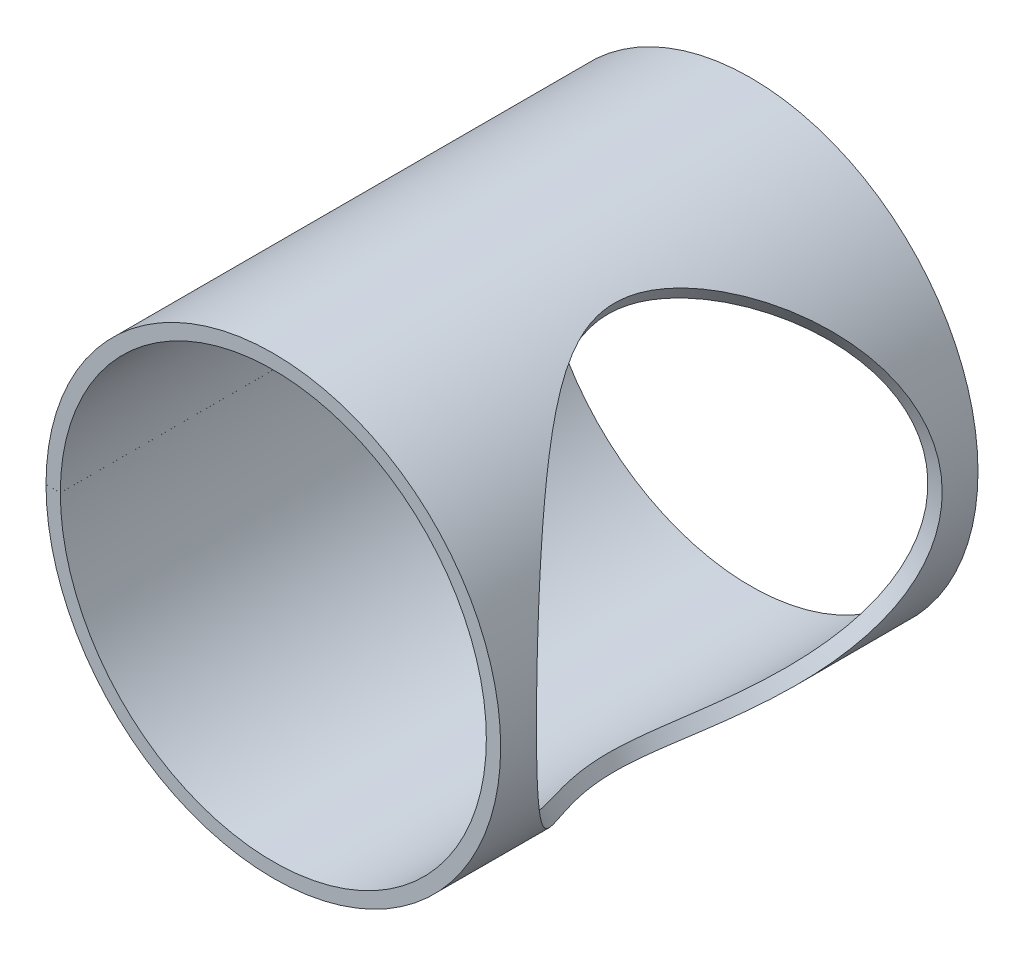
ISO-10303-21;
HEADER;
FILE_DESCRIPTION(('STEP AP214'),'2;1');
FILE_NAME('part.step','',(''),(''),'','','');
FILE_SCHEMA(('AUTOMOTIVE_DESIGN { 1 0 10303 214 1 1 1 1 }'));
ENDSEC;
DATA;
#1=APPLICATION_CONTEXT('core data for automotive mechanical design processes');
#2=APPLICATION_PROTOCOL_DEFINITION('international standard','automotive_design',2000,#1);
#3=PRODUCT_CONTEXT('',#1,'mechanical');
#4=PRODUCT('Part','Part','',(#3));
#5=PRODUCT_RELATED_PRODUCT_CATEGORY('part','',(#4));
#6=PRODUCT_DEFINITION_FORMATION('','',#4);
#7=PRODUCT_DEFINITION_CONTEXT('part definition',#1,'design');
#8=PRODUCT_DEFINITION('design','',#6,#7);
#9=PRODUCT_DEFINITION_SHAPE('','',#8);
#10=(LENGTH_UNIT() NAMED_UNIT(*) SI_UNIT(.MILLI.,.METRE.));
#11=(NAMED_UNIT(*) PLANE_ANGLE_UNIT() SI_UNIT($,.RADIAN.));
#12=(NAMED_UNIT(*) SI_UNIT($,.STERADIAN.) SOLID_ANGLE_UNIT());
#13=UNCERTAINTY_MEASURE_WITH_UNIT(LENGTH_MEASURE(1.E-05),#10,'distance_accuracy_value','');
#14=(GEOMETRIC_REPRESENTATION_CONTEXT(3) GLOBAL_UNCERTAINTY_ASSIGNED_CONTEXT((#13)) GLOBAL_UNIT_ASSIGNED_CONTEXT((#10,
#11,#12)) REPRESENTATION_CONTEXT('',''));
#15=CARTESIAN_POINT('',(0.,0.,0.));
#16=DIRECTION('',(0.,0.,1.));
#17=DIRECTION('',(1.,0.,0.));
#18=AXIS2_PLACEMENT_3D('',#15,#16,#17);
#19=CARTESIAN_POINT('',(0.,1.91062951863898E-11,60.));
#20=DIRECTION('',(0.,-1.59343427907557E-13,-1.));
#21=DIRECTION('',(0.,1.,-1.59343427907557E-13));
#22=AXIS2_PLACEMENT_3D('',#19,#20,#21);
#23=PLANE('',#22);
#24=DIRECTION('',(-0.999999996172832,8.74890631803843E-05,0.));
#25=VECTOR('',#24,1.);
#26=CARTESIAN_POINT('',(-55.3499997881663,0.00484251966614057,60.));
#27=LINE('',#26,#25);
#28=CARTESIAN_POINT('',(-53.5499997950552,0.0046850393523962,60.));
#29=VERTEX_POINT('',#28);
#30=CARTESIAN_POINT('',(-57.1499997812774,0.00499999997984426,60.));
#31=VERTEX_POINT('',#30);
#32=EDGE_CURVE('E13',#29,#31,#27,.T.);
#33=ORIENTED_EDGE('',*,*,#32,.F.);
#34=CARTESIAN_POINT('',(0.,1.91062951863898E-11,60.));
#35=DIRECTION('',(0.,-1.59363263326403E-13,-1.));
#36=DIRECTION('',(0.,1.,-1.59363263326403E-13));
#37=AXIS2_PLACEMENT_3D('',#34,#35,#36);
#38=CIRCLE('',#37,53.55);
#39=CARTESIAN_POINT('',(-53.5499997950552,-0.00468503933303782,60.));
#40=VERTEX_POINT('',#39);
#41=EDGE_CURVE('E159',#40,#29,#38,.F.);
#42=ORIENTED_EDGE('',*,*,#41,.F.);
#43=DIRECTION('',(-0.999999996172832,-8.74890635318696E-05,0.));
#44=VECTOR('',#43,1.);
#45=CARTESIAN_POINT('',(-55.3499997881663,-0.00484251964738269,60.));
#46=LINE('',#45,#44);
#47=CARTESIAN_POINT('',(-57.1499997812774,-0.00499999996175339,60.));
#48=VERTEX_POINT('',#47);
#49=EDGE_CURVE('E52',#40,#48,#46,.T.);
#50=ORIENTED_EDGE('',*,*,#49,.T.);
#51=CARTESIAN_POINT('',(0.,1.91062951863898E-11,60.));
#52=DIRECTION('',(0.,-1.59363263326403E-13,-1.));
#53=DIRECTION('',(0.,1.,-1.59363263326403E-13));
#54=AXIS2_PLACEMENT_3D('',#51,#52,#53);
#55=CIRCLE('',#54,57.15);
#56=EDGE_CURVE('E98',#48,#31,#55,.F.);
#57=ORIENTED_EDGE('',*,*,#56,.T.);
#58=EDGE_LOOP('',(#33,#42,#50,#57));
#59=FACE_BOUND('',#58,.T.);
#60=ADVANCED_FACE('F42',(#59),#23,.F.);
#61=CARTESIAN_POINT('',(-55.3499997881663,-0.00484251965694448,0.));
#62=DIRECTION('',(8.74890635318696E-05,-0.999999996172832,1.59363262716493E-13));
#63=DIRECTION('',(0.,1.59363263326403E-13,1.));
#64=AXIS2_PLACEMENT_3D('',#61,#62,#63);
#65=PLANE('',#64);
#66=ORIENTED_EDGE('',*,*,#49,.F.);
#67=DIRECTION('',(0.,-1.59363263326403E-13,-1.));
#68=VECTOR('',#67,1.);
#69=CARTESIAN_POINT('',(-53.5499997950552,-0.00468503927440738,427.904376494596));
#70=LINE('',#69,#68);
#71=CARTESIAN_POINT('',(-53.5499997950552,-0.00468503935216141,-60.));
#72=VERTEX_POINT('',#71);
#73=EDGE_CURVE('E86',#72,#40,#70,.F.);
#74=ORIENTED_EDGE('',*,*,#73,.F.);
#75=DIRECTION('',(-0.999999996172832,-8.74890635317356E-05,0.));
#76=VECTOR('',#75,1.);
#77=CARTESIAN_POINT('',(-55.3499997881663,-0.00484251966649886,-60.));
#78=LINE('',#77,#76);
#79=CARTESIAN_POINT('',(-57.1499997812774,-0.00499999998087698,-60.));
#80=VERTEX_POINT('',#79);
#81=EDGE_CURVE('E81',#72,#80,#78,.T.);
#82=ORIENTED_EDGE('',*,*,#81,.T.);
#83=DIRECTION('',(0.,-1.59363263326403E-13,-1.));
#84=VECTOR('',#83,1.);
#85=CARTESIAN_POINT('',(-57.1499997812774,-0.00499999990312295,427.904376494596));
#86=LINE('',#85,#84);
#87=EDGE_CURVE('E84',#80,#48,#86,.F.);
#88=ORIENTED_EDGE('',*,*,#87,.T.);
#89=EDGE_LOOP('',(#66,#74,#82,#88));
#90=FACE_BOUND('',#89,.T.);
#91=ADVANCED_FACE('F83',(#90),#65,.F.);
#92=CARTESIAN_POINT('',(0.,0.,-60.));
#93=DIRECTION('',(0.,-1.59363380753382E-13,-1.));
#94=DIRECTION('',(0.,1.,-1.59363380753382E-13));
#95=AXIS2_PLACEMENT_3D('',#92,#93,#94);
#96=PLANE('',#95);
#97=ORIENTED_EDGE('',*,*,#81,.F.);
#98=CARTESIAN_POINT('',(0.,0.,-60.));
#99=DIRECTION('',(0.,-1.59363263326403E-13,-1.));
#100=DIRECTION('',(0.,1.,-1.59363263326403E-13));
#101=AXIS2_PLACEMENT_3D('',#98,#99,#100);
#102=CIRCLE('',#101,53.55);
#103=CARTESIAN_POINT('',(-53.5499997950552,0.0046850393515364,-60.));
#104=VERTEX_POINT('',#103);
#105=EDGE_CURVE('E115',#72,#104,#102,.F.);
#106=ORIENTED_EDGE('',*,*,#105,.T.);
#107=DIRECTION('',(-0.999999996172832,8.74890635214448E-05,0.));
#108=VECTOR('',#107,1.);
#109=CARTESIAN_POINT('',(-55.3499997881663,0.00484251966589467,-60.));
#110=LINE('',#109,#108);
#111=CARTESIAN_POINT('',(-57.1499997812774,0.00499999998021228,-60.));
#112=VERTEX_POINT('',#111);
#113=EDGE_CURVE('E46',#104,#112,#110,.T.);
#114=ORIENTED_EDGE('',*,*,#113,.T.);
#115=CARTESIAN_POINT('',(0.,0.,-60.));
#116=DIRECTION('',(0.,-1.59363263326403E-13,-1.));
#117=DIRECTION('',(0.,1.,-1.59363263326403E-13));
#118=AXIS2_PLACEMENT_3D('',#115,#116,#117);
#119=CIRCLE('',#118,57.15);
#120=EDGE_CURVE('E97',#80,#112,#119,.F.);
#121=ORIENTED_EDGE('',*,*,#120,.F.);
#122=EDGE_LOOP('',(#97,#106,#114,#121));
#123=FACE_BOUND('',#122,.T.);
#124=ADVANCED_FACE('F100',(#123),#96,.T.);
#125=CARTESIAN_POINT('',(-55.3499997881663,0.00484251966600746,0.));
#126=DIRECTION('',(-8.74890633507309E-05,-0.999999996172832,0.));
#127=DIRECTION('',(0.,0.,1.));
#128=AXIS2_PLACEMENT_3D('',#125,#126,#127);
#129=PLANE('',#128);
#130=DIRECTION('',(0.,-1.59363263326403E-13,-1.));
#131=VECTOR('',#130,1.);
#132=CARTESIAN_POINT('',(-53.5499997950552,0.00468503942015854,427.904376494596));
#133=LINE('',#132,#131);
#134=EDGE_CURVE('E105',#104,#29,#133,.F.);
#135=ORIENTED_EDGE('',*,*,#134,.T.);
#136=ORIENTED_EDGE('',*,*,#32,.T.);
#137=DIRECTION('',(0.,-1.59363263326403E-13,-1.));
#138=VECTOR('',#137,1.);
#139=CARTESIAN_POINT('',(-57.1499997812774,0.00500000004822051,427.904376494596));
#140=LINE('',#139,#138);
#141=EDGE_CURVE('E108',#112,#31,#140,.F.);
#142=ORIENTED_EDGE('',*,*,#141,.F.);
#143=ORIENTED_EDGE('',*,*,#113,.F.);
#144=EDGE_LOOP('',(#135,#136,#142,#143));
#145=FACE_BOUND('',#144,.T.);
#146=ADVANCED_FACE('F44',(#145),#129,.T.);
#147=CARTESIAN_POINT('',(57.15,-4.45607092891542E-13,51.));
#148=CARTESIAN_POINT('',(57.1499999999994,-1.82869008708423,51.0000047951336));
#149=CARTESIAN_POINT('',(57.0621600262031,-3.66451414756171,50.9004869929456));
#150=CARTESIAN_POINT('',(56.8626750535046,-5.72815437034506,50.6765665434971));
#151=CARTESIAN_POINT('',(56.8391129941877,-5.95742419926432,50.6501314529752));
#152=CARTESIAN_POINT('',(56.7891901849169,-6.41588241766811,50.5941511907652));
#153=CARTESIAN_POINT('',(56.7635401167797,-6.63885129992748,50.5653994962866));
#154=CARTESIAN_POINT('',(56.6819068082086,-7.31363611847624,50.4738937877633));
#155=CARTESIAN_POINT('',(56.6221678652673,-7.76256588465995,50.40693609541));
#156=CARTESIAN_POINT('',(56.4271111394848,-9.10620227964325,50.1882013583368));
#157=CARTESIAN_POINT('',(56.2759506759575,-9.99775455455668,50.0185626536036));
#158=CARTESIAN_POINT('',(56.0180181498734,-11.3273098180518,49.7283812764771));
#159=CARTESIAN_POINT('',(55.9268427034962,-11.7691997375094,49.6257002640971));
#160=CARTESIAN_POINT('',(55.7823503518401,-12.429912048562,49.4627479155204));
#161=CARTESIAN_POINT('',(55.7348966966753,-12.6408484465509,49.4091983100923));
#162=CARTESIAN_POINT('',(55.637116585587,-13.0644945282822,49.2988320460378));
#163=CARTESIAN_POINT('',(55.587014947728,-13.276051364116,49.2422627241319));
#164=CARTESIAN_POINT('',(55.3304629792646,-14.3324351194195,48.9524851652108));
#165=CARTESIAN_POINT('',(55.1058781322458,-15.1730601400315,48.6984840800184));
#166=CARTESIAN_POINT('',(54.6184346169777,-16.8435791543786,48.1461238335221));
#167=CARTESIAN_POINT('',(54.3555759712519,-17.6734730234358,47.8477646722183));
#168=CARTESIAN_POINT('',(53.932952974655,-18.9089537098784,47.3669573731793));
#169=CARTESIAN_POINT('',(53.7873567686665,-19.3192207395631,47.2011435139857));
#170=CARTESIAN_POINT('',(53.5619315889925,-19.9321190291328,46.9441055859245));
#171=CARTESIAN_POINT('',(53.4856180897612,-20.1360014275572,46.8570400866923));
#172=CARTESIAN_POINT('',(53.3693970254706,-20.4411792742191,46.7243625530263));
#173=CARTESIAN_POINT('',(53.3303648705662,-20.5427975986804,46.6797901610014));
#174=CARTESIAN_POINT('',(53.2713798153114,-20.6950611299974,46.6124117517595));
#175=CARTESIAN_POINT('',(53.2516453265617,-20.745788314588,46.5898656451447));
#176=CARTESIAN_POINT('',(53.2120308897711,-20.8471876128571,46.5446001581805));
#177=CARTESIAN_POINT('',(53.1908864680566,-20.9010692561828,46.5204354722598));
#178=CARTESIAN_POINT('',(52.5741781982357,-22.4664189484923,45.8155319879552));
#179=CARTESIAN_POINT('',(51.9123652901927,-23.9555527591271,45.0555853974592));
#180=CARTESIAN_POINT('',(50.82876463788,-26.1384602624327,43.8010597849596));
#181=CARTESIAN_POINT('',(50.4524238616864,-26.8576358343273,43.3637836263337));
#182=CARTESIAN_POINT('',(49.8658574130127,-27.9228053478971,42.6792179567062));
#183=CARTESIAN_POINT('',(49.6666597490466,-28.2755965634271,42.4462541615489));
#184=CARTESIAN_POINT('',(49.3624351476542,-28.8012757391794,42.0896456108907));
#185=CARTESIAN_POINT('',(49.2601222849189,-28.9759175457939,41.9695822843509));
#186=CARTESIAN_POINT('',(49.1053068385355,-29.2369898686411,41.7876965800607));
#187=CARTESIAN_POINT('',(49.0534773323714,-29.3238655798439,41.7267695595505));
#188=CARTESIAN_POINT('',(48.9753979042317,-29.4539548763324,41.6349313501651));
#189=CARTESIAN_POINT('',(48.9493155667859,-29.497280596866,41.6042440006));
#190=CARTESIAN_POINT('',(48.8970393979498,-29.5838570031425,41.542720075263));
#191=CARTESIAN_POINT('',(48.8692691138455,-29.6297029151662,41.5100270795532));
#192=CARTESIAN_POINT('',(48.0550597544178,-30.9700904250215,40.5512197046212));
#193=CARTESIAN_POINT('',(47.2219593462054,-32.2246098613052,39.5622913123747));
#194=CARTESIAN_POINT('',(45.9155937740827,-34.0357878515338,37.9901350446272));
#195=CARTESIAN_POINT('',(45.4706847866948,-34.6277573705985,37.451289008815));
#196=CARTESIAN_POINT('',(44.7902038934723,-35.4978266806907,36.6208290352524));
#197=CARTESIAN_POINT('',(44.5611905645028,-35.7848695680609,36.3403105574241));
#198=CARTESIAN_POINT('',(44.2145226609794,-36.2109377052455,35.9139851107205));
#199=CARTESIAN_POINT('',(44.0984420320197,-36.3522110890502,35.7709520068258));
#200=CARTESIAN_POINT('',(43.9235504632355,-36.5629942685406,35.5550154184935));
#201=CARTESIAN_POINT('',(43.8651248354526,-36.6330675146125,35.482805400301));
#202=CARTESIAN_POINT('',(43.7480194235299,-36.7728379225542,35.3379230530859));
#203=CARTESIAN_POINT('',(43.687668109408,-36.8445108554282,35.2631784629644));
#204=CARTESIAN_POINT('',(43.1734623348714,-37.4523090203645,34.6256974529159));
#205=CARTESIAN_POINT('',(42.7114483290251,-37.9780650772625,34.0481933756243));
#206=CARTESIAN_POINT('',(41.7794638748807,-39.0009954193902,32.8714766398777));
#207=CARTESIAN_POINT('',(41.3110451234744,-39.4965851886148,32.2742651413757));
#208=CARTESIAN_POINT('',(40.3618843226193,-40.4660473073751,31.0501289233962));
#209=CARTESIAN_POINT('',(39.886952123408,-40.9338761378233,30.4305935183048));
#210=CARTESIAN_POINT('',(39.1757691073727,-41.6111617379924,29.4900894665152));
#211=CARTESIAN_POINT('',(38.9389093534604,-41.8328479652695,29.1747212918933));
#212=CARTESIAN_POINT('',(38.5841279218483,-42.1593809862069,28.6988687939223));
#213=CARTESIAN_POINT('',(38.4659520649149,-42.2672259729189,28.5397845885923));
#214=CARTESIAN_POINT('',(38.2888402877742,-42.4275093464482,28.3004582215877));
#215=CARTESIAN_POINT('',(38.229828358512,-42.4806897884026,28.2205660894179));
#216=CARTESIAN_POINT('',(38.111859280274,-42.5865584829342,28.0605484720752));
#217=CARTESIAN_POINT('',(38.0543868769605,-42.6379253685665,27.9824447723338));
#218=CARTESIAN_POINT('',(37.5106747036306,-43.1218084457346,27.2420692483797));
#219=CARTESIAN_POINT('',(37.032648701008,-43.5325350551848,26.5804767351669));
#220=CARTESIAN_POINT('',(36.3255456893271,-44.121097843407,25.5828665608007));
#221=CARTESIAN_POINT('',(36.0914985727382,-44.3126978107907,25.2494596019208));
#222=CARTESIAN_POINT('',(35.7431433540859,-44.5934125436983,24.7480438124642));
#223=CARTESIAN_POINT('',(35.6274773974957,-44.6858699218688,24.5806876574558));
#224=CARTESIAN_POINT('',(35.4546853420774,-44.8229092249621,24.3293270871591));
#225=CARTESIAN_POINT('',(35.3972057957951,-44.8683145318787,24.2454858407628));
#226=CARTESIAN_POINT('',(35.311166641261,-44.9360138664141,24.1196423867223));
#227=CARTESIAN_POINT('',(35.2825169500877,-44.9585122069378,24.0776809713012));
#228=CARTESIAN_POINT('',(35.2252781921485,-45.0033731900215,23.9937309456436));
#229=CARTESIAN_POINT('',(35.1981544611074,-45.0245918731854,23.9538974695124));
#230=CARTESIAN_POINT('',(34.6877497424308,-45.4230550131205,23.2032226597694));
#231=CARTESIAN_POINT('',(34.2193504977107,-45.7763747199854,22.4975244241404));
#232=CARTESIAN_POINT('',(33.5369617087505,-46.2760648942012,21.4402059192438));
#233=CARTESIAN_POINT('',(33.31286402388,-46.4375793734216,21.0879712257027));
#234=CARTESIAN_POINT('',(32.9820181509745,-46.6725537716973,20.5599263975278));
#235=CARTESIAN_POINT('',(32.8726194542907,-46.7496622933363,20.3839626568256));
#236=CARTESIAN_POINT('',(32.7098762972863,-46.8635346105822,20.1200938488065));
#237=CARTESIAN_POINT('',(32.655854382,-46.9011936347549,20.0321503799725));
#238=CARTESIAN_POINT('',(32.575163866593,-46.9572387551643,19.90025437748));
#239=CARTESIAN_POINT('',(32.5483240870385,-46.9758465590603,19.8562922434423));
#240=CARTESIAN_POINT('',(32.5081504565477,-47.0036479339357,19.7903538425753));
#241=CARTESIAN_POINT('',(32.4947735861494,-47.0128966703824,19.7683751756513));
#242=CARTESIAN_POINT('',(32.4680485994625,-47.031357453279,19.7244194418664));
#243=CARTESIAN_POINT('',(32.4565524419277,-47.0392925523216,19.7054947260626));
#244=CARTESIAN_POINT('',(31.4694844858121,-47.7198875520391,18.078634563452));
#245=CARTESIAN_POINT('',(30.5888450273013,-48.283249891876,16.504336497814));
#246=CARTESIAN_POINT('',(29.4249522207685,-48.994912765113,14.1841896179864));
#247=CARTESIAN_POINT('',(29.0630835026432,-49.209850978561,13.4176906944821));
#248=CARTESIAN_POINT('',(28.5612812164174,-49.5016479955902,12.278267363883));
#249=CARTESIAN_POINT('',(28.4008430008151,-49.5938079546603,11.9001804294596));
#250=CARTESIAN_POINT('',(28.1706253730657,-49.7247037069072,11.3356312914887));
#251=CARTESIAN_POINT('',(28.0956258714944,-49.7671113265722,11.147878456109));
#252=CARTESIAN_POINT('',(27.9857585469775,-49.8289231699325,10.8668945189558));
#253=CARTESIAN_POINT('',(27.9495747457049,-49.8492271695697,10.7733407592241));
#254=CARTESIAN_POINT('',(27.8959596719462,-49.8792376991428,10.6331714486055));
#255=CARTESIAN_POINT('',(27.8781980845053,-49.8891669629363,10.5864752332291));
#256=CARTESIAN_POINT('',(27.8517211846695,-49.9039500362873,10.5164712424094));
#257=CARTESIAN_POINT('',(27.8429231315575,-49.9088592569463,10.4931433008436));
#258=CARTESIAN_POINT('',(27.8297674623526,-49.9161954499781,10.458161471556));
#259=CARTESIAN_POINT('',(27.8253891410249,-49.918636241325,10.4465025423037));
#260=CARTESIAN_POINT('',(27.816646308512,-49.9235086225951,10.4231880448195));
#261=CARTESIAN_POINT('',(27.8129884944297,-49.9255466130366,10.4134224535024));
#262=CARTESIAN_POINT('',(27.4838090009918,-50.1088852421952,9.53307125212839));
#263=CARTESIAN_POINT('',(27.1979007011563,-50.2640513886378,8.67538256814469));
#264=CARTESIAN_POINT('',(26.8280936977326,-50.4618215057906,7.40252752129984));
#265=CARTESIAN_POINT('',(26.714661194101,-50.5219066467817,6.98052216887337));
#266=CARTESIAN_POINT('',(26.5594334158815,-50.6035810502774,6.3509336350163));
#267=CARTESIAN_POINT('',(26.5101773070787,-50.6293964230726,6.14164070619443));
#268=CARTESIAN_POINT('',(26.4400406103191,-50.6660384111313,5.82855618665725));
#269=CARTESIAN_POINT('',(26.4172862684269,-50.6779055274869,5.72433715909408));
#270=CARTESIAN_POINT('',(26.3840936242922,-50.6951897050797,5.56822233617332));
#271=CARTESIAN_POINT('',(26.3731858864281,-50.700865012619,5.51621968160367));
#272=CARTESIAN_POINT('',(26.351683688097,-50.7120440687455,5.41228561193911));
#273=CARTESIAN_POINT('',(26.3418789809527,-50.7171378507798,5.3642808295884));
#274=CARTESIAN_POINT('',(25.9713741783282,-50.9094695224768,3.52214070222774));
#275=CARTESIAN_POINT('',(25.7901637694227,-50.9999014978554,1.74999303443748));
#276=CARTESIAN_POINT('',(25.7898779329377,-51.000046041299,-0.874997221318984));
#277=CARTESIAN_POINT('',(25.8350450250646,-50.9772812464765,-1.75486474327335));
#278=CARTESIAN_POINT('',(25.9704149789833,-50.9083746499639,-3.08197218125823));
#279=CARTESIAN_POINT('',(26.0268024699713,-50.8796012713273,-3.52555901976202));
#280=CARTESIAN_POINT('',(26.1281932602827,-50.8275659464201,-4.1927658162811));
#281=CARTESIAN_POINT('',(26.1647914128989,-50.8087409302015,-4.41547250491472));
#282=CARTESIAN_POINT('',(26.2238762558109,-50.7782562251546,-4.74998917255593));
#283=CARTESIAN_POINT('',(26.244269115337,-50.7677200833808,-4.86157083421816));
#284=CARTESIAN_POINT('',(26.2759032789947,-50.7513502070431,-5.02905748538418));
#285=CARTESIAN_POINT('',(26.2866221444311,-50.7457993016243,-5.08490539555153));
#286=CARTESIAN_POINT('',(26.302961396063,-50.7373310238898,-5.1687058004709));
#287=CARTESIAN_POINT('',(26.3084513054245,-50.7344846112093,-5.19664402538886));
#288=CARTESIAN_POINT('',(26.3195180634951,-50.7287443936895,-5.25252998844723));
#289=CARTESIAN_POINT('',(26.325498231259,-50.7256412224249,-5.28248363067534));
#290=CARTESIAN_POINT('',(26.4976584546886,-50.636271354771,-6.13872112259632));
#291=CARTESIAN_POINT('',(26.7047943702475,-50.5277608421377,-6.97815300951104));
#292=CARTESIAN_POINT('',(27.0745862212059,-50.329999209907,-8.25101231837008));
#293=CARTESIAN_POINT('',(27.2076928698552,-50.2582371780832,-8.67758400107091));
#294=CARTESIAN_POINT('',(27.4219165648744,-50.1414759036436,-9.32086939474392));
#295=CARTESIAN_POINT('',(27.4957513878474,-50.1010352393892,-9.53586917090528));
#296=CARTESIAN_POINT('',(27.6101156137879,-50.0380446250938,-9.85922580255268));
#297=CARTESIAN_POINT('',(27.6488389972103,-50.0166594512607,-9.96715417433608));
#298=CARTESIAN_POINT('',(27.7078232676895,-49.9839927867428,-10.1292609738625));
#299=CARTESIAN_POINT('',(27.7276345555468,-49.973005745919,-10.1833322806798));
#300=CARTESIAN_POINT('',(27.7575757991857,-49.956377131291,-10.2644928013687));
#301=CARTESIAN_POINT('',(27.7675935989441,-49.9508095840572,-10.2915552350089));
#302=CARTESIAN_POINT('',(27.78267631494,-49.9424211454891,-10.3321622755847));
#303=CARTESIAN_POINT('',(27.7877132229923,-49.9396188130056,-10.3457001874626));
#304=CARTESIAN_POINT('',(27.7978057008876,-49.9340017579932,-10.3727804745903));
#305=CARTESIAN_POINT('',(27.8035676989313,-49.9307935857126,-10.3882119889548));
#306=CARTESIAN_POINT('',(28.3658099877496,-49.6176491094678,-11.8917673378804));
#307=CARTESIAN_POINT('',(29.037152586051,-49.2320365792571,-13.4111002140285));
#308=CARTESIAN_POINT('',(30.2010401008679,-48.5203716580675,-15.7312490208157));
#309=CARTESIAN_POINT('',(30.6150866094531,-48.2608738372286,-16.5114902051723));
#310=CARTESIAN_POINT('',(31.2729969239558,-47.835033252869,-17.6921393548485));
#311=CARTESIAN_POINT('',(31.4984357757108,-47.6869837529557,-18.0874036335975));
#312=CARTESIAN_POINT('',(31.8454670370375,-47.4553271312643,-18.6828718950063));
#313=CARTESIAN_POINT('',(31.9626226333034,-47.3765109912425,-18.8817899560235));
#314=CARTESIAN_POINT('',(32.1405295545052,-47.2558355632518,-19.1808100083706));
#315=CARTESIAN_POINT('',(32.2001940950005,-47.2152018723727,-19.2805905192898));
#316=CARTESIAN_POINT('',(32.2902285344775,-47.1536314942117,-19.430422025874));
#317=CARTESIAN_POINT('',(32.320329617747,-47.1330047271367,-19.4803926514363));
#318=CARTESIAN_POINT('',(32.3656149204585,-47.1019087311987,-19.555388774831));
#319=CARTESIAN_POINT('',(32.3807323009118,-47.0915174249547,-19.5803941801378));
#320=CARTESIAN_POINT('',(32.4110114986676,-47.070682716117,-19.6304183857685));
#321=CARTESIAN_POINT('',(32.4280212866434,-47.0589651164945,-19.6584829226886));
#322=CARTESIAN_POINT('',(32.8681094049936,-46.7555192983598,-20.3838150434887));
#323=CARTESIAN_POINT('',(33.3095984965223,-46.4425567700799,-21.0879306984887));
#324=CARTESIAN_POINT('',(33.991986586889,-45.9428648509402,-22.1452491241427));
#325=CARTESIAN_POINT('',(34.222805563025,-45.771258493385,-22.4978794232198));
#326=CARTESIAN_POINT('',(34.5737984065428,-45.50600476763,-23.027111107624));
#327=CARTESIAN_POINT('',(34.6915898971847,-45.4162794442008,-23.2035693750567));
#328=CARTESIAN_POINT('',(34.8694324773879,-45.2796948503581,-23.468328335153));
#329=CARTESIAN_POINT('',(34.9289058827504,-45.2338338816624,-23.556593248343));
#330=CARTESIAN_POINT('',(35.0184002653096,-45.164538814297,-23.6890085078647));
#331=CARTESIAN_POINT('',(35.0482791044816,-45.1413565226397,-23.7331499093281));
#332=CARTESIAN_POINT('',(35.1081307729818,-45.0948233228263,-23.8214386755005));
#333=CARTESIAN_POINT('',(35.139561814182,-45.0703340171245,-23.8677306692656));
#334=CARTESIAN_POINT('',(35.625102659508,-44.6912817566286,-24.5818278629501));
#335=CARTESIAN_POINT('',(36.0899022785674,-44.3172385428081,-25.2504102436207));
#336=CARTESIAN_POINT('',(36.7970048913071,-43.7286745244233,-26.2480201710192));
#337=CARTESIAN_POINT('',(37.0343543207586,-43.5279032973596,-26.5796795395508));
#338=CARTESIAN_POINT('',(37.3926047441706,-43.2196763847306,-27.0758526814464));
#339=CARTESIAN_POINT('',(37.5123924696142,-43.1157557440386,-27.2410244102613));
#340=CARTESIAN_POINT('',(37.6925984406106,-42.9580829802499,-27.4884530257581));
#341=CARTESIAN_POINT('',(37.7527544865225,-42.90522675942,-27.5708744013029));
#342=CARTESIAN_POINT('',(37.8732359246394,-42.7989130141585,-27.7356074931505));
#343=CARTESIAN_POINT('',(37.9350424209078,-42.7441373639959,-27.819936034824));
#344=CARTESIAN_POINT('',(38.4653783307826,-42.2721587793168,-28.5420965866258));
#345=CARTESIAN_POINT('',(38.9386846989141,-41.8369453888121,-29.1765581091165));
#346=CARTESIAN_POINT('',(39.8869294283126,-40.9338982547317,-30.4305632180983));
#347=CARTESIAN_POINT('',(40.3634465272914,-40.4644515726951,-31.0521427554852));
#348=CARTESIAN_POINT('',(41.3094732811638,-39.4981907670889,-32.2722400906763));
#349=CARTESIAN_POINT('',(41.7794362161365,-39.0010250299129,-32.8714432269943));
#350=CARTESIAN_POINT('',(42.4784240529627,-38.2338289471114,-33.753979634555));
#351=CARTESIAN_POINT('',(42.7104265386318,-37.974522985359,-34.0454470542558));
#352=CARTESIAN_POINT('',(43.0567612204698,-37.5801599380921,-34.4785811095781));
#353=CARTESIAN_POINT('',(43.17192789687,-37.4478049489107,-34.6222812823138));
#354=CARTESIAN_POINT('',(43.3442378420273,-37.2479165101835,-34.8368147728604));
#355=CARTESIAN_POINT('',(43.4016011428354,-37.1810610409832,-34.9081564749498));
#356=CARTESIAN_POINT('',(43.5161772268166,-37.0468973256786,-35.050500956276));
#357=CARTESIAN_POINT('',(43.5717202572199,-36.9815627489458,-35.1194336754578));
#358=CARTESIAN_POINT('',(44.5714112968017,-35.7999150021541,-36.3587910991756));
#359=CARTESIAN_POINT('',(45.480126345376,-34.6395298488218,-37.4660698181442));
#360=CARTESIAN_POINT('',(46.7864912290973,-32.8283542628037,-39.0382249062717));
#361=CARTESIAN_POINT('',(47.2124924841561,-32.2128722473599,-39.5474827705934));
#362=CARTESIAN_POINT('',(47.8362392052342,-31.272323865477,-40.2891788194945));
#363=CARTESIAN_POINT('',(48.0416121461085,-30.9559208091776,-40.5327123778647));
#364=CARTESIAN_POINT('',(48.3457224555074,-30.4770303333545,-40.8924650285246));
#365=CARTESIAN_POINT('',(48.4464343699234,-30.3166859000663,-41.011457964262));
#366=CARTESIAN_POINT('',(48.5964980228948,-30.0751037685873,-41.1885604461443));
#367=CARTESIAN_POINT('',(48.6463518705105,-29.9943988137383,-41.2473634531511));
#368=CARTESIAN_POINT('',(48.7208794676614,-29.8730757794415,-41.3352212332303));
#369=CARTESIAN_POINT('',(48.7456798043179,-29.8325905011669,-41.3644493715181));
#370=CARTESIAN_POINT('',(48.7951957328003,-29.7515315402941,-41.4227900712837));
#371=CARTESIAN_POINT('',(48.8183352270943,-29.7135524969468,-41.4500466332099));
#372=CARTESIAN_POINT('',(49.6845568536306,-28.2875413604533,-42.4701021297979));
#373=CARTESIAN_POINT('',(50.4675388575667,-26.866144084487,-43.3828501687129));
#374=CARTESIAN_POINT('',(51.5511412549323,-24.6832383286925,-44.6373771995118));
#375=CARTESIAN_POINT('',(51.8972025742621,-23.9471405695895,-45.0364537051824));
#376=CARTESIAN_POINT('',(52.3929651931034,-22.8312366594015,-45.606419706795));
#377=CARTESIAN_POINT('',(52.5543315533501,-22.4573094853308,-45.7916335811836));
#378=CARTESIAN_POINT('',(52.7904753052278,-21.8935999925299,-46.0622922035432));
#379=CARTESIAN_POINT('',(52.868205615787,-21.7052270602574,-46.1513180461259));
#380=CARTESIAN_POINT('',(52.9833156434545,-21.4219782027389,-46.283066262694));
#381=CARTESIAN_POINT('',(53.0214380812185,-21.3274470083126,-46.3266839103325));
#382=CARTESIAN_POINT('',(53.0782492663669,-21.1854797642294,-46.3916627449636));
#383=CARTESIAN_POINT('',(53.0971242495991,-21.1381289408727,-46.4132477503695));
#384=CARTESIAN_POINT('',(53.1347498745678,-21.043370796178,-46.456268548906));
#385=CARTESIAN_POINT('',(53.1522791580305,-20.9990635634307,-46.4763083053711));
#386=CARTESIAN_POINT('',(53.8093004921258,-19.3313920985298,-47.227296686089));
#387=CARTESIAN_POINT('',(54.3724190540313,-17.6855991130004,-47.8672832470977));
#388=CARTESIAN_POINT('',(55.1027745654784,-15.1842419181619,-48.6948961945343));
#389=CARTESIAN_POINT('',(55.3271825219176,-14.345014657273,-48.9487060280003));
#390=CARTESIAN_POINT('',(55.5836150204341,-13.2902735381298,-49.2383918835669));
#391=CARTESIAN_POINT('',(55.632986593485,-13.0822016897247,-49.2941526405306));
#392=CARTESIAN_POINT('',(55.7343419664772,-12.6434300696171,-49.4085642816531));
#393=CARTESIAN_POINT('',(55.7837347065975,-12.4236945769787,-49.4642835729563));
#394=CARTESIAN_POINT('',(55.9280423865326,-11.7634839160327,-49.626981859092));
#395=CARTESIAN_POINT('',(56.0190866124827,-11.3220044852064,-49.7295012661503));
#396=CARTESIAN_POINT('',(56.2766172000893,-9.99391106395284,-50.0192211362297));
#397=CARTESIAN_POINT('',(56.4274986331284,-9.10364077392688,-50.1885832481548));
#398=CARTESIAN_POINT('',(56.6221851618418,-7.76239279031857,-50.4069497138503));
#399=CARTESIAN_POINT('',(56.6818087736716,-7.31433667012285,-50.4737924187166));
#400=CARTESIAN_POINT('',(56.7904495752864,-6.41652583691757,-50.5955855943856));
#401=CARTESIAN_POINT('',(56.8407985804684,-5.95467116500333,-50.6520506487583));
#402=CARTESIAN_POINT('',(57.0622049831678,-3.66321356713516,-50.9006317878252));
#403=CARTESIAN_POINT('',(57.1499997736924,-1.82883297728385,-51.000042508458));
#404=CARTESIAN_POINT('',(57.1500002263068,1.82881883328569,-50.9999554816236));
#405=CARTESIAN_POINT('',(57.0621474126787,3.66465970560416,-50.9004266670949));
#406=CARTESIAN_POINT('',(56.8626717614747,5.72818654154,-50.6765357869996));
#407=CARTESIAN_POINT('',(56.8391110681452,5.95744194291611,-50.6501045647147));
#408=CARTESIAN_POINT('',(56.7891917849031,6.41586766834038,-50.5941332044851));
#409=CARTESIAN_POINT('',(56.7635420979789,6.63883414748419,-50.5653842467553));
#410=CARTESIAN_POINT('',(56.6819113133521,7.31360043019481,-50.4738871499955));
#411=CARTESIAN_POINT('',(56.6221739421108,7.76252122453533,-50.4069338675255));
#412=CARTESIAN_POINT('',(56.4271208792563,9.10614078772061,-50.1882083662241));
#413=CARTESIAN_POINT('',(56.2759614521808,9.99769529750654,-50.0185704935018));
#414=CARTESIAN_POINT('',(56.0180255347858,11.3272736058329,-49.7283823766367));
#415=CARTESIAN_POINT('',(55.926848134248,11.7691744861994,-49.6256977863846));
#416=CARTESIAN_POINT('',(55.782351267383,12.4299080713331,-49.4627380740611));
#417=CARTESIAN_POINT('',(55.734895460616,12.6408540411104,-49.4091853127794));
#418=CARTESIAN_POINT('',(55.6371114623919,13.0645164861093,-49.2988137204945));
#419=CARTESIAN_POINT('',(55.5870079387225,13.2760808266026,-49.2422419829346));
#420=CARTESIAN_POINT('',(55.3304469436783,14.3324987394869,-48.9524535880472));
#421=CARTESIAN_POINT('',(55.105856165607,15.1731403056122,-48.6984478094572));
#422=CARTESIAN_POINT('',(54.6184062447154,16.8436715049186,-48.1460861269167));
#423=CARTESIAN_POINT('',(54.3555471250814,17.6735610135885,-47.8477302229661));
#424=CARTESIAN_POINT('',(53.9329296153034,18.9090201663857,-47.3669337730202));
#425=CARTESIAN_POINT('',(53.7873362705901,19.3192775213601,-47.2011245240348));
#426=CARTESIAN_POINT('',(53.5619171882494,19.9321576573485,-46.9440950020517));
#427=CARTESIAN_POINT('',(53.48560602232,20.1360333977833,-46.8570325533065));
#428=CARTESIAN_POINT('',(53.3693889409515,20.4412003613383,-46.7243599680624));
#429=CARTESIAN_POINT('',(53.3303581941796,20.5428149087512,-46.6797892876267));
#430=CARTESIAN_POINT('',(53.2713753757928,20.6950725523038,-46.6124135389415));
#431=CARTESIAN_POINT('',(53.2516416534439,20.7457977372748,-46.5898683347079));
#432=CARTESIAN_POINT('',(53.2120287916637,20.847192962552,-46.5446046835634));
#433=CARTESIAN_POINT('',(53.190885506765,20.901071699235,-46.5204413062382));
#434=CARTESIAN_POINT('',(52.5741937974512,22.466379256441,-45.8155567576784));
#435=CARTESIAN_POINT('',(51.9123924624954,23.9554938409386,-45.0556187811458));
#436=CARTESIAN_POINT('',(50.8287946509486,26.1384018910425,-43.8010914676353));
#437=CARTESIAN_POINT('',(50.452452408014,26.8575825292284,-43.3638123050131));
#438=CARTESIAN_POINT('',(49.8658792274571,27.922766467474,-42.679238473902));
#439=CARTESIAN_POINT('',(49.6666785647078,28.2755636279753,-42.446271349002));
#440=CARTESIAN_POINT('',(49.3624482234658,28.801253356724,-42.0896568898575));
#441=CARTESIAN_POINT('',(49.2601332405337,28.9758989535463,-41.9695914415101));
#442=CARTESIAN_POINT('',(49.1053142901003,29.2369773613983,-41.7877023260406));
#443=CARTESIAN_POINT('',(49.0534835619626,29.3238551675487,-41.7267741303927));
#444=CARTESIAN_POINT('',(48.9754022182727,29.4539477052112,-41.6349341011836));
#445=CARTESIAN_POINT('',(48.9493192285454,29.4972745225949,-41.6042461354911));
#446=CARTESIAN_POINT('',(48.8970417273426,29.5838531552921,-41.5427209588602));
#447=CARTESIAN_POINT('',(48.8692695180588,29.6297022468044,-41.5100258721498));
#448=CARTESIAN_POINT('',(48.0550783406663,30.9700599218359,-40.5512452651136));
#449=CARTESIAN_POINT('',(47.2219889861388,32.2245664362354,-39.5623299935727));
#450=CARTESIAN_POINT('',(45.915624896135,34.0357458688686,-37.990174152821));
#451=CARTESIAN_POINT('',(45.4707138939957,34.6277193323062,-37.4513250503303));
#452=CARTESIAN_POINT('',(44.7902256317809,35.4977992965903,-36.6208556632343));
#453=CARTESIAN_POINT('',(44.5612091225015,35.784846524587,-36.3403332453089));
#454=CARTESIAN_POINT('',(44.2145352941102,36.2109222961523,-35.9140006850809));
#455=CARTESIAN_POINT('',(44.0984524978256,36.3521984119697,-35.7709650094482));
#456=CARTESIAN_POINT('',(43.923557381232,36.562985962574,-35.5550242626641));
#457=CARTESIAN_POINT('',(43.8651305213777,36.6330607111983,-35.4828128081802));
#458=CARTESIAN_POINT('',(43.748022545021,36.7728342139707,-35.3379274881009));
#459=CARTESIAN_POINT('',(43.6876654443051,36.8445140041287,-35.2631758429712));
#460=CARTESIAN_POINT('',(43.1734873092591,37.4522795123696,-34.6257302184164));
#461=CARTESIAN_POINT('',(42.7114866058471,37.9780220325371,-34.0482419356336));
#462=CARTESIAN_POINT('',(41.7795029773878,39.0009535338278,-32.8715254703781));
#463=CARTESIAN_POINT('',(41.3110038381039,39.49662736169,-32.2742108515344));
#464=CARTESIAN_POINT('',(40.3619252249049,40.4660055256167,-31.0501874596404));
#465=CARTESIAN_POINT('',(39.8870150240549,40.9338148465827,-30.4306802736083));
#466=CARTESIAN_POINT('',(39.1758329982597,41.6111015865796,-29.4901762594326));
#467=CARTESIAN_POINT('',(38.9389682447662,41.8327932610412,-29.1748010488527));
#468=CARTESIAN_POINT('',(38.5841709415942,42.1593416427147,-28.698927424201));
#469=CARTESIAN_POINT('',(38.4659883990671,42.2671929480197,-28.5398344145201));
#470=CARTESIAN_POINT('',(38.2888644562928,42.4274875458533,-28.3004921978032));
#471=CARTESIAN_POINT('',(38.2298481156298,42.4806720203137,-28.2205943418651));
#472=CARTESIAN_POINT('',(38.1118694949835,42.5865493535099,-28.0605643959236));
#473=CARTESIAN_POINT('',(38.0543806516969,42.6379309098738,-27.9824386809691));
#474=CARTESIAN_POINT('',(37.5107208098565,43.1217674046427,-27.2421384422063));
#475=CARTESIAN_POINT('',(37.0327193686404,43.5324749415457,-26.5805794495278));
#476=CARTESIAN_POINT('',(36.3256170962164,44.1210390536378,-25.5829694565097));
#477=CARTESIAN_POINT('',(36.0915642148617,44.3126444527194,-25.2495542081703));
#478=CARTESIAN_POINT('',(35.743190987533,44.5933743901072,-24.748113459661));
#479=CARTESIAN_POINT('',(35.6275174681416,44.6858380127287,-24.5807468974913));
#480=CARTESIAN_POINT('',(35.454711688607,44.8228883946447,-24.3293675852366));
#481=CARTESIAN_POINT('',(35.3972271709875,44.8682976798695,-24.2455195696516));
#482=CARTESIAN_POINT('',(35.3111799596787,44.9360034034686,-24.1196651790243));
#483=CARTESIAN_POINT('',(35.2825274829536,44.9585039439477,-24.0776999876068));
#484=CARTESIAN_POINT('',(35.2252829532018,45.0033694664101,-23.9937421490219));
#485=CARTESIAN_POINT('',(35.1981492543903,45.0245959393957,-23.9538943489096));
#486=CARTESIAN_POINT('',(34.6878107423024,45.4230073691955,-23.2033235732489));
#487=CARTESIAN_POINT('',(34.21944397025,45.7763048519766,-22.4976744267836));
#488=CARTESIAN_POINT('',(33.5370556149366,46.2759968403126,-21.4403563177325));
#489=CARTESIAN_POINT('',(33.3129500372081,46.4375177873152,-21.0881095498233));
#490=CARTESIAN_POINT('',(32.9820799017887,46.6725101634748,-20.5600283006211));
#491=CARTESIAN_POINT('',(32.8726710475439,46.7496260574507,-20.3840493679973));
#492=CARTESIAN_POINT('',(32.7099095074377,46.8635114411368,-20.1201531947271));
#493=CARTESIAN_POINT('',(32.6558809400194,46.9011751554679,-20.0321998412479));
#494=CARTESIAN_POINT('',(32.5751796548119,46.9572278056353,-19.9002878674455));
#495=CARTESIAN_POINT('',(32.5483361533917,46.9758382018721,-19.8563202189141));
#496=CARTESIAN_POINT('',(32.5081567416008,47.003643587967,-19.7903732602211));
#497=CARTESIAN_POINT('',(32.4947779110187,47.0128936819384,-19.7683916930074));
#498=CARTESIAN_POINT('',(32.4680489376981,47.0313572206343,-19.7244300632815));
#499=CARTESIAN_POINT('',(32.4565471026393,47.0392962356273,-19.7054962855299));
#500=CARTESIAN_POINT('',(31.4695825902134,47.7198197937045,-18.0788326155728));
#501=CARTESIAN_POINT('',(30.5889988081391,48.2831524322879,-16.5046307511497));
#502=CARTESIAN_POINT('',(29.4251106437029,48.994817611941,-14.1844822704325));
#503=CARTESIAN_POINT('',(29.0632303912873,49.2097644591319,-13.4179584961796));
#504=CARTESIAN_POINT('',(28.5613904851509,49.5015850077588,-12.2784614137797));
#505=CARTESIAN_POINT('',(28.4009363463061,49.5937545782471,-11.9003438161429));
#506=CARTESIAN_POINT('',(28.1706896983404,49.7246672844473,-11.3357395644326));
#507=CARTESIAN_POINT('',(28.0956796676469,49.7670809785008,-11.1479668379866));
#508=CARTESIAN_POINT('',(27.985795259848,49.8289025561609,-10.8669507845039));
#509=CARTESIAN_POINT('',(27.9496055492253,49.8492099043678,-10.773385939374));
#510=CARTESIAN_POINT('',(27.8959812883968,49.8792256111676,-10.6331994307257));
#511=CARTESIAN_POINT('',(27.8782165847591,49.8891566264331,-10.5864973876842));
#512=CARTESIAN_POINT('',(27.8517349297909,49.9039423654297,-10.5164845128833));
#513=CARTESIAN_POINT('',(27.842935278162,49.9088524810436,-10.4931535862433));
#514=CARTESIAN_POINT('',(27.8297771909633,49.9161900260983,-10.4581672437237));
#515=CARTESIAN_POINT('',(27.8253980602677,49.9186312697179,-10.4465068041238));
#516=CARTESIAN_POINT('',(27.8166536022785,49.9235045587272,-10.423189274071));
#517=CARTESIAN_POINT('',(27.8129942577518,49.9255434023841,-10.4134201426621));
#518=CARTESIAN_POINT('',(27.4838079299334,50.1088858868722,-9.53310077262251));
#519=CARTESIAN_POINT('',(27.197900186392,50.26405161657,-8.67542688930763));
#520=CARTESIAN_POINT('',(26.8281052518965,50.4618153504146,-7.40256923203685));
#521=CARTESIAN_POINT('',(26.7146786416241,50.5218974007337,-6.98055887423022));
#522=CARTESIAN_POINT('',(26.559462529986,50.6035657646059,-6.35095662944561));
#523=CARTESIAN_POINT('',(26.5102107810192,50.6293788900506,-6.14165809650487));
#524=CARTESIAN_POINT('',(26.4400813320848,50.6660171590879,-5.82856362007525));
#525=CARTESIAN_POINT('',(26.4173295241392,50.6778829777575,-5.72434101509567));
#526=CARTESIAN_POINT('',(26.3841408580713,50.6951651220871,-5.56822043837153));
#527=CARTESIAN_POINT('',(26.3732344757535,50.7008397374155,-5.51621580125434));
#528=CARTESIAN_POINT('',(26.3517350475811,50.7120173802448,-5.41227763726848));
#529=CARTESIAN_POINT('',(26.3419425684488,50.717104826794,-5.36432522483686));
#530=CARTESIAN_POINT('',(25.9711285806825,50.9095975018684,-3.52031538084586));
#531=CARTESIAN_POINT('',(25.7898980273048,51.0000358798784,-1.75161700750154));
#532=CARTESIAN_POINT('',(25.7900077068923,50.9999804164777,0.875795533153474));
#533=CARTESIAN_POINT('',(25.8352370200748,50.9771839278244,1.75606859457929));
#534=CARTESIAN_POINT('',(25.9705959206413,50.908282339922,3.08318150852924));
#535=CARTESIAN_POINT('',(26.0269623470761,50.8795194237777,3.52666970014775));
#536=CARTESIAN_POINT('',(26.1282956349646,50.8275133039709,4.19357781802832));
#537=CARTESIAN_POINT('',(26.1648703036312,50.8087002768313,4.416159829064));
#538=CARTESIAN_POINT('',(26.2239134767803,50.778236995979,4.75045180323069));
#539=CARTESIAN_POINT('',(26.2442913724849,50.7677085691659,4.86195228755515));
#540=CARTESIAN_POINT('',(26.2759014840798,50.751351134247,5.02930775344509));
#541=CARTESIAN_POINT('',(26.2866120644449,50.7458045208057,5.08511036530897));
#542=CARTESIAN_POINT('',(26.3083806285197,50.7345223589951,5.19675050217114));
#543=CARTESIAN_POINT('',(26.3202363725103,50.7283726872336,5.25655533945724));
#544=CARTESIAN_POINT('',(26.4976100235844,50.6362966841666,6.13864571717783));
#545=CARTESIAN_POINT('',(26.7047478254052,50.5277854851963,6.97803266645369));
#546=CARTESIAN_POINT('',(27.0745501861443,50.3300186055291,8.25088945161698));
#547=CARTESIAN_POINT('',(27.2076616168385,50.2582541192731,8.67747110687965));
#548=CARTESIAN_POINT('',(27.421894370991,50.141488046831,9.32078768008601));
#549=CARTESIAN_POINT('',(27.4957325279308,50.1010455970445,9.53580055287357));
#550=CARTESIAN_POINT('',(27.6101022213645,50.0380520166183,9.85918088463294));
#551=CARTESIAN_POINT('',(27.6488275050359,50.0166658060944,9.96711783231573));
#552=CARTESIAN_POINT('',(27.7078147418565,49.9839975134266,10.1292385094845));
#553=CARTESIAN_POINT('',(27.727627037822,49.9730099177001,10.1833146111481));
#554=CARTESIAN_POINT('',(27.7575698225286,49.9563804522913,10.2644825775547));
#555=CARTESIAN_POINT('',(27.7675881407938,49.9508126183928,10.2915475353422));
#556=CARTESIAN_POINT('',(27.7826716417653,49.9424237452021,10.332158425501));
#557=CARTESIAN_POINT('',(27.7877088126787,49.9396212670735,10.3456976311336));
#558=CARTESIAN_POINT('',(27.7978018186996,49.9340039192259,10.3727805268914));
#559=CARTESIAN_POINT('',(27.80356519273,49.9307949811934,10.3882164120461));
#560=CARTESIAN_POINT('',(28.3656985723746,49.6177112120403,11.8915485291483));
#561=CARTESIAN_POINT('',(29.0369902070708,49.2321323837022,13.4107701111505));
#562=CARTESIAN_POINT('',(30.2008823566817,48.520469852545,15.7309172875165));
#563=CARTESIAN_POINT('',(30.6149438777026,48.2609647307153,16.511185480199));
#564=CARTESIAN_POINT('',(31.2728958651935,47.8350994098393,17.6919164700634));
#565=CARTESIAN_POINT('',(31.4983517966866,47.687039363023,18.0872149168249));
#566=CARTESIAN_POINT('',(31.8454132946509,47.4553632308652,18.6827447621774));
#567=CARTESIAN_POINT('',(31.9625797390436,47.3765399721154,18.8816850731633));
#568=CARTESIAN_POINT('',(32.140504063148,47.255852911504,19.1807410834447));
#569=CARTESIAN_POINT('',(32.2001745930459,47.2152151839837,19.2805340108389));
#570=CARTESIAN_POINT('',(32.2902182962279,47.1536385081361,19.4303847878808));
#571=CARTESIAN_POINT('',(32.3203225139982,47.1330096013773,19.4803619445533));
#572=CARTESIAN_POINT('',(32.3656125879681,47.1019103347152,19.5553680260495));
#573=CARTESIAN_POINT('',(32.3807315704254,47.0915179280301,19.5803767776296));
#574=CARTESIAN_POINT('',(32.4110139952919,47.070680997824,19.6304077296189));
#575=CARTESIAN_POINT('',(32.428030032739,47.0589590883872,19.6584833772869));
#576=CARTESIAN_POINT('',(32.8680195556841,46.7555811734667,20.3836741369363));
#577=CARTESIAN_POINT('',(33.3094623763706,46.4426543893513,21.0877214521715));
#578=CARTESIAN_POINT('',(33.9918510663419,45.942965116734,22.1450404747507));
#579=CARTESIAN_POINT('',(34.2226818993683,45.7713511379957,22.4976881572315));
#580=CARTESIAN_POINT('',(34.5737094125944,45.5060724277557,23.0269716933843));
#581=CARTESIAN_POINT('',(34.6915152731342,45.4163365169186,23.2034515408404));
#582=CARTESIAN_POINT('',(34.8693835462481,45.2797325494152,23.4682493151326));
#583=CARTESIAN_POINT('',(34.9288662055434,45.2338645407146,23.5565282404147));
#584=CARTESIAN_POINT('',(35.0183754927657,45.1645580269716,23.6889661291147));
#585=CARTESIAN_POINT('',(35.0482594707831,45.1413717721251,23.7331153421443));
#586=CARTESIAN_POINT('',(35.1081217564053,45.0948303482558,23.8214202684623));
#587=CARTESIAN_POINT('',(35.1395662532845,45.0703305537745,23.8677323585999));
#588=CARTESIAN_POINT('',(35.6250674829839,44.6913091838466,24.5817763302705));
#589=CARTESIAN_POINT('',(36.0898492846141,44.3172816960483,25.2503337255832));
#590=CARTESIAN_POINT('',(36.7969523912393,43.7287187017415,26.2479438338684));
#591=CARTESIAN_POINT('',(37.0343065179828,43.5279440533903,26.579609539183));
#592=CARTESIAN_POINT('',(37.3925705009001,43.2197060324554,27.0758016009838));
#593=CARTESIAN_POINT('',(37.5123638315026,43.1157806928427,27.2409812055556));
#594=CARTESIAN_POINT('',(37.6925798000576,42.9580993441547,27.4884239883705));
#595=CARTESIAN_POINT('',(37.7527394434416,42.9052400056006,27.570850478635));
#596=CARTESIAN_POINT('',(37.8732285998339,42.7989195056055,27.7355945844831));
#597=CARTESIAN_POINT('',(37.9350471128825,42.7441331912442,27.8199397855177));
#598=CARTESIAN_POINT('',(38.4653513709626,42.2721827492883,28.5420601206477));
#599=CARTESIAN_POINT('',(38.938644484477,41.8369828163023,29.1765037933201));
#600=CARTESIAN_POINT('',(39.8868899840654,40.9339366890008,30.4305089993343));
#601=CARTESIAN_POINT('',(40.3634868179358,40.4644104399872,31.0521912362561));
#602=CARTESIAN_POINT('',(41.3094346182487,39.498230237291,32.2721907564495));
#603=CARTESIAN_POINT('',(41.7793792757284,39.0010860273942,32.8713694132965));
#604=CARTESIAN_POINT('',(42.4783682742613,38.2338909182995,33.7539057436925));
#605=CARTESIAN_POINT('',(42.7103759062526,37.9745800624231,34.0453792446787));
#606=CARTESIAN_POINT('',(43.0567250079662,37.5802014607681,34.4785315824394));
#607=CARTESIAN_POINT('',(43.1718976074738,37.447839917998,34.6222393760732));
#608=CARTESIAN_POINT('',(43.3442180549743,37.2479395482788,34.8367865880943));
#609=CARTESIAN_POINT('',(43.4015851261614,37.1810797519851,34.9081332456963));
#610=CARTESIAN_POINT('',(43.5161692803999,37.0469066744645,35.0504884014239));
#611=CARTESIAN_POINT('',(43.5717238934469,36.9815584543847,35.1194358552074));
#612=CARTESIAN_POINT('',(44.57136864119,35.7999653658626,36.3587437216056));
#613=CARTESIAN_POINT('',(45.4800658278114,34.6396092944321,37.4659992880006));
#614=CARTESIAN_POINT('',(46.7864336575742,32.828436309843,39.038154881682));
#615=CARTESIAN_POINT('',(47.2124408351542,32.2129483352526,39.5474187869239));
#616=CARTESIAN_POINT('',(47.8362026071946,31.2723799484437,40.2891327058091));
#617=CARTESIAN_POINT('',(48.0415815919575,30.9559683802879,40.5326736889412));
#618=CARTESIAN_POINT('',(48.3457023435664,30.4770622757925,40.892439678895));
#619=CARTESIAN_POINT('',(48.4464179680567,30.3167121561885,41.0114374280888));
#620=CARTESIAN_POINT('',(48.5964875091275,30.075120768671,41.1885476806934));
#621=CARTESIAN_POINT('',(48.6463433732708,29.9944126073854,41.2473533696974));
#622=CARTESIAN_POINT('',(48.7208740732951,29.8730845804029,41.3352153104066));
#623=CARTESIAN_POINT('',(48.7456754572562,29.8325976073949,41.3644448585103));
#624=CARTESIAN_POINT('',(48.7951935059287,29.7515351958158,41.4227884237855));
#625=CARTESIAN_POINT('',(48.8183357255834,29.7135516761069,41.4500483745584));
#626=CARTESIAN_POINT('',(49.6845386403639,28.2875713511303,42.4700888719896));
#627=CARTESIAN_POINT('',(50.4675143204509,26.8661902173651,43.3828288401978));
#628=CARTESIAN_POINT('',(51.551119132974,24.6832845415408,44.6373534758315));
#629=CARTESIAN_POINT('',(51.8971832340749,23.9471827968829,45.0364308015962));
#630=CARTESIAN_POINT('',(52.3929522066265,22.83126654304,45.6064004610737));
#631=CARTESIAN_POINT('',(52.5543210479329,22.4573341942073,45.7916159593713));
#632=CARTESIAN_POINT('',(52.7904689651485,21.8936153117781,46.0622776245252));
#633=CARTESIAN_POINT('',(52.868200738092,21.7052389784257,46.1513045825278));
#634=CARTESIAN_POINT('',(52.9833130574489,21.4219846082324,46.2830546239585));
#635=CARTESIAN_POINT('',(53.0214362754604,21.3274515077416,46.3266729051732));
#636=CARTESIAN_POINT('',(53.0782486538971,21.1854813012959,46.3916527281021));
#637=CARTESIAN_POINT('',(53.0971240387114,21.1381294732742,46.4132380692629));
#638=CARTESIAN_POINT('',(53.1347504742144,21.0433692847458,46.4562595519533));
#639=CARTESIAN_POINT('',(53.152279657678,20.9990623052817,46.4762990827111));
#640=CARTESIAN_POINT('',(53.8093313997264,19.3313133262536,47.2273181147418));
#641=CARTESIAN_POINT('',(54.3724537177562,17.6854903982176,47.8673181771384));
#642=CARTESIAN_POINT('',(55.1027960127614,15.1841634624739,48.694927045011));
#643=CARTESIAN_POINT('',(55.3271964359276,14.3449587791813,48.9487314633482));
#644=CARTESIAN_POINT('',(55.583617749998,13.2902619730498,49.2384054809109));
#645=CARTESIAN_POINT('',(55.6329868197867,13.0822005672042,49.2941634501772));
#646=CARTESIAN_POINT('',(55.7343380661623,12.6434470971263,49.4085699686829));
#647=CARTESIAN_POINT('',(55.7837290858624,12.423719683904,49.4642867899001));
#648=CARTESIAN_POINT('',(55.9280325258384,11.7635302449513,49.6269779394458));
#649=CARTESIAN_POINT('',(56.0190751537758,11.322060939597,49.7294929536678));
#650=CARTESIAN_POINT('',(56.2766037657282,9.99398562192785,50.0192007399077));
#651=CARTESIAN_POINT('',(56.4274876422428,9.10371102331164,50.1885562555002));
#652=CARTESIAN_POINT('',(56.6221799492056,7.7624314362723,50.4069150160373));
#653=CARTESIAN_POINT('',(56.6818058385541,7.31436059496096,50.4737555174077));
#654=CARTESIAN_POINT('',(56.7904513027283,6.41651189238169,50.5955450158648));
#655=CARTESIAN_POINT('',(56.8407971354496,5.95468418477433,50.6520024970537));
#656=CARTESIAN_POINT('',(57.0621996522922,3.66327648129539,50.900567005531));
#657=CARTESIAN_POINT('',(57.1500000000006,1.82869008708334,50.9999952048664));
#658=CARTESIAN_POINT('',(57.15,-4.45607092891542E-13,51.));
#659=CARTESIAN_POINT('',(53.55,6.956241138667E-13,51.));
#660=CARTESIAN_POINT('',(53.5499999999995,-1.71349701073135,51.0000047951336));
#661=CARTESIAN_POINT('',(53.4676932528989,-3.43367861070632,50.9004869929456));
#662=CARTESIAN_POINT('',(53.2807742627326,-5.36732574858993,50.676566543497));
#663=CARTESIAN_POINT('',(53.2586964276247,-5.58215338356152,50.6501314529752));
#664=CARTESIAN_POINT('',(53.211918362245,-6.0117323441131,50.5941511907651));
#665=CARTESIAN_POINT('',(53.1878840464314,-6.22065594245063,50.5653994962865));
#666=CARTESIAN_POINT('',(53.1113929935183,-6.8529346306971,50.4738937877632));
#667=CARTESIAN_POINT('',(53.0554171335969,-7.27358535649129,50.4069360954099));
#668=CARTESIAN_POINT('',(52.872647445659,-8.53258323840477,50.1882013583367));
#669=CARTESIAN_POINT('',(52.7310089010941,-9.36797474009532,50.0185626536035));
#670=CARTESIAN_POINT('',(52.4893240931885,-10.6137784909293,49.728381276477));
#671=CARTESIAN_POINT('',(52.4038919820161,-11.0278328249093,49.6257002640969));
#672=CARTESIAN_POINT('',(52.2685015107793,-11.6469254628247,49.4627479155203));
#673=CARTESIAN_POINT('',(52.224037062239,-11.8445745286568,49.4091983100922));
#674=CARTESIAN_POINT('',(52.1324163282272,-12.241534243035,49.2988320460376));
#675=CARTESIAN_POINT('',(52.0854706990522,-12.4397646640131,49.2422627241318));
#676=CARTESIAN_POINT('',(51.8450794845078,-13.4296045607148,48.9524851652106));
#677=CARTESIAN_POINT('',(51.6346417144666,-14.217276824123,48.6984840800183));
#678=CARTESIAN_POINT('',(51.1779033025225,-15.7825662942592,48.1461238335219));
#679=CARTESIAN_POINT('',(50.9316026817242,-16.5601833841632,47.8477646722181));
#680=CARTESIAN_POINT('',(50.5356016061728,-17.7178385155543,47.3669573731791));
#681=CARTESIAN_POINT('',(50.3991768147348,-18.1022619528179,47.2011435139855));
#682=CARTESIAN_POINT('',(50.1879516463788,-18.6765524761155,46.9441055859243));
#683=CARTESIAN_POINT('',(50.1164452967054,-18.8675918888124,46.8570400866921));
#684=CARTESIAN_POINT('',(50.0075452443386,-19.1535459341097,46.724362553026));
#685=CARTESIAN_POINT('',(49.9709718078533,-19.2487631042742,46.6797901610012));
#686=CARTESIAN_POINT('',(49.9157023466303,-19.3914352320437,46.6124117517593));
#687=CARTESIAN_POINT('',(49.8972109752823,-19.4389670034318,46.5898656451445));
#688=CARTESIAN_POINT('',(49.8600919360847,-19.5339789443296,46.5446001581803));
#689=CARTESIAN_POINT('',(49.8402794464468,-19.5844664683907,46.5204354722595));
#690=CARTESIAN_POINT('',(49.2624189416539,-21.0512114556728,45.8155319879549));
#691=CARTESIAN_POINT('',(48.6422950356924,-22.4465415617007,45.0555853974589));
#692=CARTESIAN_POINT('',(47.6269526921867,-24.4919430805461,43.8010597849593));
#693=CARTESIAN_POINT('',(47.2743184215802,-25.1658162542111,43.3637836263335));
#694=CARTESIAN_POINT('',(46.7247010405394,-26.1638884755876,42.6792179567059));
#695=CARTESIAN_POINT('',(46.5380512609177,-26.4944566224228,42.4462541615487));
#696=CARTESIAN_POINT('',(46.2529904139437,-26.9870221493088,42.0896456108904));
#697=CARTESIAN_POINT('',(46.1571224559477,-27.150662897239,41.9695822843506));
#698=CARTESIAN_POINT('',(46.0120591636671,-27.3952897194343,41.7876965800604));
#699=CARTESIAN_POINT('',(45.963494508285,-27.4766929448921,41.7267695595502));
#700=CARTESIAN_POINT('',(45.8903334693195,-27.5985876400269,41.6349313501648));
#701=CARTESIAN_POINT('',(45.86589411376,-27.6391841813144,41.6042440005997));
#702=CARTESIAN_POINT('',(45.8169109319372,-27.7203069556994,41.5427200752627));
#703=CARTESIAN_POINT('',(45.7908899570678,-27.763264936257,41.5100270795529));
#704=CARTESIAN_POINT('',(45.0279693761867,-29.0192185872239,40.5512197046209));
#705=CARTESIAN_POINT('',(44.247347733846,-30.1947131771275,39.5622913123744));
#706=CARTESIAN_POINT('',(43.0232729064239,-31.8918012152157,37.9901350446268));
#707=CARTESIAN_POINT('',(42.6063896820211,-32.4464813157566,37.4512890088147));
#708=CARTESIAN_POINT('',(41.9687737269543,-33.2617431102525,36.620829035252));
#709=CARTESIAN_POINT('',(41.7541864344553,-33.5307045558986,36.3403105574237));
#710=CARTESIAN_POINT('',(41.4293558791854,-33.9299337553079,35.9139851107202));
#711=CARTESIAN_POINT('',(41.3205874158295,-34.0623080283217,35.7709520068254));
#712=CARTESIAN_POINT('',(41.1567126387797,-34.2598135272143,35.5550154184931));
#713=CARTESIAN_POINT('',(41.1019673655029,-34.3254727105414,35.4828054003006));
#714=CARTESIAN_POINT('',(40.9922386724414,-34.4564386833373,35.3379230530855));
#715=CARTESIAN_POINT('',(40.935689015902,-34.5235967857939,35.2631784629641));
#716=CARTESIAN_POINT('',(40.4538741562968,-35.0931084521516,34.6256974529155));
#717=CARTESIAN_POINT('',(40.0209633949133,-35.5857460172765,34.048193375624));
#718=CARTESIAN_POINT('',(39.1476866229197,-36.5442398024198,32.8714766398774));
#719=CARTESIAN_POINT('',(38.7087745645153,-37.0086113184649,32.2742651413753));
#720=CARTESIAN_POINT('',(37.8194034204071,-37.9170049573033,31.0501289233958));
#721=CARTESIAN_POINT('',(37.3743882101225,-38.3553642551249,30.4305935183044));
#722=CARTESIAN_POINT('',(36.7080041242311,-38.9899861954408,29.4900894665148));
#723=CARTESIAN_POINT('',(36.4860646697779,-39.1977079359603,29.1747212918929));
#724=CARTESIAN_POINT('',(36.1536316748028,-39.5036719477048,28.6988687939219));
#725=CARTESIAN_POINT('',(36.0428999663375,-39.604723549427,28.5397845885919));
#726=CARTESIAN_POINT('',(35.8769448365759,-39.7549103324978,28.3004582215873));
#727=CARTESIAN_POINT('',(35.8216501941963,-39.8047408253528,28.2205660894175));
#728=CARTESIAN_POINT('',(35.7111122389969,-39.9039406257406,28.0605484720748));
#729=CARTESIAN_POINT('',(35.6572601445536,-39.9520718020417,27.9824447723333));
#730=CARTESIAN_POINT('',(35.1477975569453,-40.4054740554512,27.2420692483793));
#731=CARTESIAN_POINT('',(34.6998834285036,-40.7903281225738,26.5804767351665));
#732=CARTESIAN_POINT('',(34.0373223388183,-41.3418160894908,25.5828665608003));
#733=CARTESIAN_POINT('',(33.8180183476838,-41.5213467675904,25.2494596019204));
#734=CARTESIAN_POINT('',(33.4916067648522,-41.7843786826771,24.7480438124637));
#735=CARTESIAN_POINT('',(33.3832268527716,-41.8710119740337,24.5806876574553));
#736=CARTESIAN_POINT('',(33.2213193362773,-41.9994188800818,24.3293270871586));
#737=CARTESIAN_POINT('',(33.1674605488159,-42.0419640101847,24.2454858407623));
#738=CARTESIAN_POINT('',(33.0868411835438,-42.10539881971,24.1196423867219));
#739=CARTESIAN_POINT('',(33.0599961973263,-42.126479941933,24.0776809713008));
#740=CARTESIAN_POINT('',(33.0063630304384,-42.1685150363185,23.9937309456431));
#741=CARTESIAN_POINT('',(32.9809478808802,-42.1883971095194,23.953897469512));
#742=CARTESIAN_POINT('',(32.5026946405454,-42.5617602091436,23.2032226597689));
#743=CARTESIAN_POINT('',(32.0638008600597,-42.8928235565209,22.4975244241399));
#744=CARTESIAN_POINT('',(31.4243971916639,-43.3610371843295,21.4402059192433));
#745=CARTESIAN_POINT('',(31.2144158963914,-43.5123775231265,21.0879712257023));
#746=CARTESIAN_POINT('',(30.9044107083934,-43.732550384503,20.5599263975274));
#747=CARTESIAN_POINT('',(30.8019032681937,-43.8048016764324,20.3839626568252));
#748=CARTESIAN_POINT('',(30.6494116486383,-43.9115009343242,20.120093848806));
#749=CARTESIAN_POINT('',(30.5987926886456,-43.9467877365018,20.032150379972));
#750=CARTESIAN_POINT('',(30.5231850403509,-43.9993024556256,19.9002543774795));
#751=CARTESIAN_POINT('',(30.4980359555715,-44.0167381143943,19.8562922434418));
#752=CARTESIAN_POINT('',(30.4603929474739,-44.042788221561,19.7903538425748));
#753=CARTESIAN_POINT('',(30.4478587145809,-44.0514543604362,19.7683751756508));
#754=CARTESIAN_POINT('',(30.4228171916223,-44.0687522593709,19.724419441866));
#755=CARTESIAN_POINT('',(30.4120452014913,-44.0761875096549,19.7054947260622));
#756=CARTESIAN_POINT('',(29.4871547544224,-44.7139103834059,18.0786345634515));
#757=CARTESIAN_POINT('',(28.6619886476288,-45.2417853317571,16.5043364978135));
#758=CARTESIAN_POINT('',(27.5714119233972,-45.9086190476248,14.1841896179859));
#759=CARTESIAN_POINT('',(27.2323380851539,-46.1100178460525,13.4176906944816));
#760=CARTESIAN_POINT('',(26.7621453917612,-46.3834339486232,12.2782673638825));
#761=CARTESIAN_POINT('',(26.6118135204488,-46.4697885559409,11.9001804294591));
#762=CARTESIAN_POINT('',(26.3960977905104,-46.5924389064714,11.3356312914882));
#763=CARTESIAN_POINT('',(26.3258226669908,-46.6321751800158,11.1478784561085));
#764=CARTESIAN_POINT('',(26.2228761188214,-46.6900933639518,10.8668945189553));
#765=CARTESIAN_POINT('',(26.1889716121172,-46.7091183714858,10.7733407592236));
#766=CARTESIAN_POINT('',(26.1387338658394,-46.7372384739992,10.633171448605));
#767=CARTESIAN_POINT('',(26.1220911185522,-46.7465422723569,10.5864752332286));
#768=CARTESIAN_POINT('',(26.0972820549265,-46.7603941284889,10.5164712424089));
#769=CARTESIAN_POINT('',(26.0890382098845,-46.7649941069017,10.493143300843));
#770=CARTESIAN_POINT('',(26.0767112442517,-46.7718681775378,10.4581614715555));
#771=CARTESIAN_POINT('',(26.0726087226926,-46.7741552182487,10.4465025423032));
#772=CARTESIAN_POINT('',(26.0644166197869,-46.778720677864,10.423188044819));
#773=CARTESIAN_POINT('',(26.0609892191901,-46.7806302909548,10.4134224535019));
#774=CARTESIAN_POINT('',(25.7525454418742,-46.9524200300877,9.53307125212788));
#775=CARTESIAN_POINT('',(25.4846471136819,-47.0978119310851,8.67538256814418));
#776=CARTESIAN_POINT('',(25.1381350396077,-47.2831240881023,7.40252752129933));
#777=CARTESIAN_POINT('',(25.0318478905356,-47.3394243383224,6.98052216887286));
#778=CARTESIAN_POINT('',(24.8863982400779,-47.4159538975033,6.35093363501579));
#779=CARTESIAN_POINT('',(24.8402448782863,-47.4401431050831,6.14164070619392));
#780=CARTESIAN_POINT('',(24.7745262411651,-47.4744769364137,5.82855618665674));
#781=CARTESIAN_POINT('',(24.7532052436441,-47.4855965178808,5.72433715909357));
#782=CARTESIAN_POINT('',(24.7221034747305,-47.5017919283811,5.56822233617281));
#783=CARTESIAN_POINT('',(24.7118828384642,-47.5071097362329,5.51621968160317));
#784=CARTESIAN_POINT('',(24.6917351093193,-47.5175845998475,5.4122856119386));
#785=CARTESIAN_POINT('',(24.6825480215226,-47.5223575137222,5.36428082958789));
#786=CARTESIAN_POINT('',(24.3353821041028,-47.7025738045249,3.52214070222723));
#787=CARTESIAN_POINT('',(24.1655865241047,-47.7873092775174,1.74999303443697));
#788=CARTESIAN_POINT('',(24.1653186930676,-47.7874447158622,-0.874997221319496));
#789=CARTESIAN_POINT('',(24.207640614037,-47.7661139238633,-1.75486474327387));
#790=CARTESIAN_POINT('',(24.3344833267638,-47.7015479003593,-3.08197218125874));
#791=CARTESIAN_POINT('',(24.3873188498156,-47.6745870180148,-3.52555901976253));
#792=CARTESIAN_POINT('',(24.4823228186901,-47.6258295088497,-4.1927658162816));
#793=CARTESIAN_POINT('',(24.5166155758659,-47.6081903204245,-4.41547250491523));
#794=CARTESIAN_POINT('',(24.5719785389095,-47.5796259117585,-4.74998917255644));
#795=CARTESIAN_POINT('',(24.5910868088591,-47.5697534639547,-4.86157083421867));
#796=CARTESIAN_POINT('',(24.6207282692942,-47.5544147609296,-5.02905748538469));
#797=CARTESIAN_POINT('',(24.6307719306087,-47.5492135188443,-5.08490539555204));
#798=CARTESIAN_POINT('',(24.6460819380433,-47.5412786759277,-5.1687058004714));
#799=CARTESIAN_POINT('',(24.6512260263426,-47.5386115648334,-5.19664402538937));
#800=CARTESIAN_POINT('',(24.6615956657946,-47.5332329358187,-5.25252998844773));
#801=CARTESIAN_POINT('',(24.6671991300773,-47.5303252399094,-5.28248363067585));
#802=CARTESIAN_POINT('',(24.8285146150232,-47.4465849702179,-6.13872112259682));
#803=CARTESIAN_POINT('',(25.0226025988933,-47.3449097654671,-6.97815300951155));
#804=CARTESIAN_POINT('',(25.3691004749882,-47.1596055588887,-8.25101231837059));
#805=CARTESIAN_POINT('',(25.4938224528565,-47.0923639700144,-8.67758400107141));
#806=CARTESIAN_POINT('',(25.6945517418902,-46.9829577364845,-9.32086939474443));
#807=CARTESIAN_POINT('',(25.7637355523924,-46.9450645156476,-9.53586917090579));
#808=CARTESIAN_POINT('',(25.8708957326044,-46.8860418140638,-9.85922580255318));
#809=CARTESIAN_POINT('',(25.9071798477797,-46.866003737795,-9.96715417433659));
#810=CARTESIAN_POINT('',(25.9624485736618,-46.8353948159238,-10.129260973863));
#811=CARTESIAN_POINT('',(25.9810119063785,-46.8250998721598,-10.1833322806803));
#812=CARTESIAN_POINT('',(26.009067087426,-46.8095187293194,-10.2644928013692));
#813=CARTESIAN_POINT('',(26.0184538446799,-46.8043018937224,-10.2915552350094));
#814=CARTESIAN_POINT('',(26.0325864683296,-46.7964418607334,-10.3321622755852));
#815=CARTESIAN_POINT('',(26.0373060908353,-46.7938160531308,-10.3457001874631));
#816=CARTESIAN_POINT('',(26.0467628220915,-46.7885528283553,-10.3727804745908));
#817=CARTESIAN_POINT('',(26.0521618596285,-46.7855467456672,-10.3882119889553));
#818=CARTESIAN_POINT('',(26.578987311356,-46.4921279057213,-11.8917673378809));
#819=CARTESIAN_POINT('',(27.2080406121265,-46.1308059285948,-13.411100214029));
#820=CARTESIAN_POINT('',(28.2986123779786,-45.4639702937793,-15.7312490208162));
#821=CARTESIAN_POINT('',(28.6865772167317,-45.2208187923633,-16.5114902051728));
#822=CARTESIAN_POINT('',(29.3030443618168,-44.8218028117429,-17.692139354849));
#823=CARTESIAN_POINT('',(29.5142823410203,-44.6830792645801,-18.087403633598));
#824=CARTESIAN_POINT('',(29.839453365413,-44.4660151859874,-18.6828718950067));
#825=CARTESIAN_POINT('',(29.9492290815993,-44.3921638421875,-18.881789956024));
#826=CARTESIAN_POINT('',(30.1159292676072,-44.27909001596,-19.180810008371));
#827=CARTESIAN_POINT('',(30.1718354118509,-44.2410159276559,-19.2805905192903));
#828=CARTESIAN_POINT('',(30.2561983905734,-44.1833239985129,-19.4304220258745));
#829=CARTESIAN_POINT('',(30.2844033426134,-44.1639965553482,-19.4803926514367));
#830=CARTESIAN_POINT('',(30.3268360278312,-44.1348593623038,-19.5553887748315));
#831=CARTESIAN_POINT('',(30.3410011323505,-44.1251226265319,-19.5803941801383));
#832=CARTESIAN_POINT('',(30.3693729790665,-44.1056003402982,-19.630418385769));
#833=CARTESIAN_POINT('',(30.3853112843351,-44.0946208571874,-19.658482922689));
#834=CARTESIAN_POINT('',(30.79767731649,-43.8102897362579,-20.3838150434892));
#835=CARTESIAN_POINT('',(31.2113560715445,-43.5170413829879,-21.0879306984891));
#836=CARTESIAN_POINT('',(31.8507590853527,-43.0488261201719,-22.1452491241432));
#837=CARTESIAN_POINT('',(32.0670382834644,-42.8880296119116,-22.4978794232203));
#838=CARTESIAN_POINT('',(32.3959213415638,-42.6394847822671,-23.0271111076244));
#839=CARTESIAN_POINT('',(32.5062928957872,-42.5554114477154,-23.2035693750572));
#840=CARTESIAN_POINT('',(32.6729327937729,-42.4274306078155,-23.4683283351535));
#841=CARTESIAN_POINT('',(32.7286598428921,-42.3844585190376,-23.5565932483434));
#842=CARTESIAN_POINT('',(32.8125167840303,-42.3195284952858,-23.6890085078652));
#843=CARTESIAN_POINT('',(32.8405134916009,-42.2978065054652,-23.7331499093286));
#844=CARTESIAN_POINT('',(32.8965949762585,-42.2542045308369,-23.8214386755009));
#845=CARTESIAN_POINT('',(32.9260461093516,-42.2312578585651,-23.8677306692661));
#846=CARTESIAN_POINT('',(33.3810017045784,-41.876082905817,-24.5818278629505));
#847=CARTESIAN_POINT('',(33.8165226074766,-41.5256014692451,-25.2504102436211));
#848=CARTESIAN_POINT('',(34.4790833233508,-40.9741123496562,-26.2480201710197));
#849=CARTESIAN_POINT('',(34.7014816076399,-40.7859881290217,-26.5796795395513));
#850=CARTESIAN_POINT('',(35.0371650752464,-40.4971770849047,-27.0758526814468));
#851=CARTESIAN_POINT('',(35.1494071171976,-40.3998026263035,-27.2410244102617));
#852=CARTESIAN_POINT('',(35.3182615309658,-40.2520620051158,-27.4884530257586));
#853=CARTESIAN_POINT('',(35.374628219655,-40.2025353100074,-27.5708744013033));
#854=CARTESIAN_POINT('',(35.4875202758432,-40.1029184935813,-27.7356074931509));
#855=CARTESIAN_POINT('',(35.5454334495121,-40.0515932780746,-27.8199360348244));
#856=CARTESIAN_POINT('',(36.042362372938,-39.6093456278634,-28.5420965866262));
#857=CARTESIAN_POINT('',(36.485854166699,-39.2015472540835,-29.1765581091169));
#858=CARTESIAN_POINT('',(37.3743669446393,-38.3553849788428,-30.4305632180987));
#859=CARTESIAN_POINT('',(37.8208672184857,-37.9155097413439,-31.0521427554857));
#860=CARTESIAN_POINT('',(38.7073017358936,-37.0101157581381,-32.2722400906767));
#861=CARTESIAN_POINT('',(39.1476607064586,-36.5442675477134,-32.8714432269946));
#862=CARTESIAN_POINT('',(39.802617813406,-35.8253987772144,-33.7539796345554));
#863=CARTESIAN_POINT('',(40.0200059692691,-35.5824270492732,-34.0454470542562));
#864=CARTESIAN_POINT('',(40.3445242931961,-35.2129057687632,-34.4785811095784));
#865=CARTESIAN_POINT('',(40.4524363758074,-35.088888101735,-34.6222812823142));
#866=CARTESIAN_POINT('',(40.6138921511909,-34.9015910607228,-34.8368147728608));
#867=CARTESIAN_POINT('',(40.6676420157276,-34.8389469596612,-34.9081564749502));
#868=CARTESIAN_POINT('',(40.775000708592,-34.7132345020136,-35.0505009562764));
#869=CARTESIAN_POINT('',(40.8270449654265,-34.6520154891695,-35.1194336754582));
#870=CARTESIAN_POINT('',(41.7637633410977,-33.5448022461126,-36.358791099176));
#871=CARTESIAN_POINT('',(42.6152364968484,-32.4575122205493,-37.4660698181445));
#872=CARTESIAN_POINT('',(43.8393106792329,-30.7604264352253,-39.038224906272));
#873=CARTESIAN_POINT('',(44.2384772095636,-30.1837149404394,-39.5474827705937));
#874=CARTESIAN_POINT('',(44.8229327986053,-29.3024137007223,-40.2891788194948));
#875=CARTESIAN_POINT('',(45.0153688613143,-29.0059415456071,-40.532712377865));
#876=CARTESIAN_POINT('',(45.3003226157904,-28.5572173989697,-40.8924650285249));
#877=CARTESIAN_POINT('',(45.3946904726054,-28.4069734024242,-41.0114579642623));
#878=CARTESIAN_POINT('',(45.5353012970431,-28.1806090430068,-41.1885604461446));
#879=CARTESIAN_POINT('',(45.582014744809,-28.1049878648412,-41.2473634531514));
#880=CARTESIAN_POINT('',(45.6518476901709,-27.9913072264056,-41.3352212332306));
#881=CARTESIAN_POINT('',(45.6750858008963,-27.9533722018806,-41.3644493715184));
#882=CARTESIAN_POINT('',(45.7214826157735,-27.8774193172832,-41.422790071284));
#883=CARTESIAN_POINT('',(45.7431645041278,-27.8418326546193,-41.4500466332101));
#884=CARTESIAN_POINT('',(46.554820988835,-26.5056489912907,-42.4701021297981));
#885=CARTESIAN_POINT('',(47.2884812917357,-25.1737885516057,-43.3828501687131));
#886=CARTESIAN_POINT('',(48.3038252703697,-23.1283886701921,-44.637377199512));
#887=CARTESIAN_POINT('',(48.6280874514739,-22.4386592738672,-45.0364537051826));
#888=CARTESIAN_POINT('',(49.0926209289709,-21.393048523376,-45.6064197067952));
#889=CARTESIAN_POINT('',(49.2438224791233,-21.0426758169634,-45.7916335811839));
#890=CARTESIAN_POINT('',(49.4650910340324,-20.5144755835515,-46.0622922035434));
#891=CARTESIAN_POINT('',(49.537924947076,-20.3379686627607,-46.1513180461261));
#892=CARTESIAN_POINT('',(49.6457839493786,-20.0725622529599,-46.2830662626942));
#893=CARTESIAN_POINT('',(49.6815049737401,-19.9839857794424,-46.3266839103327));
#894=CARTESIAN_POINT('',(49.7347375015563,-19.8509613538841,-46.3916627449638));
#895=CARTESIAN_POINT('',(49.7524235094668,-19.8065932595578,-46.4132477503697));
#896=CARTESIAN_POINT('',(49.7876790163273,-19.7178041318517,-46.4562685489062));
#897=CARTESIAN_POINT('',(49.8041040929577,-19.6762879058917,-46.4763083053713));
#898=CARTESIAN_POINT('',(50.4197382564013,-18.1136666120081,-47.2272966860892));
#899=CARTESIAN_POINT('',(50.9473847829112,-16.5715456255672,-47.8672832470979));
#900=CARTESIAN_POINT('',(51.631733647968,-14.2277542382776,-48.6948961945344));
#901=CARTESIAN_POINT('',(51.8420056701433,-13.441391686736,-48.9487060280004));
#902=CARTESIAN_POINT('',(52.0822849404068,-12.4530909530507,-49.2383918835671));
#903=CARTESIAN_POINT('',(52.128546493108,-12.2581259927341,-49.2941526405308));
#904=CARTESIAN_POINT('',(52.2235172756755,-11.8469935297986,-49.4085642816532));
#905=CARTESIAN_POINT('',(52.2697986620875,-11.6410996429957,-49.4642835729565));
#906=CARTESIAN_POINT('',(52.4050160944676,-11.0224770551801,-49.6269818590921));
#907=CARTESIAN_POINT('',(52.4903252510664,-10.6088073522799,-49.7295012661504));
#908=CARTESIAN_POINT('',(52.7316334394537,-9.36437335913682,-50.0192211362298));
#909=CARTESIAN_POINT('',(52.8730105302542,-8.53018308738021,-50.1885832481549));
#910=CARTESIAN_POINT('',(53.0554333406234,-7.27342316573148,-50.4069497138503));
#911=CARTESIAN_POINT('',(53.1113011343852,-6.85359105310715,-50.4737924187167));
#912=CARTESIAN_POINT('',(53.2130984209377,-6.01233523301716,-50.5955855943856));
#913=CARTESIAN_POINT('',(53.2602758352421,-5.57957376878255,-50.6520506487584));
#914=CARTESIAN_POINT('',(53.4677353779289,-3.43245995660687,-50.9006317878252));
#915=CARTESIAN_POINT('',(53.549999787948,-1.71363089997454,-51.000042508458));
#916=CARTESIAN_POINT('',(53.5500002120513,1.71361764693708,-50.9999554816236));
#917=CARTESIAN_POINT('',(53.4676814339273,3.43381499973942,-50.9004266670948));
#918=CARTESIAN_POINT('',(53.2807711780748,5.36735589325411,-50.6765357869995));
#919=CARTESIAN_POINT('',(53.2586946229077,5.58217000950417,-50.6501045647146));
#920=CARTESIAN_POINT('',(53.2119198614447,6.01171852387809,-50.594133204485));
#921=CARTESIAN_POINT('',(53.1878859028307,6.22063987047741,-50.5653842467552));
#922=CARTESIAN_POINT('',(53.1113972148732,6.8529011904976,-50.4738871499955));
#923=CARTESIAN_POINT('',(53.0554228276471,7.27354350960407,-50.4069338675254));
#924=CARTESIAN_POINT('',(52.8726565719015,8.53252561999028,-50.188208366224));
#925=CARTESIAN_POINT('',(52.7310189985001,9.36791921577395,-50.0185704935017));
#926=CARTESIAN_POINT('',(52.4893310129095,10.6137445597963,-49.7283823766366));
#927=CARTESIAN_POINT('',(52.4038970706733,11.0278091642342,-49.6256977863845));
#928=CARTESIAN_POINT('',(52.2685023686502,11.6469217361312,-49.462738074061));
#929=CARTESIAN_POINT('',(52.2240359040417,11.8445797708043,-49.4091853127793));
#930=CARTESIAN_POINT('',(52.1324115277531,12.2415548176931,-49.2988137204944));
#931=CARTESIAN_POINT('',(52.0854641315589,12.4397922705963,-49.2422419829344));
#932=CARTESIAN_POINT('',(51.8450644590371,13.4296641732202,-48.952453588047));
#933=CARTESIAN_POINT('',(51.6346211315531,14.2173519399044,-48.6984478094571));
#934=CARTESIAN_POINT('',(51.1778767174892,15.7826528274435,-48.1460861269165));
#935=CARTESIAN_POINT('',(50.9315756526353,16.5602658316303,-47.8477302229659));
#936=CARTESIAN_POINT('',(50.5355797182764,17.7179007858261,-47.36693377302));
#937=CARTESIAN_POINT('',(50.3991576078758,18.10231515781,-47.2011245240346));
#938=CARTESIAN_POINT('',(50.1879381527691,18.6765886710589,-46.9440950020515));
#939=CARTESIAN_POINT('',(50.116433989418,18.8676218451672,-46.8570325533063));
#940=CARTESIAN_POINT('',(50.0075376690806,19.1535656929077,-46.7243599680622));
#941=CARTESIAN_POINT('',(49.9709655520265,19.2487793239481,-46.6797892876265));
#942=CARTESIAN_POINT('',(49.9156981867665,19.391445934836,-46.6124135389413));
#943=CARTESIAN_POINT('',(49.897207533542,19.4389758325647,-46.5898683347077));
#944=CARTESIAN_POINT('',(49.8600899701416,19.533983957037,-46.5446046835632));
#945=CARTESIAN_POINT('',(49.840278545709,19.584468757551,-46.520441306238));
#946=CARTESIAN_POINT('',(49.2624335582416,21.0511742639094,-45.8155567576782));
#947=CARTESIAN_POINT('',(48.642320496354,22.4464863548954,-45.0556187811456));
#948=CARTESIAN_POINT('',(47.6269808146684,24.4918883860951,-43.801091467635));
#949=CARTESIAN_POINT('',(47.2743451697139,25.165766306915,-43.3638123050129));
#950=CARTESIAN_POINT('',(46.7247214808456,26.1638520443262,-42.6792384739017));
#951=CARTESIAN_POINT('',(46.5380688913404,26.4944257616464,-42.4462713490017));
#952=CARTESIAN_POINT('',(46.2530026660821,26.9870011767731,-42.0896568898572));
#953=CARTESIAN_POINT('',(46.157132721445,27.1506454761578,-41.9695914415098));
#954=CARTESIAN_POINT('',(46.012066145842,27.3952780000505,-41.7877023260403));
#955=CARTESIAN_POINT('',(45.963500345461,27.4766831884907,-41.7267741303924));
#956=CARTESIAN_POINT('',(45.8903375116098,27.5985809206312,-41.6349341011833));
#957=CARTESIAN_POINT('',(45.8658975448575,27.6391784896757,-41.6042461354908));
#958=CARTESIAN_POINT('',(45.8169131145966,27.7203033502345,-41.5427209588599));
#959=CARTESIAN_POINT('',(45.7908903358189,27.763264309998,-41.5100258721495));
#960=CARTESIAN_POINT('',(45.0279867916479,29.0191900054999,-40.5512452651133));
#961=CARTESIAN_POINT('',(44.247375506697,30.1946724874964,-39.5623299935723));
#962=CARTESIAN_POINT('',(43.023302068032,31.8917618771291,-37.9901741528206));
#963=CARTESIAN_POINT('',(42.6064169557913,32.4464456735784,-37.45132505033));
#964=CARTESIAN_POINT('',(41.9687940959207,33.261717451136,-36.6208556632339));
#965=CARTESIAN_POINT('',(41.7542038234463,33.5306829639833,-36.3403332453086));
#966=CARTESIAN_POINT('',(41.4293677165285,33.9299193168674,-35.9140006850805));
#967=CARTESIAN_POINT('',(41.320597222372,34.0622961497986,-35.7709650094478));
#968=CARTESIAN_POINT('',(41.1567191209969,34.2598057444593,-35.5550242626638));
#969=CARTESIAN_POINT('',(41.1019726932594,34.32546633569,-35.4828128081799));
#970=CARTESIAN_POINT('',(40.9922415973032,34.4564352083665,-35.3379274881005));
#971=CARTESIAN_POINT('',(40.9356865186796,34.5235997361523,-35.2631758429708));
#972=CARTESIAN_POINT('',(40.4538975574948,35.0930808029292,-34.625730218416));
#973=CARTESIAN_POINT('',(40.0209992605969,35.5857056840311,-34.0482419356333));
#974=CARTESIAN_POINT('',(39.1477232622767,36.5442005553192,-32.8715254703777));
#975=CARTESIAN_POINT('',(38.7087358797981,37.0086508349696,-32.274210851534));
#976=CARTESIAN_POINT('',(37.8194417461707,37.9169658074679,-31.05018745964));
#977=CARTESIAN_POINT('',(37.3744471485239,38.355306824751,-30.4306802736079));
#978=CARTESIAN_POINT('',(36.7080639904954,38.9899298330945,-29.4901762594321));
#979=CARTESIAN_POINT('',(36.4861198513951,39.1976566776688,-29.1748010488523));
#980=CARTESIAN_POINT('',(36.1536719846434,39.503635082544,-28.6989274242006));
#981=CARTESIAN_POINT('',(36.0429340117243,39.6046926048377,-28.5398344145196));
#982=CARTESIAN_POINT('',(35.8769674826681,39.7548899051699,-28.3004921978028));
#983=CARTESIAN_POINT('',(35.8216687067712,39.8047241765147,-28.2205943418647));
#984=CARTESIAN_POINT('',(35.7111218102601,39.9039320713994,-28.0605643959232));
#985=CARTESIAN_POINT('',(35.6572543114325,39.9520769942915,-27.9824386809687));
#986=CARTESIAN_POINT('',(35.1478407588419,40.4054355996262,-27.2421384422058));
#987=CARTESIAN_POINT('',(34.6999496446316,40.7902717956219,-26.5805794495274));
#988=CARTESIAN_POINT('',(34.0373892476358,41.3417610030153,-25.5829694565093));
#989=CARTESIAN_POINT('',(33.8180798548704,41.5212967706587,-25.2495542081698));
#990=CARTESIAN_POINT('',(33.4916513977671,41.784342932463,-24.7481134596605));
#991=CARTESIAN_POINT('',(33.3832643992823,41.8709820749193,-24.5807468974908));
#992=CARTESIAN_POINT('',(33.2213440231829,41.9993993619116,-24.3293675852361));
#993=CARTESIAN_POINT('',(33.1674805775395,42.0419482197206,-24.2455195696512));
#994=CARTESIAN_POINT('',(33.086853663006,42.1053890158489,-24.1196651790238));
#995=CARTESIAN_POINT('',(33.0600060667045,42.1264721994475,-24.0776999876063));
#996=CARTESIAN_POINT('',(33.0063674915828,42.1685115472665,-23.9937421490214));
#997=CARTESIAN_POINT('',(32.9809430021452,42.1884009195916,-23.9538943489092));
#998=CARTESIAN_POINT('',(32.5027517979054,42.5617155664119,-23.2033235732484));
#999=CARTESIAN_POINT('',(32.063888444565,42.8927580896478,-22.4976744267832));
#1000=CARTESIAN_POINT('',(31.4244851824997,43.3609734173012,-21.4403563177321));
#1001=CARTESIAN_POINT('',(31.2144964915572,43.5123198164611,-21.0881095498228));
#1002=CARTESIAN_POINT('',(30.9044685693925,43.7325095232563,-20.5600283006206));
#1003=CARTESIAN_POINT('',(30.8019516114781,43.8047677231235,-20.3840493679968));
#1004=CARTESIAN_POINT('',(30.6494427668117,43.9114792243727,-20.1201531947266));
#1005=CARTESIAN_POINT('',(30.598817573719,43.9467704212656,-20.0321998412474));
#1006=CARTESIAN_POINT('',(30.5231998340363,43.9992921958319,-19.900287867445));
#1007=CARTESIAN_POINT('',(30.4980472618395,44.0167302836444,-19.8563202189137));
#1008=CARTESIAN_POINT('',(30.460398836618,44.0427841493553,-19.7903732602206));
#1009=CARTESIAN_POINT('',(30.4478627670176,44.0514515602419,-19.7683916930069));
#1010=CARTESIAN_POINT('',(30.4228175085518,44.0687520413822,-19.724430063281));
#1011=CARTESIAN_POINT('',(30.4120401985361,44.0761909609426,-19.7054962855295));
#1012=CARTESIAN_POINT('',(29.4872466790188,44.713846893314,-18.0788326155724));
#1013=CARTESIAN_POINT('',(28.6621327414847,45.2416940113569,-16.5046307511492));
#1014=CARTESIAN_POINT('',(27.5715603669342,45.9085298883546,-14.184482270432));
#1015=CARTESIAN_POINT('',(27.23247572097,46.1099367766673,-13.4179584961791));
#1016=CARTESIAN_POINT('',(26.7622477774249,46.3833749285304,-12.2784614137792));
#1017=CARTESIAN_POINT('',(26.6119009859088,46.4697385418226,-11.9003438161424));
#1018=CARTESIAN_POINT('',(26.3961580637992,46.5924047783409,-11.3357395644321));
#1019=CARTESIAN_POINT('',(26.3258730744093,46.6321467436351,-11.1479668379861));
#1020=CARTESIAN_POINT('',(26.2229105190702,46.6900740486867,-10.8669507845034));
#1021=CARTESIAN_POINT('',(26.1890004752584,46.7091021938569,-10.7733859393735));
#1022=CARTESIAN_POINT('',(26.1387541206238,46.7372271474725,-10.6331994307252));
#1023=CARTESIAN_POINT('',(26.1221084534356,46.7465325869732,-10.5864973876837));
#1024=CARTESIAN_POINT('',(26.0972949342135,46.7603869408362,-10.5164845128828));
#1025=CARTESIAN_POINT('',(26.0890495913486,46.7649877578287,-10.4931535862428));
#1026=CARTESIAN_POINT('',(26.0767203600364,46.7718630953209,-10.4581672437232));
#1027=CARTESIAN_POINT('',(26.0726170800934,46.7741505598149,-10.4465068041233));
#1028=CARTESIAN_POINT('',(26.0644234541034,46.778716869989,-10.4231892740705));
#1029=CARTESIAN_POINT('',(26.0609946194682,46.7806272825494,-10.4134201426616));
#1030=CARTESIAN_POINT('',(25.7525444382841,46.9524206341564,-9.53310077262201));
#1031=CARTESIAN_POINT('',(25.4846466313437,47.0978121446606,-8.67542688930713));
#1032=CARTESIAN_POINT('',(25.1381458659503,47.2831183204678,-7.40256923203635));
#1033=CARTESIAN_POINT('',(25.0318642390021,47.3394156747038,-6.98055887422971));
#1034=CARTESIAN_POINT('',(24.8864255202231,47.41593957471,-6.3509566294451));
#1035=CARTESIAN_POINT('',(24.8402762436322,47.4401266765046,-6.14165809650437));
#1036=CARTESIAN_POINT('',(24.7745643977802,47.4744570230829,-5.82856362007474));
#1037=CARTESIAN_POINT('',(24.7532457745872,47.4855753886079,-5.72434101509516));
#1038=CARTESIAN_POINT('',(24.7221477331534,47.5017688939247,-5.56822043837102));
#1039=CARTESIAN_POINT('',(24.7119283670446,47.5070860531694,-5.51621580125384));
#1040=CARTESIAN_POINT('',(24.6917832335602,47.5175595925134,-5.41227763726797));
#1041=CARTESIAN_POINT('',(24.6826076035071,47.5223265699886,-5.36432522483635));
#1042=CARTESIAN_POINT('',(24.3351519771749,47.7026937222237,-3.52031538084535));
#1043=CARTESIAN_POINT('',(24.1653375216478,47.7874351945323,-1.75161700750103));
#1044=CARTESIAN_POINT('',(24.1654402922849,47.7873832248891,0.875795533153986));
#1045=CARTESIAN_POINT('',(24.2078205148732,47.7660227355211,1.7560685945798));
#1046=CARTESIAN_POINT('',(24.3346528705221,47.7014614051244,3.08318150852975));
#1047=CARTESIAN_POINT('',(24.3874686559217,47.6745103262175,3.52666970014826));
#1048=CARTESIAN_POINT('',(24.4824187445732,47.6257801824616,4.19357781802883));
#1049=CARTESIAN_POINT('',(24.5166894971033,47.6081522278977,4.41615982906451));
#1050=CARTESIAN_POINT('',(24.5720134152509,47.5796078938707,4.7504518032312));
#1051=CARTESIAN_POINT('',(24.5911076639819,47.5697426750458,4.86195228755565));
#1052=CARTESIAN_POINT('',(24.6207265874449,47.5544156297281,5.0293077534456));
#1053=CARTESIAN_POINT('',(24.6307624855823,47.5492184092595,5.08511036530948));
#1054=CARTESIAN_POINT('',(24.6511598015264,47.5386469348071,5.19675050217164));
#1055=CARTESIAN_POINT('',(24.6622687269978,47.5328846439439,5.25655533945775));
#1056=CARTESIAN_POINT('',(24.8284692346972,47.4466087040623,6.13864571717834));
#1057=CARTESIAN_POINT('',(25.0225589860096,47.3449328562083,6.9780326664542));
#1058=CARTESIAN_POINT('',(25.3690667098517,47.1596237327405,8.25088945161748));
#1059=CARTESIAN_POINT('',(25.4937931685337,47.092379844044,8.67747110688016));
#1060=CARTESIAN_POINT('',(25.6945309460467,46.9829691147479,9.32078768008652));
#1061=CARTESIAN_POINT('',(25.7637178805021,46.9450742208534,9.53580055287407));
#1062=CARTESIAN_POINT('',(25.8708831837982,46.8860487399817,9.85918088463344));
#1063=CARTESIAN_POINT('',(25.9071690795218,46.8660096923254,9.96711783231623));
#1064=CARTESIAN_POINT('',(25.9624405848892,46.835399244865,10.129238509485));
#1065=CARTESIAN_POINT('',(25.9810048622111,46.8251037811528,10.1833146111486));
#1066=CARTESIAN_POINT('',(26.0090614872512,46.809521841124,10.2644825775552));
#1067=CARTESIAN_POINT('',(26.0184487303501,46.8043047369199,10.2915475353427));
#1068=CARTESIAN_POINT('',(26.0325820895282,46.7964442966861,10.3321584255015));
#1069=CARTESIAN_POINT('',(26.0373019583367,46.7938183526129,10.3456976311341));
#1070=CARTESIAN_POINT('',(26.0467591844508,46.7885548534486,10.3727805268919));
#1071=CARTESIAN_POINT('',(26.0521595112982,46.7855480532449,10.3882164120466));
#1072=CARTESIAN_POINT('',(26.5788829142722,46.492186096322,11.8915485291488));
#1073=CARTESIAN_POINT('',(27.2078884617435,46.1308956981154,13.410770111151));
#1074=CARTESIAN_POINT('',(28.298464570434,45.4640623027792,15.730917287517));
#1075=CARTESIAN_POINT('',(28.6864434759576,45.2209039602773,16.5111854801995));
#1076=CARTESIAN_POINT('',(29.3029496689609,44.8218648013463,17.6919164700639));
#1077=CARTESIAN_POINT('',(29.5142036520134,44.6831313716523,18.0872149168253));
#1078=CARTESIAN_POINT('',(29.8394030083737,44.4660490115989,18.6827447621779));
#1079=CARTESIAN_POINT('',(29.9491888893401,44.3921909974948,18.8816850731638));
#1080=CARTESIAN_POINT('',(30.1159053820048,44.2791062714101,19.1807410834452));
#1081=CARTESIAN_POINT('',(30.1718171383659,44.2410284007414,19.2805340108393));
#1082=CARTESIAN_POINT('',(30.2561887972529,44.1833305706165,19.4303847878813));
#1083=CARTESIAN_POINT('',(30.2843966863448,44.1640011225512,19.4803619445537));
#1084=CARTESIAN_POINT('',(30.3268338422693,44.1348608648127,19.55536802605));
#1085=CARTESIAN_POINT('',(30.3410004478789,44.1251230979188,19.5803767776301));
#1086=CARTESIAN_POINT('',(30.3693753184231,44.1055987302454,19.6304077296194));
#1087=CARTESIAN_POINT('',(30.3853194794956,44.0946152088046,19.6584833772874));
#1088=CARTESIAN_POINT('',(30.7975931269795,43.8103477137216,20.3836741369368));
#1089=CARTESIAN_POINT('',(31.2112285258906,43.5171328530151,21.087721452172));
#1090=CARTESIAN_POINT('',(31.8506321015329,43.0489200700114,22.1450404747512));
#1091=CARTESIAN_POINT('',(32.0669224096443,42.8881164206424,22.497688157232));
#1092=CARTESIAN_POINT('',(32.3958379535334,42.6395481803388,23.0269716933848));
#1093=CARTESIAN_POINT('',(32.5062229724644,42.5554649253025,23.2034515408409));
#1094=CARTESIAN_POINT('',(32.6728869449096,42.4274659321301,23.4682493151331));
#1095=CARTESIAN_POINT('',(32.7286226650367,42.3844872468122,23.5565282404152));
#1096=CARTESIAN_POINT('',(32.8124935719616,42.3195464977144,23.6889661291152));
#1097=CARTESIAN_POINT('',(32.8404950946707,42.2978207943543,23.7331153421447));
#1098=CARTESIAN_POINT('',(32.8965865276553,42.2542111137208,23.8214202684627));
#1099=CARTESIAN_POINT('',(32.9260502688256,42.2312546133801,23.8677323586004));
#1100=CARTESIAN_POINT('',(33.3809687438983,41.8761086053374,24.581776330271));
#1101=CARTESIAN_POINT('',(33.816472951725,41.5256419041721,25.2503337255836));
#1102=CARTESIAN_POINT('',(34.4790341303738,40.9741537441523,26.2479438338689));
#1103=CARTESIAN_POINT('',(34.7014368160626,40.7860263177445,26.5796095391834));
#1104=CARTESIAN_POINT('',(35.0371329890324,40.4972048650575,27.0758016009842));
#1105=CARTESIAN_POINT('',(35.1493802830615,40.3998260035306,27.240981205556));
#1106=CARTESIAN_POINT('',(35.3182440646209,40.2520773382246,27.4884239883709));
#1107=CARTESIAN_POINT('',(35.3746141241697,40.2025477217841,27.5708504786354));
#1108=CARTESIAN_POINT('',(35.4875134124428,40.1029245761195,27.7355945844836));
#1109=CARTESIAN_POINT('',(35.5454378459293,40.0515893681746,27.8199397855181));
#1110=CARTESIAN_POINT('',(36.0423371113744,39.6093680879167,28.5420601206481));
#1111=CARTESIAN_POINT('',(36.4858164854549,39.2015823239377,29.1765037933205));
#1112=CARTESIAN_POINT('',(37.3743299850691,38.3554209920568,30.4305089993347));
#1113=CARTESIAN_POINT('',(37.8209049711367,37.915471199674,31.0521912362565));
#1114=CARTESIAN_POINT('',(38.7072655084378,37.0101527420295,32.2721907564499));
#1115=CARTESIAN_POINT('',(39.1476073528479,36.5443247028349,32.8713694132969));
#1116=CARTESIAN_POINT('',(39.8025655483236,35.8254568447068,33.7539057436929));
#1117=CARTESIAN_POINT('',(40.0199585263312,35.5824805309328,34.0453792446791));
#1118=CARTESIAN_POINT('',(40.3444903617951,35.2129446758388,34.4785315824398));
#1119=CARTESIAN_POINT('',(40.4524079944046,35.0889208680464,34.6222393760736));
#1120=CARTESIAN_POINT('',(40.6138736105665,34.9016126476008,34.8367865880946));
#1121=CARTESIAN_POINT('',(40.667627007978,34.8389644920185,34.9081332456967));
#1122=CARTESIAN_POINT('',(40.7749932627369,34.7132432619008,35.0504884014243));
#1123=CARTESIAN_POINT('',(40.8270483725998,34.6520114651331,35.1194358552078));
#1124=CARTESIAN_POINT('',(41.7637233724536,33.5448494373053,36.358743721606));
#1125=CARTESIAN_POINT('',(42.6151797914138,32.457586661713,37.4659992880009));
#1126=CARTESIAN_POINT('',(43.8392567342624,30.7605033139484,39.0381548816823));
#1127=CARTESIAN_POINT('',(44.2384288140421,30.1837862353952,39.5474187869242));
#1128=CARTESIAN_POINT('',(44.822898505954,29.302466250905,40.2891327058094));
#1129=CARTESIAN_POINT('',(45.0153402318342,29.0059861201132,40.5326736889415));
#1130=CARTESIAN_POINT('',(45.3003037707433,28.5572473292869,40.8924396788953));
#1131=CARTESIAN_POINT('',(45.3946751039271,28.4069980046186,41.0114374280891));
#1132=CARTESIAN_POINT('',(45.5352914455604,28.1806249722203,41.1885476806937));
#1133=CARTESIAN_POINT('',(45.5820067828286,28.1050007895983,41.2473533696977));
#1134=CARTESIAN_POINT('',(45.6518426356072,27.991315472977,41.3352153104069));
#1135=CARTESIAN_POINT('',(45.6750817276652,27.9533788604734,41.3644448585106));
#1136=CARTESIAN_POINT('',(45.7214805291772,27.8774227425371,41.4227884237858));
#1137=CARTESIAN_POINT('',(45.7431649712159,27.841831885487,41.4500483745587));
#1138=CARTESIAN_POINT('',(46.5548039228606,26.5056770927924,42.4700888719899));
#1139=CARTESIAN_POINT('',(47.288458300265,25.173831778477,43.3828288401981));
#1140=CARTESIAN_POINT('',(48.3038045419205,23.128431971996,44.6373534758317));
#1141=CARTESIAN_POINT('',(48.6280693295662,22.4386988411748,45.0364308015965));
#1142=CARTESIAN_POINT('',(49.0926087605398,21.3930765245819,45.6064004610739));
#1143=CARTESIAN_POINT('',(49.2438126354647,21.0426989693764,45.7916159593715));
#1144=CARTESIAN_POINT('',(49.4650850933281,20.5144899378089,46.0622776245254));
#1145=CARTESIAN_POINT('',(49.5379203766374,20.3379798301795,46.151304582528));
#1146=CARTESIAN_POINT('',(49.645781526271,20.072568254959,46.2830546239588));
#1147=CARTESIAN_POINT('',(49.6815032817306,19.983989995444,46.3266729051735));
#1148=CARTESIAN_POINT('',(49.7347369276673,19.8509627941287,46.3916527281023));
#1149=CARTESIAN_POINT('',(49.7524233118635,19.8065937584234,46.4132380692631));
#1150=CARTESIAN_POINT('',(49.7876795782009,19.717802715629,46.4562595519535));
#1151=CARTESIAN_POINT('',(49.8041045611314,19.6762867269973,46.4762990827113));
#1152=CARTESIAN_POINT('',(50.4197672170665,18.1135928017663,47.227318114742));
#1153=CARTESIAN_POINT('',(50.9474172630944,16.5714437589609,47.8673181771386));
#1154=CARTESIAN_POINT('',(51.631753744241,14.2276807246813,48.6949270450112));
#1155=CARTESIAN_POINT('',(51.8420187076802,13.4413393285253,48.9487314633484));
#1156=CARTESIAN_POINT('',(52.0822874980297,12.4530801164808,49.238405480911));
#1157=CARTESIAN_POINT('',(52.1285467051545,12.2581249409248,49.2941634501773));
#1158=CARTESIAN_POINT('',(52.2235136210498,11.84700948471,49.408569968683));
#1159=CARTESIAN_POINT('',(52.2697933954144,11.6411231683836,49.4642867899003));
#1160=CARTESIAN_POINT('',(52.4050068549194,11.0225204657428,49.626977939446));
#1161=CARTESIAN_POINT('',(52.4903145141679,10.6088602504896,49.7294929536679));
#1162=CARTESIAN_POINT('',(52.7316208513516,9.36444322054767,50.0192007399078));
#1163=CARTESIAN_POINT('',(52.8730002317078,8.53024891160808,50.1885562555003));
#1164=CARTESIAN_POINT('',(53.0554284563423,7.27345937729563,50.4069150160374));
#1165=CARTESIAN_POINT('',(53.111298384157,6.85361347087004,50.4737555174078));
#1166=CARTESIAN_POINT('',(53.2131000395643,6.01232216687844,50.5955450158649));
#1167=CARTESIAN_POINT('',(53.260274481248,5.5795859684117,50.6520024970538));
#1168=CARTESIAN_POINT('',(53.4677303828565,3.43251890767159,50.900567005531));
#1169=CARTESIAN_POINT('',(53.5500000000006,1.71349701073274,50.9999952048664));
#1170=CARTESIAN_POINT('',(53.55,6.956241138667E-13,51.));
#1171=B_SPLINE_SURFACE_WITH_KNOTS('',1,3,((#147,#148,#149,#150,#151,#152,#153,#154,#155,#156,
#157,#158,#159,#160,#161,#162,#163,#164,#165,#166,#167,#168,#169,#170,#171,#172,#173,#174,#175,
#176,#177,#178,#179,#180,#181,#182,#183,#184,#185,#186,#187,#188,#189,#190,#191,#192,#193,#194,
#195,#196,#197,#198,#199,#200,#201,#202,#203,#204,#205,#206,#207,#208,#209,#210,#211,#212,#213,
#214,#215,#216,#217,#218,#219,#220,#221,#222,#223,#224,#225,#226,#227,#228,#229,#230,#231,#232,
#233,#234,#235,#236,#237,#238,#239,#240,#241,#242,#243,#244,#245,#246,#247,#248,#249,#250,#251,
#252,#253,#254,#255,#256,#257,#258,#259,#260,#261,#262,#263,#264,#265,#266,#267,#268,#269,#270,
#271,#272,#273,#274,#275,#276,#277,#278,#279,#280,#281,#282,#283,#284,#285,#286,#287,#288,#289,
#290,#291,#292,#293,#294,#295,#296,#297,#298,#299,#300,#301,#302,#303,#304,#305,#306,#307,#308,
#309,#310,#311,#312,#313,#314,#315,#316,#317,#318,#319,#320,#321,#322,#323,#324,#325,#326,#327,
#328,#329,#330,#331,#332,#333,#334,#335,#336,#337,#338,#339,#340,#341,#342,#343,#344,#345,#346,
#347,#348,#349,#350,#351,#352,#353,#354,#355,#356,#357,#358,#359,#360,#361,#362,#363,#364,#365,
#366,#367,#368,#369,#370,#371,#372,#373,#374,#375,#376,#377,#378,#379,#380,#381,#382,#383,#384,
#385,#386,#387,#388,#389,#390,#391,#392,#393,#394,#395,#396,#397,#398,#399,#400,#401,#402,#403,
#404,#405,#406,#407,#408,#409,#410,#411,#412,#413,#414,#415,#416,#417,#418,#419,#420,#421,#422,
#423,#424,#425,#426,#427,#428,#429,#430,#431,#432,#433,#434,#435,#436,#437,#438,#439,#440,#441,
#442,#443,#444,#445,#446,#447,#448,#449,#450,#451,#452,#453,#454,#455,#456,#457,#458,#459,#460,
#461,#462,#463,#464,#465,#466,#467,#468,#469,#470,#471,#472,#473,#474,#475,#476,#477,#478,#479,
#480,#481,#482,#483,#484,#485,#486,#487,#488,#489,#490,#491,#492,#493,#494,#495,#496,#497,#498,
#499,#500,#501,#502,#503,#504,#505,#506,#507,#508,#509,#510,#511,#512,#513,#514,#515,#516,#517,
#518,#519,#520,#521,#522,#523,#524,#525,#526,#527,#528,#529,#530,#531,#532,#533,#534,#535,#536,
#537,#538,#539,#540,#541,#542,#543,#544,#545,#546,#547,#548,#549,#550,#551,#552,#553,#554,#555,
#556,#557,#558,#559,#560,#561,#562,#563,#564,#565,#566,#567,#568,#569,#570,#571,#572,#573,#574,
#575,#576,#577,#578,#579,#580,#581,#582,#583,#584,#585,#586,#587,#588,#589,#590,#591,#592,#593,
#594,#595,#596,#597,#598,#599,#600,#601,#602,#603,#604,#605,#606,#607,#608,#609,#610,#611,#612,
#613,#614,#615,#616,#617,#618,#619,#620,#621,#622,#623,#624,#625,#626,#627,#628,#629,#630,#631,
#632,#633,#634,#635,#636,#637,#638,#639,#640,#641,#642,#643,#644,#645,#646,#647,#648,#649,#650,
#651,#652,#653,#654,#655,#656,#657,#658),(#659,#660,#661,#662,#663,#664,#665,#666,#667,#668,
#669,#670,#671,#672,#673,#674,#675,#676,#677,#678,#679,#680,#681,#682,#683,#684,#685,#686,#687,
#688,#689,#690,#691,#692,#693,#694,#695,#696,#697,#698,#699,#700,#701,#702,#703,#704,#705,#706,
#707,#708,#709,#710,#711,#712,#713,#714,#715,#716,#717,#718,#719,#720,#721,#722,#723,#724,#725,
#726,#727,#728,#729,#730,#731,#732,#733,#734,#735,#736,#737,#738,#739,#740,#741,#742,#743,#744,
#745,#746,#747,#748,#749,#750,#751,#752,#753,#754,#755,#756,#757,#758,#759,#760,#761,#762,#763,
#764,#765,#766,#767,#768,#769,#770,#771,#772,#773,#774,#775,#776,#777,#778,#779,#780,#781,#782,
#783,#784,#785,#786,#787,#788,#789,#790,#791,#792,#793,#794,#795,#796,#797,#798,#799,#800,#801,
#802,#803,#804,#805,#806,#807,#808,#809,#810,#811,#812,#813,#814,#815,#816,#817,#818,#819,#820,
#821,#822,#823,#824,#825,#826,#827,#828,#829,#830,#831,#832,#833,#834,#835,#836,#837,#838,#839,
#840,#841,#842,#843,#844,#845,#846,#847,#848,#849,#850,#851,#852,#853,#854,#855,#856,#857,#858,
#859,#860,#861,#862,#863,#864,#865,#866,#867,#868,#869,#870,#871,#872,#873,#874,#875,#876,#877,
#878,#879,#880,#881,#882,#883,#884,#885,#886,#887,#888,#889,#890,#891,#892,#893,#894,#895,#896,
#897,#898,#899,#900,#901,#902,#903,#904,#905,#906,#907,#908,#909,#910,#911,#912,#913,#914,#915,
#916,#917,#918,#919,#920,#921,#922,#923,#924,#925,#926,#927,#928,#929,#930,#931,#932,#933,#934,
#935,#936,#937,#938,#939,#940,#941,#942,#943,#944,#945,#946,#947,#948,#949,#950,#951,#952,#953,
#954,#955,#956,#957,#958,#959,#960,#961,#962,#963,#964,#965,#966,#967,#968,#969,#970,#971,#972,
#973,#974,#975,#976,#977,#978,#979,#980,#981,#982,#983,#984,#985,#986,#987,#988,#989,#990,#991,
#992,#993,#994,#995,#996,#997,#998,#999,#1000,#1001,#1002,#1003,#1004,#1005,#1006,#1007,#1008,
#1009,#1010,#1011,#1012,#1013,#1014,#1015,#1016,#1017,#1018,#1019,#1020,#1021,#1022,#1023,#1024,
#1025,#1026,#1027,#1028,#1029,#1030,#1031,#1032,#1033,#1034,#1035,#1036,#1037,#1038,#1039,#1040,
#1041,#1042,#1043,#1044,#1045,#1046,#1047,#1048,#1049,#1050,#1051,#1052,#1053,#1054,#1055,#1056,
#1057,#1058,#1059,#1060,#1061,#1062,#1063,#1064,#1065,#1066,#1067,#1068,#1069,#1070,#1071,#1072,
#1073,#1074,#1075,#1076,#1077,#1078,#1079,#1080,#1081,#1082,#1083,#1084,#1085,#1086,#1087,#1088,
#1089,#1090,#1091,#1092,#1093,#1094,#1095,#1096,#1097,#1098,#1099,#1100,#1101,#1102,#1103,#1104,
#1105,#1106,#1107,#1108,#1109,#1110,#1111,#1112,#1113,#1114,#1115,#1116,#1117,#1118,#1119,#1120,
#1121,#1122,#1123,#1124,#1125,#1126,#1127,#1128,#1129,#1130,#1131,#1132,#1133,#1134,#1135,#1136,
#1137,#1138,#1139,#1140,#1141,#1142,#1143,#1144,#1145,#1146,#1147,#1148,#1149,#1150,#1151,#1152,
#1153,#1154,#1155,#1156,#1157,#1158,#1159,#1160,#1161,#1162,#1163,#1164,#1165,#1166,#1167,#1168,
#1169,#1170)),.UNSPECIFIED.,.F.,.T.,.F.,(2,2),(4,2,2,2,2,2,2,2,2,2,2,2,2,2,2,2,2,2,2,2,2,2,2,2,
2,2,2,2,2,2,2,2,2,2,2,2,2,2,2,2,2,2,2,2,2,2,2,2,2,2,2,2,2,2,2,2,2,2,2,2,2,2,2,2,2,2,2,2,2,2,2,2,
2,2,2,2,2,2,2,2,2,2,2,2,2,2,2,2,2,2,2,2,2,2,2,2,2,2,2,2,2,2,2,2,2,2,2,2,2,2,2,2,2,2,2,2,2,2,2,2,
2,2,2,2,2,2,2,2,2,2,2,2,2,2,2,2,2,2,2,2,2,2,2,2,2,2,2,2,2,2,2,2,2,2,2,2,2,2,2,2,2,2,2,2,2,2,2,2,
2,2,2,2,2,2,2,2,2,2,2,2,2,2,2,2,2,2,2,2,2,2,2,2,2,2,2,2,2,2,2,2,2,2,2,2,2,2,2,2,2,2,2,2,2,2,2,2,
2,2,2,2,2,2,2,2,2,2,2,2,2,2,2,2,2,2,2,2,2,2,2,2,2,2,2,2,2,2,2,2,2,2,2,2,2,2,2,4),(0.,1.),(0.,
0.015625,0.017578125,0.01953125,0.0234375,0.03125,0.03515625,0.037109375,0.0390625,0.046875,
0.0546875,0.05859375,0.060546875,0.0615234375,0.06201171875,0.0625,0.078125,0.0859375,
0.08984375,0.091796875,0.0927734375,0.09326171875,0.09375,0.109375,0.1171875,0.12109375,
0.123046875,0.1240234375,0.125,0.1328125,0.140625,0.1484375,0.15234375,0.154296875,0.1552734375,
0.15625,0.1640625,0.16796875,0.169921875,0.1708984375,0.17138671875,0.171875,0.1796875,
0.18359375,0.185546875,0.1865234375,0.18701171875,0.187255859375,0.1875,0.203125,0.2109375,
0.21484375,0.216796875,0.2177734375,0.21826171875,0.218505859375,0.2186279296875,0.21875,
0.2265625,0.23046875,0.232421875,0.2333984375,0.23388671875,0.234375,0.25,0.2578125,0.26171875,
0.263671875,0.2646484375,0.26513671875,0.265380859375,0.265625,0.2734375,0.27734375,0.279296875,
0.2802734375,0.28076171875,0.281005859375,0.2811279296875,0.28125,0.296875,0.3046875,0.30859375,
0.310546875,0.3115234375,0.31201171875,0.312255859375,0.3125,0.3203125,0.32421875,0.326171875,
0.3271484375,0.32763671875,0.328125,0.3359375,0.33984375,0.341796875,0.3427734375,0.34375,
0.3515625,0.359375,0.3671875,0.37109375,0.373046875,0.3740234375,0.375,0.390625,0.3984375,
0.40234375,0.404296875,0.4052734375,0.40576171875,0.40625,0.421875,0.4296875,0.43359375,
0.435546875,0.4365234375,0.43701171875,0.4375,0.453125,0.4609375,0.462890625,0.46484375,0.46875,
0.4765625,0.48046875,0.484375,0.5,0.515625,0.517578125,0.51953125,0.5234375,0.53125,0.53515625,
0.537109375,0.5390625,0.546875,0.5546875,0.55859375,0.560546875,0.5615234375,0.56201171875,
0.5625,0.578125,0.5859375,0.58984375,0.591796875,0.5927734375,0.59326171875,0.59375,0.609375,
0.6171875,0.62109375,0.623046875,0.6240234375,0.625,0.6328125,0.640625,0.6484375,0.65234375,
0.654296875,0.6552734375,0.65625,0.6640625,0.66796875,0.669921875,0.6708984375,0.67138671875,
0.671875,0.6796875,0.68359375,0.685546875,0.6865234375,0.68701171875,0.687255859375,0.6875,
0.703125,0.7109375,0.71484375,0.716796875,0.7177734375,0.71826171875,0.718505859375,
0.7186279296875,0.71875,0.7265625,0.73046875,0.732421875,0.7333984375,0.73388671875,0.734375,
0.75,0.7578125,0.76171875,0.763671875,0.7646484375,0.76513671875,0.765625,0.7734375,0.77734375,
0.779296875,0.7802734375,0.78076171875,0.781005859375,0.7811279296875,0.78125,0.796875,
0.8046875,0.80859375,0.810546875,0.8115234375,0.81201171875,0.812255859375,0.8125,0.8203125,
0.82421875,0.826171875,0.8271484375,0.82763671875,0.828125,0.8359375,0.83984375,0.841796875,
0.8427734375,0.84375,0.8515625,0.859375,0.8671875,0.87109375,0.873046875,0.8740234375,0.875,
0.890625,0.8984375,0.90234375,0.904296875,0.9052734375,0.90576171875,0.90625,0.921875,0.9296875,
0.93359375,0.935546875,0.9365234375,0.93701171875,0.9375,0.953125,0.9609375,0.962890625,
0.96484375,0.96875,0.9765625,0.98046875,0.984375,1.),.UNSPECIFIED.);
#1172=CARTESIAN_POINT('',(57.15,-4.45607092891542E-13,51.));
#1173=CARTESIAN_POINT('',(57.1499999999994,-1.82869008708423,51.0000047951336));
#1174=CARTESIAN_POINT('',(57.0621600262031,-3.66451414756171,50.9004869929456));
#1175=CARTESIAN_POINT('',(56.8626750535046,-5.72815437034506,50.6765665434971));
#1176=CARTESIAN_POINT('',(56.8391129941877,-5.95742419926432,50.6501314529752));
#1177=CARTESIAN_POINT('',(56.7891901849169,-6.41588241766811,50.5941511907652));
#1178=CARTESIAN_POINT('',(56.7635401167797,-6.63885129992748,50.5653994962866));
#1179=CARTESIAN_POINT('',(56.6819068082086,-7.31363611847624,50.4738937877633));
#1180=CARTESIAN_POINT('',(56.6221678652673,-7.76256588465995,50.40693609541));
#1181=CARTESIAN_POINT('',(56.4271111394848,-9.10620227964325,50.1882013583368));
#1182=CARTESIAN_POINT('',(56.2759506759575,-9.99775455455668,50.0185626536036));
#1183=CARTESIAN_POINT('',(56.0180181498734,-11.3273098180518,49.7283812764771));
#1184=CARTESIAN_POINT('',(55.9268427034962,-11.7691997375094,49.6257002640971));
#1185=CARTESIAN_POINT('',(55.7823503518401,-12.429912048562,49.4627479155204));
#1186=CARTESIAN_POINT('',(55.7348966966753,-12.6408484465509,49.4091983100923));
#1187=CARTESIAN_POINT('',(55.637116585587,-13.0644945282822,49.2988320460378));
#1188=CARTESIAN_POINT('',(55.587014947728,-13.276051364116,49.2422627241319));
#1189=CARTESIAN_POINT('',(55.3304629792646,-14.3324351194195,48.9524851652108));
#1190=CARTESIAN_POINT('',(55.1058781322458,-15.1730601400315,48.6984840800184));
#1191=CARTESIAN_POINT('',(54.6184346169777,-16.8435791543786,48.1461238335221));
#1192=CARTESIAN_POINT('',(54.3555759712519,-17.6734730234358,47.8477646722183));
#1193=CARTESIAN_POINT('',(53.932952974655,-18.9089537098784,47.3669573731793));
#1194=CARTESIAN_POINT('',(53.7873567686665,-19.3192207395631,47.2011435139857));
#1195=CARTESIAN_POINT('',(53.5619315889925,-19.9321190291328,46.9441055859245));
#1196=CARTESIAN_POINT('',(53.4856180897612,-20.1360014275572,46.8570400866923));
#1197=CARTESIAN_POINT('',(53.3693970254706,-20.4411792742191,46.7243625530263));
#1198=CARTESIAN_POINT('',(53.3303648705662,-20.5427975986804,46.6797901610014));
#1199=CARTESIAN_POINT('',(53.2713798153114,-20.6950611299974,46.6124117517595));
#1200=CARTESIAN_POINT('',(53.2516453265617,-20.745788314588,46.5898656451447));
#1201=CARTESIAN_POINT('',(53.2120308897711,-20.8471876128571,46.5446001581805));
#1202=CARTESIAN_POINT('',(53.1908864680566,-20.9010692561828,46.5204354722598));
#1203=CARTESIAN_POINT('',(52.5741781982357,-22.4664189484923,45.8155319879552));
#1204=CARTESIAN_POINT('',(51.9123652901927,-23.9555527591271,45.0555853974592));
#1205=CARTESIAN_POINT('',(50.82876463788,-26.1384602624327,43.8010597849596));
#1206=CARTESIAN_POINT('',(50.4524238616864,-26.8576358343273,43.3637836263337));
#1207=CARTESIAN_POINT('',(49.8658574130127,-27.9228053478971,42.6792179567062));
#1208=CARTESIAN_POINT('',(49.6666597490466,-28.2755965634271,42.4462541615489));
#1209=CARTESIAN_POINT('',(49.3624351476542,-28.8012757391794,42.0896456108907));
#1210=CARTESIAN_POINT('',(49.2601222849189,-28.9759175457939,41.9695822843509));
#1211=CARTESIAN_POINT('',(49.1053068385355,-29.2369898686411,41.7876965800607));
#1212=CARTESIAN_POINT('',(49.0534773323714,-29.3238655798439,41.7267695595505));
#1213=CARTESIAN_POINT('',(48.9753979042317,-29.4539548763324,41.6349313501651));
#1214=CARTESIAN_POINT('',(48.9493155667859,-29.497280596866,41.6042440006));
#1215=CARTESIAN_POINT('',(48.8970393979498,-29.5838570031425,41.542720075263));
#1216=CARTESIAN_POINT('',(48.8692691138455,-29.6297029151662,41.5100270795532));
#1217=CARTESIAN_POINT('',(48.0550597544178,-30.9700904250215,40.5512197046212));
#1218=CARTESIAN_POINT('',(47.2219593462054,-32.2246098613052,39.5622913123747));
#1219=CARTESIAN_POINT('',(45.9155937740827,-34.0357878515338,37.9901350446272));
#1220=CARTESIAN_POINT('',(45.4706847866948,-34.6277573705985,37.451289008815));
#1221=CARTESIAN_POINT('',(44.7902038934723,-35.4978266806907,36.6208290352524));
#1222=CARTESIAN_POINT('',(44.5611905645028,-35.7848695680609,36.3403105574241));
#1223=CARTESIAN_POINT('',(44.2145226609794,-36.2109377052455,35.9139851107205));
#1224=CARTESIAN_POINT('',(44.0984420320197,-36.3522110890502,35.7709520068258));
#1225=CARTESIAN_POINT('',(43.9235504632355,-36.5629942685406,35.5550154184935));
#1226=CARTESIAN_POINT('',(43.8651248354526,-36.6330675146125,35.482805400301));
#1227=CARTESIAN_POINT('',(43.7480194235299,-36.7728379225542,35.3379230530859));
#1228=CARTESIAN_POINT('',(43.687668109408,-36.8445108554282,35.2631784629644));
#1229=CARTESIAN_POINT('',(43.1734623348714,-37.4523090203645,34.6256974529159));
#1230=CARTESIAN_POINT('',(42.7114483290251,-37.9780650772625,34.0481933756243));
#1231=CARTESIAN_POINT('',(41.7794638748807,-39.0009954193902,32.8714766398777));
#1232=CARTESIAN_POINT('',(41.3110451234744,-39.4965851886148,32.2742651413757));
#1233=CARTESIAN_POINT('',(40.3618843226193,-40.4660473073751,31.0501289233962));
#1234=CARTESIAN_POINT('',(39.886952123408,-40.9338761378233,30.4305935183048));
#1235=CARTESIAN_POINT('',(39.1757691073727,-41.6111617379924,29.4900894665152));
#1236=CARTESIAN_POINT('',(38.9389093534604,-41.8328479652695,29.1747212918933));
#1237=CARTESIAN_POINT('',(38.5841279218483,-42.1593809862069,28.6988687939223));
#1238=CARTESIAN_POINT('',(38.4659520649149,-42.2672259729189,28.5397845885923));
#1239=CARTESIAN_POINT('',(38.2888402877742,-42.4275093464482,28.3004582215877));
#1240=CARTESIAN_POINT('',(38.229828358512,-42.4806897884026,28.2205660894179));
#1241=CARTESIAN_POINT('',(38.111859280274,-42.5865584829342,28.0605484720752));
#1242=CARTESIAN_POINT('',(38.0543868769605,-42.6379253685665,27.9824447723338));
#1243=CARTESIAN_POINT('',(37.5106747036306,-43.1218084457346,27.2420692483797));
#1244=CARTESIAN_POINT('',(37.032648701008,-43.5325350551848,26.5804767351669));
#1245=CARTESIAN_POINT('',(36.3255456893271,-44.121097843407,25.5828665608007));
#1246=CARTESIAN_POINT('',(36.0914985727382,-44.3126978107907,25.2494596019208));
#1247=CARTESIAN_POINT('',(35.7431433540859,-44.5934125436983,24.7480438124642));
#1248=CARTESIAN_POINT('',(35.6274773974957,-44.6858699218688,24.5806876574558));
#1249=CARTESIAN_POINT('',(35.4546853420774,-44.8229092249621,24.3293270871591));
#1250=CARTESIAN_POINT('',(35.3972057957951,-44.8683145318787,24.2454858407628));
#1251=CARTESIAN_POINT('',(35.311166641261,-44.9360138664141,24.1196423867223));
#1252=CARTESIAN_POINT('',(35.2825169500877,-44.9585122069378,24.0776809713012));
#1253=CARTESIAN_POINT('',(35.2252781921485,-45.0033731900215,23.9937309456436));
#1254=CARTESIAN_POINT('',(35.1981544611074,-45.0245918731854,23.9538974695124));
#1255=CARTESIAN_POINT('',(34.6877497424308,-45.4230550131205,23.2032226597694));
#1256=CARTESIAN_POINT('',(34.2193504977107,-45.7763747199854,22.4975244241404));
#1257=CARTESIAN_POINT('',(33.5369617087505,-46.2760648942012,21.4402059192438));
#1258=CARTESIAN_POINT('',(33.31286402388,-46.4375793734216,21.0879712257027));
#1259=CARTESIAN_POINT('',(32.9820181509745,-46.6725537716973,20.5599263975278));
#1260=CARTESIAN_POINT('',(32.8726194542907,-46.7496622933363,20.3839626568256));
#1261=CARTESIAN_POINT('',(32.7098762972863,-46.8635346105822,20.1200938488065));
#1262=CARTESIAN_POINT('',(32.655854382,-46.9011936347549,20.0321503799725));
#1263=CARTESIAN_POINT('',(32.575163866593,-46.9572387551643,19.90025437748));
#1264=CARTESIAN_POINT('',(32.5483240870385,-46.9758465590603,19.8562922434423));
#1265=CARTESIAN_POINT('',(32.5081504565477,-47.0036479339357,19.7903538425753));
#1266=CARTESIAN_POINT('',(32.4947735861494,-47.0128966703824,19.7683751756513));
#1267=CARTESIAN_POINT('',(32.4680485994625,-47.031357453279,19.7244194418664));
#1268=CARTESIAN_POINT('',(32.4565524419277,-47.0392925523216,19.7054947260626));
#1269=CARTESIAN_POINT('',(31.4694844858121,-47.7198875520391,18.078634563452));
#1270=CARTESIAN_POINT('',(30.5888450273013,-48.283249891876,16.504336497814));
#1271=CARTESIAN_POINT('',(29.4249522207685,-48.994912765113,14.1841896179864));
#1272=CARTESIAN_POINT('',(29.0630835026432,-49.209850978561,13.4176906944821));
#1273=CARTESIAN_POINT('',(28.5612812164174,-49.5016479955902,12.278267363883));
#1274=CARTESIAN_POINT('',(28.4008430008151,-49.5938079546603,11.9001804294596));
#1275=CARTESIAN_POINT('',(28.1706253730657,-49.7247037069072,11.3356312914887));
#1276=CARTESIAN_POINT('',(28.0956258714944,-49.7671113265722,11.147878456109));
#1277=CARTESIAN_POINT('',(27.9857585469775,-49.8289231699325,10.8668945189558));
#1278=CARTESIAN_POINT('',(27.9495747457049,-49.8492271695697,10.7733407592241));
#1279=CARTESIAN_POINT('',(27.8959596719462,-49.8792376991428,10.6331714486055));
#1280=CARTESIAN_POINT('',(27.8781980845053,-49.8891669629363,10.5864752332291));
#1281=CARTESIAN_POINT('',(27.8517211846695,-49.9039500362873,10.5164712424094));
#1282=CARTESIAN_POINT('',(27.8429231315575,-49.9088592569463,10.4931433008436));
#1283=CARTESIAN_POINT('',(27.8297674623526,-49.9161954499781,10.458161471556));
#1284=CARTESIAN_POINT('',(27.8253891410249,-49.918636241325,10.4465025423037));
#1285=CARTESIAN_POINT('',(27.816646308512,-49.9235086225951,10.4231880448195));
#1286=CARTESIAN_POINT('',(27.8129884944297,-49.9255466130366,10.4134224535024));
#1287=CARTESIAN_POINT('',(27.4838090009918,-50.1088852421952,9.53307125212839));
#1288=CARTESIAN_POINT('',(27.1979007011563,-50.2640513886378,8.67538256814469));
#1289=CARTESIAN_POINT('',(26.8280936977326,-50.4618215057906,7.40252752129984));
#1290=CARTESIAN_POINT('',(26.714661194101,-50.5219066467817,6.98052216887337));
#1291=CARTESIAN_POINT('',(26.5594334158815,-50.6035810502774,6.3509336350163));
#1292=CARTESIAN_POINT('',(26.5101773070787,-50.6293964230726,6.14164070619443));
#1293=CARTESIAN_POINT('',(26.4400406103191,-50.6660384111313,5.82855618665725));
#1294=CARTESIAN_POINT('',(26.4172862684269,-50.6779055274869,5.72433715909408));
#1295=CARTESIAN_POINT('',(26.3840936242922,-50.6951897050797,5.56822233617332));
#1296=CARTESIAN_POINT('',(26.3731858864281,-50.700865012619,5.51621968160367));
#1297=CARTESIAN_POINT('',(26.351683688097,-50.7120440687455,5.41228561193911));
#1298=CARTESIAN_POINT('',(26.3418789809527,-50.7171378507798,5.3642808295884));
#1299=CARTESIAN_POINT('',(25.9713741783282,-50.9094695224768,3.52214070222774));
#1300=CARTESIAN_POINT('',(25.7901637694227,-50.9999014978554,1.74999303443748));
#1301=CARTESIAN_POINT('',(25.7898779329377,-51.000046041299,-0.874997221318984));
#1302=CARTESIAN_POINT('',(25.8350450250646,-50.9772812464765,-1.75486474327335));
#1303=CARTESIAN_POINT('',(25.9704149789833,-50.9083746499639,-3.08197218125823));
#1304=CARTESIAN_POINT('',(26.0268024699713,-50.8796012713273,-3.52555901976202));
#1305=CARTESIAN_POINT('',(26.1281932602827,-50.8275659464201,-4.1927658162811));
#1306=CARTESIAN_POINT('',(26.1647914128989,-50.8087409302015,-4.41547250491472));
#1307=CARTESIAN_POINT('',(26.2238762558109,-50.7782562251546,-4.74998917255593));
#1308=CARTESIAN_POINT('',(26.244269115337,-50.7677200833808,-4.86157083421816));
#1309=CARTESIAN_POINT('',(26.2759032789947,-50.7513502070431,-5.02905748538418));
#1310=CARTESIAN_POINT('',(26.2866221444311,-50.7457993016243,-5.08490539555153));
#1311=CARTESIAN_POINT('',(26.302961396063,-50.7373310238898,-5.1687058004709));
#1312=CARTESIAN_POINT('',(26.3084513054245,-50.7344846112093,-5.19664402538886));
#1313=CARTESIAN_POINT('',(26.3195180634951,-50.7287443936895,-5.25252998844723));
#1314=CARTESIAN_POINT('',(26.325498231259,-50.7256412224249,-5.28248363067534));
#1315=CARTESIAN_POINT('',(26.4976584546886,-50.636271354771,-6.13872112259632));
#1316=CARTESIAN_POINT('',(26.7047943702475,-50.5277608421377,-6.97815300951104));
#1317=CARTESIAN_POINT('',(27.0745862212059,-50.329999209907,-8.25101231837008));
#1318=CARTESIAN_POINT('',(27.2076928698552,-50.2582371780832,-8.67758400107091));
#1319=CARTESIAN_POINT('',(27.4219165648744,-50.1414759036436,-9.32086939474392));
#1320=CARTESIAN_POINT('',(27.4957513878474,-50.1010352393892,-9.53586917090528));
#1321=CARTESIAN_POINT('',(27.6101156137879,-50.0380446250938,-9.85922580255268));
#1322=CARTESIAN_POINT('',(27.6488389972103,-50.0166594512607,-9.96715417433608));
#1323=CARTESIAN_POINT('',(27.7078232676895,-49.9839927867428,-10.1292609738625));
#1324=CARTESIAN_POINT('',(27.7276345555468,-49.973005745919,-10.1833322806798));
#1325=CARTESIAN_POINT('',(27.7575757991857,-49.956377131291,-10.2644928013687));
#1326=CARTESIAN_POINT('',(27.7675935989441,-49.9508095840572,-10.2915552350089));
#1327=CARTESIAN_POINT('',(27.78267631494,-49.9424211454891,-10.3321622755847));
#1328=CARTESIAN_POINT('',(27.7877132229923,-49.9396188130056,-10.3457001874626));
#1329=CARTESIAN_POINT('',(27.7978057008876,-49.9340017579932,-10.3727804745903));
#1330=CARTESIAN_POINT('',(27.8035676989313,-49.9307935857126,-10.3882119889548));
#1331=CARTESIAN_POINT('',(28.3658099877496,-49.6176491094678,-11.8917673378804));
#1332=CARTESIAN_POINT('',(29.037152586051,-49.2320365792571,-13.4111002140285));
#1333=CARTESIAN_POINT('',(30.2010401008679,-48.5203716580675,-15.7312490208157));
#1334=CARTESIAN_POINT('',(30.6150866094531,-48.2608738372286,-16.5114902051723));
#1335=CARTESIAN_POINT('',(31.2729969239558,-47.835033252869,-17.6921393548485));
#1336=CARTESIAN_POINT('',(31.4984357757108,-47.6869837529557,-18.0874036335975));
#1337=CARTESIAN_POINT('',(31.8454670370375,-47.4553271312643,-18.6828718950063));
#1338=CARTESIAN_POINT('',(31.9626226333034,-47.3765109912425,-18.8817899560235));
#1339=CARTESIAN_POINT('',(32.1405295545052,-47.2558355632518,-19.1808100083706));
#1340=CARTESIAN_POINT('',(32.2001940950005,-47.2152018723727,-19.2805905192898));
#1341=CARTESIAN_POINT('',(32.2902285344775,-47.1536314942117,-19.430422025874));
#1342=CARTESIAN_POINT('',(32.320329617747,-47.1330047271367,-19.4803926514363));
#1343=CARTESIAN_POINT('',(32.3656149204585,-47.1019087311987,-19.555388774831));
#1344=CARTESIAN_POINT('',(32.3807323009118,-47.0915174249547,-19.5803941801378));
#1345=CARTESIAN_POINT('',(32.4110114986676,-47.070682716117,-19.6304183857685));
#1346=CARTESIAN_POINT('',(32.4280212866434,-47.0589651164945,-19.6584829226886));
#1347=CARTESIAN_POINT('',(32.8681094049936,-46.7555192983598,-20.3838150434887));
#1348=CARTESIAN_POINT('',(33.3095984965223,-46.4425567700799,-21.0879306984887));
#1349=CARTESIAN_POINT('',(33.991986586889,-45.9428648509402,-22.1452491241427));
#1350=CARTESIAN_POINT('',(34.222805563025,-45.771258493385,-22.4978794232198));
#1351=CARTESIAN_POINT('',(34.5737984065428,-45.50600476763,-23.027111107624));
#1352=CARTESIAN_POINT('',(34.6915898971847,-45.4162794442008,-23.2035693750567));
#1353=CARTESIAN_POINT('',(34.8694324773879,-45.2796948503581,-23.468328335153));
#1354=CARTESIAN_POINT('',(34.9289058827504,-45.2338338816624,-23.556593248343));
#1355=CARTESIAN_POINT('',(35.0184002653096,-45.164538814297,-23.6890085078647));
#1356=CARTESIAN_POINT('',(35.0482791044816,-45.1413565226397,-23.7331499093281));
#1357=CARTESIAN_POINT('',(35.1081307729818,-45.0948233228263,-23.8214386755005));
#1358=CARTESIAN_POINT('',(35.139561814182,-45.0703340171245,-23.8677306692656));
#1359=CARTESIAN_POINT('',(35.625102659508,-44.6912817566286,-24.5818278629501));
#1360=CARTESIAN_POINT('',(36.0899022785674,-44.3172385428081,-25.2504102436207));
#1361=CARTESIAN_POINT('',(36.7970048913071,-43.7286745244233,-26.2480201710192));
#1362=CARTESIAN_POINT('',(37.0343543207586,-43.5279032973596,-26.5796795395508));
#1363=CARTESIAN_POINT('',(37.3926047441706,-43.2196763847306,-27.0758526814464));
#1364=CARTESIAN_POINT('',(37.5123924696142,-43.1157557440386,-27.2410244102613));
#1365=CARTESIAN_POINT('',(37.6925984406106,-42.9580829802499,-27.4884530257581));
#1366=CARTESIAN_POINT('',(37.7527544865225,-42.90522675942,-27.5708744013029));
#1367=CARTESIAN_POINT('',(37.8732359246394,-42.7989130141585,-27.7356074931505));
#1368=CARTESIAN_POINT('',(37.9350424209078,-42.7441373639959,-27.819936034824));
#1369=CARTESIAN_POINT('',(38.4653783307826,-42.2721587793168,-28.5420965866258));
#1370=CARTESIAN_POINT('',(38.9386846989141,-41.8369453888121,-29.1765581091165));
#1371=CARTESIAN_POINT('',(39.8869294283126,-40.9338982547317,-30.4305632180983));
#1372=CARTESIAN_POINT('',(40.3634465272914,-40.4644515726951,-31.0521427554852));
#1373=CARTESIAN_POINT('',(41.3094732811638,-39.4981907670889,-32.2722400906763));
#1374=CARTESIAN_POINT('',(41.7794362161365,-39.0010250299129,-32.8714432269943));
#1375=CARTESIAN_POINT('',(42.4784240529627,-38.2338289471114,-33.753979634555));
#1376=CARTESIAN_POINT('',(42.7104265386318,-37.974522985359,-34.0454470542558));
#1377=CARTESIAN_POINT('',(43.0567612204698,-37.5801599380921,-34.4785811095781));
#1378=CARTESIAN_POINT('',(43.17192789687,-37.4478049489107,-34.6222812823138));
#1379=CARTESIAN_POINT('',(43.3442378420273,-37.2479165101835,-34.8368147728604));
#1380=CARTESIAN_POINT('',(43.4016011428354,-37.1810610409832,-34.9081564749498));
#1381=CARTESIAN_POINT('',(43.5161772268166,-37.0468973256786,-35.050500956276));
#1382=CARTESIAN_POINT('',(43.5717202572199,-36.9815627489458,-35.1194336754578));
#1383=CARTESIAN_POINT('',(44.5714112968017,-35.7999150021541,-36.3587910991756));
#1384=CARTESIAN_POINT('',(45.480126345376,-34.6395298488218,-37.4660698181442));
#1385=CARTESIAN_POINT('',(46.7864912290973,-32.8283542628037,-39.0382249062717));
#1386=CARTESIAN_POINT('',(47.2124924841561,-32.2128722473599,-39.5474827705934));
#1387=CARTESIAN_POINT('',(47.8362392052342,-31.272323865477,-40.2891788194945));
#1388=CARTESIAN_POINT('',(48.0416121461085,-30.9559208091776,-40.5327123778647));
#1389=CARTESIAN_POINT('',(48.3457224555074,-30.4770303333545,-40.8924650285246));
#1390=CARTESIAN_POINT('',(48.4464343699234,-30.3166859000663,-41.011457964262));
#1391=CARTESIAN_POINT('',(48.5964980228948,-30.0751037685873,-41.1885604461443));
#1392=CARTESIAN_POINT('',(48.6463518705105,-29.9943988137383,-41.2473634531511));
#1393=CARTESIAN_POINT('',(48.7208794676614,-29.8730757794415,-41.3352212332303));
#1394=CARTESIAN_POINT('',(48.7456798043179,-29.8325905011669,-41.3644493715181));
#1395=CARTESIAN_POINT('',(48.7951957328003,-29.7515315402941,-41.4227900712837));
#1396=CARTESIAN_POINT('',(48.8183352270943,-29.7135524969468,-41.4500466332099));
#1397=CARTESIAN_POINT('',(49.6845568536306,-28.2875413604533,-42.4701021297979));
#1398=CARTESIAN_POINT('',(50.4675388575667,-26.866144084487,-43.3828501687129));
#1399=CARTESIAN_POINT('',(51.5511412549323,-24.6832383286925,-44.6373771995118));
#1400=CARTESIAN_POINT('',(51.8972025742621,-23.9471405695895,-45.0364537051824));
#1401=CARTESIAN_POINT('',(52.3929651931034,-22.8312366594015,-45.606419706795));
#1402=CARTESIAN_POINT('',(52.5543315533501,-22.4573094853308,-45.7916335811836));
#1403=CARTESIAN_POINT('',(52.7904753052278,-21.8935999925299,-46.0622922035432));
#1404=CARTESIAN_POINT('',(52.868205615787,-21.7052270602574,-46.1513180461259));
#1405=CARTESIAN_POINT('',(52.9833156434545,-21.4219782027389,-46.283066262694));
#1406=CARTESIAN_POINT('',(53.0214380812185,-21.3274470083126,-46.3266839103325));
#1407=CARTESIAN_POINT('',(53.0782492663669,-21.1854797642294,-46.3916627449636));
#1408=CARTESIAN_POINT('',(53.0971242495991,-21.1381289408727,-46.4132477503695));
#1409=CARTESIAN_POINT('',(53.1347498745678,-21.043370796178,-46.456268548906));
#1410=CARTESIAN_POINT('',(53.1522791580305,-20.9990635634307,-46.4763083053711));
#1411=CARTESIAN_POINT('',(53.8093004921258,-19.3313920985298,-47.227296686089));
#1412=CARTESIAN_POINT('',(54.3724190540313,-17.6855991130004,-47.8672832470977));
#1413=CARTESIAN_POINT('',(55.1027745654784,-15.1842419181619,-48.6948961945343));
#1414=CARTESIAN_POINT('',(55.3271825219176,-14.345014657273,-48.9487060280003));
#1415=CARTESIAN_POINT('',(55.5836150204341,-13.2902735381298,-49.2383918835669));
#1416=CARTESIAN_POINT('',(55.632986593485,-13.0822016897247,-49.2941526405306));
#1417=CARTESIAN_POINT('',(55.7343419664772,-12.6434300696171,-49.4085642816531));
#1418=CARTESIAN_POINT('',(55.7837347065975,-12.4236945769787,-49.4642835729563));
#1419=CARTESIAN_POINT('',(55.9280423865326,-11.7634839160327,-49.626981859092));
#1420=CARTESIAN_POINT('',(56.0190866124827,-11.3220044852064,-49.7295012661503));
#1421=CARTESIAN_POINT('',(56.2766172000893,-9.99391106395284,-50.0192211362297));
#1422=CARTESIAN_POINT('',(56.4274986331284,-9.10364077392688,-50.1885832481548));
#1423=CARTESIAN_POINT('',(56.6221851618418,-7.76239279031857,-50.4069497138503));
#1424=CARTESIAN_POINT('',(56.6818087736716,-7.31433667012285,-50.4737924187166));
#1425=CARTESIAN_POINT('',(56.7904495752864,-6.41652583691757,-50.5955855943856));
#1426=CARTESIAN_POINT('',(56.8407985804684,-5.95467116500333,-50.6520506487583));
#1427=CARTESIAN_POINT('',(57.0622049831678,-3.66321356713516,-50.9006317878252));
#1428=CARTESIAN_POINT('',(57.1499997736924,-1.82883297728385,-51.000042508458));
#1429=CARTESIAN_POINT('',(57.1500002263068,1.82881883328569,-50.9999554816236));
#1430=CARTESIAN_POINT('',(57.0621474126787,3.66465970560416,-50.9004266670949));
#1431=CARTESIAN_POINT('',(56.8626717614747,5.72818654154,-50.6765357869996));
#1432=CARTESIAN_POINT('',(56.8391110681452,5.95744194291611,-50.6501045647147));
#1433=CARTESIAN_POINT('',(56.7891917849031,6.41586766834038,-50.5941332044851));
#1434=CARTESIAN_POINT('',(56.7635420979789,6.63883414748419,-50.5653842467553));
#1435=CARTESIAN_POINT('',(56.6819113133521,7.31360043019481,-50.4738871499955));
#1436=CARTESIAN_POINT('',(56.6221739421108,7.76252122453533,-50.4069338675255));
#1437=CARTESIAN_POINT('',(56.4271208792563,9.10614078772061,-50.1882083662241));
#1438=CARTESIAN_POINT('',(56.2759614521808,9.99769529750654,-50.0185704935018));
#1439=CARTESIAN_POINT('',(56.0180255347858,11.3272736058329,-49.7283823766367));
#1440=CARTESIAN_POINT('',(55.926848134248,11.7691744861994,-49.6256977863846));
#1441=CARTESIAN_POINT('',(55.782351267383,12.4299080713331,-49.4627380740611));
#1442=CARTESIAN_POINT('',(55.734895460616,12.6408540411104,-49.4091853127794));
#1443=CARTESIAN_POINT('',(55.6371114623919,13.0645164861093,-49.2988137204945));
#1444=CARTESIAN_POINT('',(55.5870079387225,13.2760808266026,-49.2422419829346));
#1445=CARTESIAN_POINT('',(55.3304469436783,14.3324987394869,-48.9524535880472));
#1446=CARTESIAN_POINT('',(55.105856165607,15.1731403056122,-48.6984478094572));
#1447=CARTESIAN_POINT('',(54.6184062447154,16.8436715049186,-48.1460861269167));
#1448=CARTESIAN_POINT('',(54.3555471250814,17.6735610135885,-47.8477302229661));
#1449=CARTESIAN_POINT('',(53.9329296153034,18.9090201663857,-47.3669337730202));
#1450=CARTESIAN_POINT('',(53.7873362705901,19.3192775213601,-47.2011245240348));
#1451=CARTESIAN_POINT('',(53.5619171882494,19.9321576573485,-46.9440950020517));
#1452=CARTESIAN_POINT('',(53.48560602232,20.1360333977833,-46.8570325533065));
#1453=CARTESIAN_POINT('',(53.3693889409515,20.4412003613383,-46.7243599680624));
#1454=CARTESIAN_POINT('',(53.3303581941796,20.5428149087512,-46.6797892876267));
#1455=CARTESIAN_POINT('',(53.2713753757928,20.6950725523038,-46.6124135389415));
#1456=CARTESIAN_POINT('',(53.2516416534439,20.7457977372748,-46.5898683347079));
#1457=CARTESIAN_POINT('',(53.2120287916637,20.847192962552,-46.5446046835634));
#1458=CARTESIAN_POINT('',(53.190885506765,20.901071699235,-46.5204413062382));
#1459=CARTESIAN_POINT('',(52.5741937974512,22.466379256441,-45.8155567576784));
#1460=CARTESIAN_POINT('',(51.9123924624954,23.9554938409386,-45.0556187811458));
#1461=CARTESIAN_POINT('',(50.8287946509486,26.1384018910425,-43.8010914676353));
#1462=CARTESIAN_POINT('',(50.452452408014,26.8575825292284,-43.3638123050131));
#1463=CARTESIAN_POINT('',(49.8658792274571,27.922766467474,-42.679238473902));
#1464=CARTESIAN_POINT('',(49.6666785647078,28.2755636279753,-42.446271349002));
#1465=CARTESIAN_POINT('',(49.3624482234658,28.801253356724,-42.0896568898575));
#1466=CARTESIAN_POINT('',(49.2601332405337,28.9758989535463,-41.9695914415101));
#1467=CARTESIAN_POINT('',(49.1053142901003,29.2369773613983,-41.7877023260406));
#1468=CARTESIAN_POINT('',(49.0534835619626,29.3238551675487,-41.7267741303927));
#1469=CARTESIAN_POINT('',(48.9754022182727,29.4539477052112,-41.6349341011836));
#1470=CARTESIAN_POINT('',(48.9493192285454,29.4972745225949,-41.6042461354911));
#1471=CARTESIAN_POINT('',(48.8970417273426,29.5838531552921,-41.5427209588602));
#1472=CARTESIAN_POINT('',(48.8692695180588,29.6297022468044,-41.5100258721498));
#1473=CARTESIAN_POINT('',(48.0550783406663,30.9700599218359,-40.5512452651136));
#1474=CARTESIAN_POINT('',(47.2219889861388,32.2245664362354,-39.5623299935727));
#1475=CARTESIAN_POINT('',(45.915624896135,34.0357458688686,-37.990174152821));
#1476=CARTESIAN_POINT('',(45.4707138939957,34.6277193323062,-37.4513250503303));
#1477=CARTESIAN_POINT('',(44.7902256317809,35.4977992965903,-36.6208556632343));
#1478=CARTESIAN_POINT('',(44.5612091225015,35.784846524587,-36.3403332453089));
#1479=CARTESIAN_POINT('',(44.2145352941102,36.2109222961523,-35.9140006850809));
#1480=CARTESIAN_POINT('',(44.0984524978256,36.3521984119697,-35.7709650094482));
#1481=CARTESIAN_POINT('',(43.923557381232,36.562985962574,-35.5550242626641));
#1482=CARTESIAN_POINT('',(43.8651305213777,36.6330607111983,-35.4828128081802));
#1483=CARTESIAN_POINT('',(43.748022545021,36.7728342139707,-35.3379274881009));
#1484=CARTESIAN_POINT('',(43.6876654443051,36.8445140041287,-35.2631758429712));
#1485=CARTESIAN_POINT('',(43.1734873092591,37.4522795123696,-34.6257302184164));
#1486=CARTESIAN_POINT('',(42.7114866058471,37.9780220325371,-34.0482419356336));
#1487=CARTESIAN_POINT('',(41.7795029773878,39.0009535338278,-32.8715254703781));
#1488=CARTESIAN_POINT('',(41.3110038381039,39.49662736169,-32.2742108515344));
#1489=CARTESIAN_POINT('',(40.3619252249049,40.4660055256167,-31.0501874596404));
#1490=CARTESIAN_POINT('',(39.8870150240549,40.9338148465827,-30.4306802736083));
#1491=CARTESIAN_POINT('',(39.1758329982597,41.6111015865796,-29.4901762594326));
#1492=CARTESIAN_POINT('',(38.9389682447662,41.8327932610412,-29.1748010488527));
#1493=CARTESIAN_POINT('',(38.5841709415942,42.1593416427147,-28.698927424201));
#1494=CARTESIAN_POINT('',(38.4659883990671,42.2671929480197,-28.5398344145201));
#1495=CARTESIAN_POINT('',(38.2888644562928,42.4274875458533,-28.3004921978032));
#1496=CARTESIAN_POINT('',(38.2298481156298,42.4806720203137,-28.2205943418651));
#1497=CARTESIAN_POINT('',(38.1118694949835,42.5865493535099,-28.0605643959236));
#1498=CARTESIAN_POINT('',(38.0543806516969,42.6379309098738,-27.9824386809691));
#1499=CARTESIAN_POINT('',(37.5107208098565,43.1217674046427,-27.2421384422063));
#1500=CARTESIAN_POINT('',(37.0327193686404,43.5324749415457,-26.5805794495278));
#1501=CARTESIAN_POINT('',(36.3256170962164,44.1210390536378,-25.5829694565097));
#1502=CARTESIAN_POINT('',(36.0915642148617,44.3126444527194,-25.2495542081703));
#1503=CARTESIAN_POINT('',(35.743190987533,44.5933743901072,-24.748113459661));
#1504=CARTESIAN_POINT('',(35.6275174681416,44.6858380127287,-24.5807468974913));
#1505=CARTESIAN_POINT('',(35.454711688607,44.8228883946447,-24.3293675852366));
#1506=CARTESIAN_POINT('',(35.3972271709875,44.8682976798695,-24.2455195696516));
#1507=CARTESIAN_POINT('',(35.3111799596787,44.9360034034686,-24.1196651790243));
#1508=CARTESIAN_POINT('',(35.2825274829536,44.9585039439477,-24.0776999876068));
#1509=CARTESIAN_POINT('',(35.2252829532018,45.0033694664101,-23.9937421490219));
#1510=CARTESIAN_POINT('',(35.1981492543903,45.0245959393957,-23.9538943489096));
#1511=CARTESIAN_POINT('',(34.6878107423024,45.4230073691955,-23.2033235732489));
#1512=CARTESIAN_POINT('',(34.21944397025,45.7763048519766,-22.4976744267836));
#1513=CARTESIAN_POINT('',(33.5370556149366,46.2759968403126,-21.4403563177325));
#1514=CARTESIAN_POINT('',(33.3129500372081,46.4375177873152,-21.0881095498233));
#1515=CARTESIAN_POINT('',(32.9820799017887,46.6725101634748,-20.5600283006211));
#1516=CARTESIAN_POINT('',(32.8726710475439,46.7496260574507,-20.3840493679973));
#1517=CARTESIAN_POINT('',(32.7099095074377,46.8635114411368,-20.1201531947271));
#1518=CARTESIAN_POINT('',(32.6558809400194,46.9011751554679,-20.0321998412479));
#1519=CARTESIAN_POINT('',(32.5751796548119,46.9572278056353,-19.9002878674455));
#1520=CARTESIAN_POINT('',(32.5483361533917,46.9758382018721,-19.8563202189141));
#1521=CARTESIAN_POINT('',(32.5081567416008,47.003643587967,-19.7903732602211));
#1522=CARTESIAN_POINT('',(32.4947779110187,47.0128936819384,-19.7683916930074));
#1523=CARTESIAN_POINT('',(32.4680489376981,47.0313572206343,-19.7244300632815));
#1524=CARTESIAN_POINT('',(32.4565471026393,47.0392962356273,-19.7054962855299));
#1525=CARTESIAN_POINT('',(31.4695825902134,47.7198197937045,-18.0788326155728));
#1526=CARTESIAN_POINT('',(30.5889988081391,48.2831524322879,-16.5046307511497));
#1527=CARTESIAN_POINT('',(29.4251106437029,48.994817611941,-14.1844822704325));
#1528=CARTESIAN_POINT('',(29.0632303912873,49.2097644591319,-13.4179584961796));
#1529=CARTESIAN_POINT('',(28.5613904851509,49.5015850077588,-12.2784614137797));
#1530=CARTESIAN_POINT('',(28.4009363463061,49.5937545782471,-11.9003438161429));
#1531=CARTESIAN_POINT('',(28.1706896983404,49.7246672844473,-11.3357395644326));
#1532=CARTESIAN_POINT('',(28.0956796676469,49.7670809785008,-11.1479668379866));
#1533=CARTESIAN_POINT('',(27.985795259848,49.8289025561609,-10.8669507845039));
#1534=CARTESIAN_POINT('',(27.9496055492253,49.8492099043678,-10.773385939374));
#1535=CARTESIAN_POINT('',(27.8959812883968,49.8792256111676,-10.6331994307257));
#1536=CARTESIAN_POINT('',(27.8782165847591,49.8891566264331,-10.5864973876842));
#1537=CARTESIAN_POINT('',(27.8517349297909,49.9039423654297,-10.5164845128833));
#1538=CARTESIAN_POINT('',(27.842935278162,49.9088524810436,-10.4931535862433));
#1539=CARTESIAN_POINT('',(27.8297771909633,49.9161900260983,-10.4581672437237));
#1540=CARTESIAN_POINT('',(27.8253980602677,49.9186312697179,-10.4465068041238));
#1541=CARTESIAN_POINT('',(27.8166536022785,49.9235045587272,-10.423189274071));
#1542=CARTESIAN_POINT('',(27.8129942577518,49.9255434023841,-10.4134201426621));
#1543=CARTESIAN_POINT('',(27.4838079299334,50.1088858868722,-9.53310077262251));
#1544=CARTESIAN_POINT('',(27.197900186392,50.26405161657,-8.67542688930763));
#1545=CARTESIAN_POINT('',(26.8281052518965,50.4618153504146,-7.40256923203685));
#1546=CARTESIAN_POINT('',(26.7146786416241,50.5218974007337,-6.98055887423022));
#1547=CARTESIAN_POINT('',(26.559462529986,50.6035657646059,-6.35095662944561));
#1548=CARTESIAN_POINT('',(26.5102107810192,50.6293788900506,-6.14165809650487));
#1549=CARTESIAN_POINT('',(26.4400813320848,50.6660171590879,-5.82856362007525));
#1550=CARTESIAN_POINT('',(26.4173295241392,50.6778829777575,-5.72434101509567));
#1551=CARTESIAN_POINT('',(26.3841408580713,50.6951651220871,-5.56822043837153));
#1552=CARTESIAN_POINT('',(26.3732344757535,50.7008397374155,-5.51621580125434));
#1553=CARTESIAN_POINT('',(26.3517350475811,50.7120173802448,-5.41227763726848));
#1554=CARTESIAN_POINT('',(26.3419425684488,50.717104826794,-5.36432522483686));
#1555=CARTESIAN_POINT('',(25.9711285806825,50.9095975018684,-3.52031538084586));
#1556=CARTESIAN_POINT('',(25.7898980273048,51.0000358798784,-1.75161700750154));
#1557=CARTESIAN_POINT('',(25.7900077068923,50.9999804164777,0.875795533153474));
#1558=CARTESIAN_POINT('',(25.8352370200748,50.9771839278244,1.75606859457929));
#1559=CARTESIAN_POINT('',(25.9705959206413,50.908282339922,3.08318150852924));
#1560=CARTESIAN_POINT('',(26.0269623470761,50.8795194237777,3.52666970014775));
#1561=CARTESIAN_POINT('',(26.1282956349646,50.8275133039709,4.19357781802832));
#1562=CARTESIAN_POINT('',(26.1648703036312,50.8087002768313,4.416159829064));
#1563=CARTESIAN_POINT('',(26.2239134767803,50.778236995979,4.75045180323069));
#1564=CARTESIAN_POINT('',(26.2442913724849,50.7677085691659,4.86195228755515));
#1565=CARTESIAN_POINT('',(26.2759014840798,50.751351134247,5.02930775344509));
#1566=CARTESIAN_POINT('',(26.2866120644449,50.7458045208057,5.08511036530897));
#1567=CARTESIAN_POINT('',(26.3083806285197,50.7345223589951,5.19675050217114));
#1568=CARTESIAN_POINT('',(26.3202363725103,50.7283726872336,5.25655533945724));
#1569=CARTESIAN_POINT('',(26.4976100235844,50.6362966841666,6.13864571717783));
#1570=CARTESIAN_POINT('',(26.7047478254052,50.5277854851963,6.97803266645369));
#1571=CARTESIAN_POINT('',(27.0745501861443,50.3300186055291,8.25088945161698));
#1572=CARTESIAN_POINT('',(27.2076616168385,50.2582541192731,8.67747110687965));
#1573=CARTESIAN_POINT('',(27.421894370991,50.141488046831,9.32078768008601));
#1574=CARTESIAN_POINT('',(27.4957325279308,50.1010455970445,9.53580055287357));
#1575=CARTESIAN_POINT('',(27.6101022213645,50.0380520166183,9.85918088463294));
#1576=CARTESIAN_POINT('',(27.6488275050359,50.0166658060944,9.96711783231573));
#1577=CARTESIAN_POINT('',(27.7078147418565,49.9839975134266,10.1292385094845));
#1578=CARTESIAN_POINT('',(27.727627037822,49.9730099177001,10.1833146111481));
#1579=CARTESIAN_POINT('',(27.7575698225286,49.9563804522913,10.2644825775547));
#1580=CARTESIAN_POINT('',(27.7675881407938,49.9508126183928,10.2915475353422));
#1581=CARTESIAN_POINT('',(27.7826716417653,49.9424237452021,10.332158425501));
#1582=CARTESIAN_POINT('',(27.7877088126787,49.9396212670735,10.3456976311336));
#1583=CARTESIAN_POINT('',(27.7978018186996,49.9340039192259,10.3727805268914));
#1584=CARTESIAN_POINT('',(27.80356519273,49.9307949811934,10.3882164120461));
#1585=CARTESIAN_POINT('',(28.3656985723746,49.6177112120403,11.8915485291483));
#1586=CARTESIAN_POINT('',(29.0369902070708,49.2321323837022,13.4107701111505));
#1587=CARTESIAN_POINT('',(30.2008823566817,48.520469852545,15.7309172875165));
#1588=CARTESIAN_POINT('',(30.6149438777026,48.2609647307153,16.511185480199));
#1589=CARTESIAN_POINT('',(31.2728958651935,47.8350994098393,17.6919164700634));
#1590=CARTESIAN_POINT('',(31.4983517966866,47.687039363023,18.0872149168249));
#1591=CARTESIAN_POINT('',(31.8454132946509,47.4553632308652,18.6827447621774));
#1592=CARTESIAN_POINT('',(31.9625797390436,47.3765399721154,18.8816850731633));
#1593=CARTESIAN_POINT('',(32.140504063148,47.255852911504,19.1807410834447));
#1594=CARTESIAN_POINT('',(32.2001745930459,47.2152151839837,19.2805340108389));
#1595=CARTESIAN_POINT('',(32.2902182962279,47.1536385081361,19.4303847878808));
#1596=CARTESIAN_POINT('',(32.3203225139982,47.1330096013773,19.4803619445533));
#1597=CARTESIAN_POINT('',(32.3656125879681,47.1019103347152,19.5553680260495));
#1598=CARTESIAN_POINT('',(32.3807315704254,47.0915179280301,19.5803767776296));
#1599=CARTESIAN_POINT('',(32.4110139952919,47.070680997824,19.6304077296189));
#1600=CARTESIAN_POINT('',(32.428030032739,47.0589590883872,19.6584833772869));
#1601=CARTESIAN_POINT('',(32.8680195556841,46.7555811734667,20.3836741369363));
#1602=CARTESIAN_POINT('',(33.3094623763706,46.4426543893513,21.0877214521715));
#1603=CARTESIAN_POINT('',(33.9918510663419,45.942965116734,22.1450404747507));
#1604=CARTESIAN_POINT('',(34.2226818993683,45.7713511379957,22.4976881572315));
#1605=CARTESIAN_POINT('',(34.5737094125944,45.5060724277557,23.0269716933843));
#1606=CARTESIAN_POINT('',(34.6915152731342,45.4163365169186,23.2034515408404));
#1607=CARTESIAN_POINT('',(34.8693835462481,45.2797325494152,23.4682493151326));
#1608=CARTESIAN_POINT('',(34.9288662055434,45.2338645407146,23.5565282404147));
#1609=CARTESIAN_POINT('',(35.0183754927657,45.1645580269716,23.6889661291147));
#1610=CARTESIAN_POINT('',(35.0482594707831,45.1413717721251,23.7331153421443));
#1611=CARTESIAN_POINT('',(35.1081217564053,45.0948303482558,23.8214202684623));
#1612=CARTESIAN_POINT('',(35.1395662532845,45.0703305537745,23.8677323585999));
#1613=CARTESIAN_POINT('',(35.6250674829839,44.6913091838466,24.5817763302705));
#1614=CARTESIAN_POINT('',(36.0898492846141,44.3172816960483,25.2503337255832));
#1615=CARTESIAN_POINT('',(36.7969523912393,43.7287187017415,26.2479438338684));
#1616=CARTESIAN_POINT('',(37.0343065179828,43.5279440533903,26.579609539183));
#1617=CARTESIAN_POINT('',(37.3925705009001,43.2197060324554,27.0758016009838));
#1618=CARTESIAN_POINT('',(37.5123638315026,43.1157806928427,27.2409812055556));
#1619=CARTESIAN_POINT('',(37.6925798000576,42.9580993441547,27.4884239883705));
#1620=CARTESIAN_POINT('',(37.7527394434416,42.9052400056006,27.570850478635));
#1621=CARTESIAN_POINT('',(37.8732285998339,42.7989195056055,27.7355945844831));
#1622=CARTESIAN_POINT('',(37.9350471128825,42.7441331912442,27.8199397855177));
#1623=CARTESIAN_POINT('',(38.4653513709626,42.2721827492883,28.5420601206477));
#1624=CARTESIAN_POINT('',(38.938644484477,41.8369828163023,29.1765037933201));
#1625=CARTESIAN_POINT('',(39.8868899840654,40.9339366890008,30.4305089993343));
#1626=CARTESIAN_POINT('',(40.3634868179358,40.4644104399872,31.0521912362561));
#1627=CARTESIAN_POINT('',(41.3094346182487,39.498230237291,32.2721907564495));
#1628=CARTESIAN_POINT('',(41.7793792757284,39.0010860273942,32.8713694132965));
#1629=CARTESIAN_POINT('',(42.4783682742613,38.2338909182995,33.7539057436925));
#1630=CARTESIAN_POINT('',(42.7103759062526,37.9745800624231,34.0453792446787));
#1631=CARTESIAN_POINT('',(43.0567250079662,37.5802014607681,34.4785315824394));
#1632=CARTESIAN_POINT('',(43.1718976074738,37.447839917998,34.6222393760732));
#1633=CARTESIAN_POINT('',(43.3442180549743,37.2479395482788,34.8367865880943));
#1634=CARTESIAN_POINT('',(43.4015851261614,37.1810797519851,34.9081332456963));
#1635=CARTESIAN_POINT('',(43.5161692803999,37.0469066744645,35.0504884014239));
#1636=CARTESIAN_POINT('',(43.5717238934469,36.9815584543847,35.1194358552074));
#1637=CARTESIAN_POINT('',(44.57136864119,35.7999653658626,36.3587437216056));
#1638=CARTESIAN_POINT('',(45.4800658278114,34.6396092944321,37.4659992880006));
#1639=CARTESIAN_POINT('',(46.7864336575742,32.828436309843,39.038154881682));
#1640=CARTESIAN_POINT('',(47.2124408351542,32.2129483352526,39.5474187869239));
#1641=CARTESIAN_POINT('',(47.8362026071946,31.2723799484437,40.2891327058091));
#1642=CARTESIAN_POINT('',(48.0415815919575,30.9559683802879,40.5326736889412));
#1643=CARTESIAN_POINT('',(48.3457023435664,30.4770622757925,40.892439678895));
#1644=CARTESIAN_POINT('',(48.4464179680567,30.3167121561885,41.0114374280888));
#1645=CARTESIAN_POINT('',(48.5964875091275,30.075120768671,41.1885476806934));
#1646=CARTESIAN_POINT('',(48.6463433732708,29.9944126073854,41.2473533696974));
#1647=CARTESIAN_POINT('',(48.7208740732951,29.8730845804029,41.3352153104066));
#1648=CARTESIAN_POINT('',(48.7456754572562,29.8325976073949,41.3644448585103));
#1649=CARTESIAN_POINT('',(48.7951935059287,29.7515351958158,41.4227884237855));
#1650=CARTESIAN_POINT('',(48.8183357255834,29.7135516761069,41.4500483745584));
#1651=CARTESIAN_POINT('',(49.6845386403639,28.2875713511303,42.4700888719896));
#1652=CARTESIAN_POINT('',(50.4675143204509,26.8661902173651,43.3828288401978));
#1653=CARTESIAN_POINT('',(51.551119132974,24.6832845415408,44.6373534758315));
#1654=CARTESIAN_POINT('',(51.8971832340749,23.9471827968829,45.0364308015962));
#1655=CARTESIAN_POINT('',(52.3929522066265,22.83126654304,45.6064004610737));
#1656=CARTESIAN_POINT('',(52.5543210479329,22.4573341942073,45.7916159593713));
#1657=CARTESIAN_POINT('',(52.7904689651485,21.8936153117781,46.0622776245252));
#1658=CARTESIAN_POINT('',(52.868200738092,21.7052389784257,46.1513045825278));
#1659=CARTESIAN_POINT('',(52.9833130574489,21.4219846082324,46.2830546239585));
#1660=CARTESIAN_POINT('',(53.0214362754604,21.3274515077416,46.3266729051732));
#1661=CARTESIAN_POINT('',(53.0782486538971,21.1854813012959,46.3916527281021));
#1662=CARTESIAN_POINT('',(53.0971240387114,21.1381294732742,46.4132380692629));
#1663=CARTESIAN_POINT('',(53.1347504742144,21.0433692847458,46.4562595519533));
#1664=CARTESIAN_POINT('',(53.152279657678,20.9990623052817,46.4762990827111));
#1665=CARTESIAN_POINT('',(53.8093313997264,19.3313133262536,47.2273181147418));
#1666=CARTESIAN_POINT('',(54.3724537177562,17.6854903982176,47.8673181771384));
#1667=CARTESIAN_POINT('',(55.1027960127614,15.1841634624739,48.694927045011));
#1668=CARTESIAN_POINT('',(55.3271964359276,14.3449587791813,48.9487314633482));
#1669=CARTESIAN_POINT('',(55.583617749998,13.2902619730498,49.2384054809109));
#1670=CARTESIAN_POINT('',(55.6329868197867,13.0822005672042,49.2941634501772));
#1671=CARTESIAN_POINT('',(55.7343380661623,12.6434470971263,49.4085699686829));
#1672=CARTESIAN_POINT('',(55.7837290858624,12.423719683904,49.4642867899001));
#1673=CARTESIAN_POINT('',(55.9280325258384,11.7635302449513,49.6269779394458));
#1674=CARTESIAN_POINT('',(56.0190751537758,11.322060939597,49.7294929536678));
#1675=CARTESIAN_POINT('',(56.2766037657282,9.99398562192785,50.0192007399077));
#1676=CARTESIAN_POINT('',(56.4274876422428,9.10371102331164,50.1885562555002));
#1677=CARTESIAN_POINT('',(56.6221799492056,7.7624314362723,50.4069150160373));
#1678=CARTESIAN_POINT('',(56.6818058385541,7.31436059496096,50.4737555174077));
#1679=CARTESIAN_POINT('',(56.7904513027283,6.41651189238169,50.5955450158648));
#1680=CARTESIAN_POINT('',(56.8407971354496,5.95468418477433,50.6520024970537));
#1681=CARTESIAN_POINT('',(57.0621996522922,3.66327648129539,50.900567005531));
#1682=CARTESIAN_POINT('',(57.1500000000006,1.82869008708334,50.9999952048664));
#1683=CARTESIAN_POINT('',(57.15,-4.45607092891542E-13,51.));
#1684=B_SPLINE_CURVE_WITH_KNOTS('',3,(#1172,#1173,#1174,#1175,#1176,#1177,#1178,#1179,#1180,
#1181,#1182,#1183,#1184,#1185,#1186,#1187,#1188,#1189,#1190,#1191,#1192,#1193,#1194,#1195,#1196,
#1197,#1198,#1199,#1200,#1201,#1202,#1203,#1204,#1205,#1206,#1207,#1208,#1209,#1210,#1211,#1212,
#1213,#1214,#1215,#1216,#1217,#1218,#1219,#1220,#1221,#1222,#1223,#1224,#1225,#1226,#1227,#1228,
#1229,#1230,#1231,#1232,#1233,#1234,#1235,#1236,#1237,#1238,#1239,#1240,#1241,#1242,#1243,#1244,
#1245,#1246,#1247,#1248,#1249,#1250,#1251,#1252,#1253,#1254,#1255,#1256,#1257,#1258,#1259,#1260,
#1261,#1262,#1263,#1264,#1265,#1266,#1267,#1268,#1269,#1270,#1271,#1272,#1273,#1274,#1275,#1276,
#1277,#1278,#1279,#1280,#1281,#1282,#1283,#1284,#1285,#1286,#1287,#1288,#1289,#1290,#1291,#1292,
#1293,#1294,#1295,#1296,#1297,#1298,#1299,#1300,#1301,#1302,#1303,#1304,#1305,#1306,#1307,#1308,
#1309,#1310,#1311,#1312,#1313,#1314,#1315,#1316,#1317,#1318,#1319,#1320,#1321,#1322,#1323,#1324,
#1325,#1326,#1327,#1328,#1329,#1330,#1331,#1332,#1333,#1334,#1335,#1336,#1337,#1338,#1339,#1340,
#1341,#1342,#1343,#1344,#1345,#1346,#1347,#1348,#1349,#1350,#1351,#1352,#1353,#1354,#1355,#1356,
#1357,#1358,#1359,#1360,#1361,#1362,#1363,#1364,#1365,#1366,#1367,#1368,#1369,#1370,#1371,#1372,
#1373,#1374,#1375,#1376,#1377,#1378,#1379,#1380,#1381,#1382,#1383,#1384,#1385,#1386,#1387,#1388,
#1389,#1390,#1391,#1392,#1393,#1394,#1395,#1396,#1397,#1398,#1399,#1400,#1401,#1402,#1403,#1404,
#1405,#1406,#1407,#1408,#1409,#1410,#1411,#1412,#1413,#1414,#1415,#1416,#1417,#1418,#1419,#1420,
#1421,#1422,#1423,#1424,#1425,#1426,#1427,#1428,#1429,#1430,#1431,#1432,#1433,#1434,#1435,#1436,
#1437,#1438,#1439,#1440,#1441,#1442,#1443,#1444,#1445,#1446,#1447,#1448,#1449,#1450,#1451,#1452,
#1453,#1454,#1455,#1456,#1457,#1458,#1459,#1460,#1461,#1462,#1463,#1464,#1465,#1466,#1467,#1468,
#1469,#1470,#1471,#1472,#1473,#1474,#1475,#1476,#1477,#1478,#1479,#1480,#1481,#1482,#1483,#1484,
#1485,#1486,#1487,#1488,#1489,#1490,#1491,#1492,#1493,#1494,#1495,#1496,#1497,#1498,#1499,#1500,
#1501,#1502,#1503,#1504,#1505,#1506,#1507,#1508,#1509,#1510,#1511,#1512,#1513,#1514,#1515,#1516,
#1517,#1518,#1519,#1520,#1521,#1522,#1523,#1524,#1525,#1526,#1527,#1528,#1529,#1530,#1531,#1532,
#1533,#1534,#1535,#1536,#1537,#1538,#1539,#1540,#1541,#1542,#1543,#1544,#1545,#1546,#1547,#1548,
#1549,#1550,#1551,#1552,#1553,#1554,#1555,#1556,#1557,#1558,#1559,#1560,#1561,#1562,#1563,#1564,
#1565,#1566,#1567,#1568,#1569,#1570,#1571,#1572,#1573,#1574,#1575,#1576,#1577,#1578,#1579,#1580,
#1581,#1582,#1583,#1584,#1585,#1586,#1587,#1588,#1589,#1590,#1591,#1592,#1593,#1594,#1595,#1596,
#1597,#1598,#1599,#1600,#1601,#1602,#1603,#1604,#1605,#1606,#1607,#1608,#1609,#1610,#1611,#1612,
#1613,#1614,#1615,#1616,#1617,#1618,#1619,#1620,#1621,#1622,#1623,#1624,#1625,#1626,#1627,#1628,
#1629,#1630,#1631,#1632,#1633,#1634,#1635,#1636,#1637,#1638,#1639,#1640,#1641,#1642,#1643,#1644,
#1645,#1646,#1647,#1648,#1649,#1650,#1651,#1652,#1653,#1654,#1655,#1656,#1657,#1658,#1659,#1660,
#1661,#1662,#1663,#1664,#1665,#1666,#1667,#1668,#1669,#1670,#1671,#1672,#1673,#1674,#1675,#1676,
#1677,#1678,#1679,#1680,#1681,#1682,#1683),.UNSPECIFIED.,.T.,.F.,(4,2,2,2,2,2,2,2,2,2,2,2,2,2,2,
2,2,2,2,2,2,2,2,2,2,2,2,2,2,2,2,2,2,2,2,2,2,2,2,2,2,2,2,2,2,2,2,2,2,2,2,2,2,2,2,2,2,2,2,2,2,2,2,
2,2,2,2,2,2,2,2,2,2,2,2,2,2,2,2,2,2,2,2,2,2,2,2,2,2,2,2,2,2,2,2,2,2,2,2,2,2,2,2,2,2,2,2,2,2,2,2,
2,2,2,2,2,2,2,2,2,2,2,2,2,2,2,2,2,2,2,2,2,2,2,2,2,2,2,2,2,2,2,2,2,2,2,2,2,2,2,2,2,2,2,2,2,2,2,2,
2,2,2,2,2,2,2,2,2,2,2,2,2,2,2,2,2,2,2,2,2,2,2,2,2,2,2,2,2,2,2,2,2,2,2,2,2,2,2,2,2,2,2,2,2,2,2,2,
2,2,2,2,2,2,2,2,2,2,2,2,2,2,2,2,2,2,2,2,2,2,2,2,2,2,2,2,2,2,2,2,2,2,2,2,2,2,2,2,2,2,2,2,2,2,2,2,
4),(0.,0.015625,0.017578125,0.01953125,0.0234375,0.03125,0.03515625,0.037109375,0.0390625,
0.046875,0.0546875,0.05859375,0.060546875,0.0615234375,0.06201171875,0.0625,0.078125,0.0859375,
0.08984375,0.091796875,0.0927734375,0.09326171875,0.09375,0.109375,0.1171875,0.12109375,
0.123046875,0.1240234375,0.125,0.1328125,0.140625,0.1484375,0.15234375,0.154296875,0.1552734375,
0.15625,0.1640625,0.16796875,0.169921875,0.1708984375,0.17138671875,0.171875,0.1796875,
0.18359375,0.185546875,0.1865234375,0.18701171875,0.187255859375,0.1875,0.203125,0.2109375,
0.21484375,0.216796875,0.2177734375,0.21826171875,0.218505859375,0.2186279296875,0.21875,
0.2265625,0.23046875,0.232421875,0.2333984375,0.23388671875,0.234375,0.25,0.2578125,0.26171875,
0.263671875,0.2646484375,0.26513671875,0.265380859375,0.265625,0.2734375,0.27734375,0.279296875,
0.2802734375,0.28076171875,0.281005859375,0.2811279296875,0.28125,0.296875,0.3046875,0.30859375,
0.310546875,0.3115234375,0.31201171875,0.312255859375,0.3125,0.3203125,0.32421875,0.326171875,
0.3271484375,0.32763671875,0.328125,0.3359375,0.33984375,0.341796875,0.3427734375,0.34375,
0.3515625,0.359375,0.3671875,0.37109375,0.373046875,0.3740234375,0.375,0.390625,0.3984375,
0.40234375,0.404296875,0.4052734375,0.40576171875,0.40625,0.421875,0.4296875,0.43359375,
0.435546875,0.4365234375,0.43701171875,0.4375,0.453125,0.4609375,0.462890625,0.46484375,0.46875,
0.4765625,0.48046875,0.484375,0.5,0.515625,0.517578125,0.51953125,0.5234375,0.53125,0.53515625,
0.537109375,0.5390625,0.546875,0.5546875,0.55859375,0.560546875,0.5615234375,0.56201171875,
0.5625,0.578125,0.5859375,0.58984375,0.591796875,0.5927734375,0.59326171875,0.59375,0.609375,
0.6171875,0.62109375,0.623046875,0.6240234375,0.625,0.6328125,0.640625,0.6484375,0.65234375,
0.654296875,0.6552734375,0.65625,0.6640625,0.66796875,0.669921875,0.6708984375,0.67138671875,
0.671875,0.6796875,0.68359375,0.685546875,0.6865234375,0.68701171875,0.687255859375,0.6875,
0.703125,0.7109375,0.71484375,0.716796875,0.7177734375,0.71826171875,0.718505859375,
0.7186279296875,0.71875,0.7265625,0.73046875,0.732421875,0.7333984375,0.73388671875,0.734375,
0.75,0.7578125,0.76171875,0.763671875,0.7646484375,0.76513671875,0.765625,0.7734375,0.77734375,
0.779296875,0.7802734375,0.78076171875,0.781005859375,0.7811279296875,0.78125,0.796875,
0.8046875,0.80859375,0.810546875,0.8115234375,0.81201171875,0.812255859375,0.8125,0.8203125,
0.82421875,0.826171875,0.8271484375,0.82763671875,0.828125,0.8359375,0.83984375,0.841796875,
0.8427734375,0.84375,0.8515625,0.859375,0.8671875,0.87109375,0.873046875,0.8740234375,0.875,
0.890625,0.8984375,0.90234375,0.904296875,0.9052734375,0.90576171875,0.90625,0.921875,0.9296875,
0.93359375,0.935546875,0.9365234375,0.93701171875,0.9375,0.953125,0.9609375,0.962890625,
0.96484375,0.96875,0.9765625,0.98046875,0.984375,1.),.UNSPECIFIED.);
#1685=CARTESIAN_POINT('',(57.15,-4.45607092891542E-13,51.));
#1686=VERTEX_POINT('',#1685);
#1687=EDGE_CURVE('E110',#1686,#1686,#1684,.T.);
#1688=CARTESIAN_POINT('',(53.55,6.956241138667E-13,51.));
#1689=CARTESIAN_POINT('',(53.5500000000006,1.71349701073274,50.9999952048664));
#1690=CARTESIAN_POINT('',(53.4677303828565,3.43251890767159,50.900567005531));
#1691=CARTESIAN_POINT('',(53.260274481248,5.5795859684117,50.6520024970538));
#1692=CARTESIAN_POINT('',(53.2131000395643,6.01232216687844,50.5955450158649));
#1693=CARTESIAN_POINT('',(53.111298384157,6.85361347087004,50.4737555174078));
#1694=CARTESIAN_POINT('',(53.0554284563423,7.27345937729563,50.4069150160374));
#1695=CARTESIAN_POINT('',(52.8730002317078,8.53024891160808,50.1885562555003));
#1696=CARTESIAN_POINT('',(52.7316208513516,9.36444322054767,50.0192007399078));
#1697=CARTESIAN_POINT('',(52.4903145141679,10.6088602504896,49.7294929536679));
#1698=CARTESIAN_POINT('',(52.4050068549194,11.0225204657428,49.626977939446));
#1699=CARTESIAN_POINT('',(52.2697933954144,11.6411231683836,49.4642867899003));
#1700=CARTESIAN_POINT('',(52.2235136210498,11.84700948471,49.408569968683));
#1701=CARTESIAN_POINT('',(52.1285467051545,12.2581249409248,49.2941634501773));
#1702=CARTESIAN_POINT('',(52.0822874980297,12.4530801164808,49.238405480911));
#1703=CARTESIAN_POINT('',(51.8420187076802,13.4413393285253,48.9487314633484));
#1704=CARTESIAN_POINT('',(51.631753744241,14.2276807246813,48.6949270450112));
#1705=CARTESIAN_POINT('',(50.9474172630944,16.5714437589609,47.8673181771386));
#1706=CARTESIAN_POINT('',(50.4197672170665,18.1135928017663,47.227318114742));
#1707=CARTESIAN_POINT('',(49.8041045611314,19.6762867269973,46.4762990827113));
#1708=CARTESIAN_POINT('',(49.7876795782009,19.717802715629,46.4562595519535));
#1709=CARTESIAN_POINT('',(49.7524233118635,19.8065937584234,46.4132380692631));
#1710=CARTESIAN_POINT('',(49.7347369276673,19.8509627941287,46.3916527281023));
#1711=CARTESIAN_POINT('',(49.6815032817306,19.983989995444,46.3266729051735));
#1712=CARTESIAN_POINT('',(49.645781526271,20.072568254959,46.2830546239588));
#1713=CARTESIAN_POINT('',(49.5379203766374,20.3379798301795,46.151304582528));
#1714=CARTESIAN_POINT('',(49.4650850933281,20.5144899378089,46.0622776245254));
#1715=CARTESIAN_POINT('',(49.2438126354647,21.0426989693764,45.7916159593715));
#1716=CARTESIAN_POINT('',(49.0926087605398,21.3930765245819,45.6064004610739));
#1717=CARTESIAN_POINT('',(48.6280693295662,22.4386988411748,45.0364308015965));
#1718=CARTESIAN_POINT('',(48.3038045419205,23.128431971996,44.6373534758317));
#1719=CARTESIAN_POINT('',(47.288458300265,25.173831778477,43.3828288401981));
#1720=CARTESIAN_POINT('',(46.5548039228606,26.5056770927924,42.4700888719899));
#1721=CARTESIAN_POINT('',(45.7431649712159,27.841831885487,41.4500483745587));
#1722=CARTESIAN_POINT('',(45.7214805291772,27.8774227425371,41.4227884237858));
#1723=CARTESIAN_POINT('',(45.6750817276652,27.9533788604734,41.3644448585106));
#1724=CARTESIAN_POINT('',(45.6518426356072,27.991315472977,41.3352153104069));
#1725=CARTESIAN_POINT('',(45.5820067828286,28.1050007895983,41.2473533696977));
#1726=CARTESIAN_POINT('',(45.5352914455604,28.1806249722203,41.1885476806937));
#1727=CARTESIAN_POINT('',(45.3946751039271,28.4069980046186,41.0114374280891));
#1728=CARTESIAN_POINT('',(45.3003037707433,28.5572473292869,40.8924396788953));
#1729=CARTESIAN_POINT('',(45.0153402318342,29.0059861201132,40.5326736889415));
#1730=CARTESIAN_POINT('',(44.822898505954,29.302466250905,40.2891327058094));
#1731=CARTESIAN_POINT('',(44.2384288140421,30.1837862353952,39.5474187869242));
#1732=CARTESIAN_POINT('',(43.8392567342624,30.7605033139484,39.0381548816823));
#1733=CARTESIAN_POINT('',(42.6151797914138,32.457586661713,37.4659992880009));
#1734=CARTESIAN_POINT('',(41.7637233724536,33.5448494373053,36.358743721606));
#1735=CARTESIAN_POINT('',(40.8270483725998,34.6520114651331,35.1194358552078));
#1736=CARTESIAN_POINT('',(40.7749932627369,34.7132432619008,35.0504884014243));
#1737=CARTESIAN_POINT('',(40.667627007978,34.8389644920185,34.9081332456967));
#1738=CARTESIAN_POINT('',(40.6138736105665,34.9016126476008,34.8367865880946));
#1739=CARTESIAN_POINT('',(40.4524079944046,35.0889208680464,34.6222393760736));
#1740=CARTESIAN_POINT('',(40.3444903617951,35.2129446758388,34.4785315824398));
#1741=CARTESIAN_POINT('',(40.0199585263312,35.5824805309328,34.0453792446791));
#1742=CARTESIAN_POINT('',(39.8025655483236,35.8254568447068,33.7539057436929));
#1743=CARTESIAN_POINT('',(39.1476073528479,36.5443247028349,32.8713694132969));
#1744=CARTESIAN_POINT('',(38.7072655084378,37.0101527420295,32.2721907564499));
#1745=CARTESIAN_POINT('',(37.8209049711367,37.915471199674,31.0521912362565));
#1746=CARTESIAN_POINT('',(37.3743299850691,38.3554209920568,30.4305089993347));
#1747=CARTESIAN_POINT('',(36.4858164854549,39.2015823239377,29.1765037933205));
#1748=CARTESIAN_POINT('',(36.0423371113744,39.6093680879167,28.5420601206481));
#1749=CARTESIAN_POINT('',(35.5454378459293,40.0515893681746,27.8199397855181));
#1750=CARTESIAN_POINT('',(35.4875134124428,40.1029245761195,27.7355945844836));
#1751=CARTESIAN_POINT('',(35.3746141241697,40.2025477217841,27.5708504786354));
#1752=CARTESIAN_POINT('',(35.3182440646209,40.2520773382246,27.4884239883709));
#1753=CARTESIAN_POINT('',(35.1493802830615,40.3998260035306,27.240981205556));
#1754=CARTESIAN_POINT('',(35.0371329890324,40.4972048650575,27.0758016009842));
#1755=CARTESIAN_POINT('',(34.7014368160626,40.7860263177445,26.5796095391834));
#1756=CARTESIAN_POINT('',(34.4790341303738,40.9741537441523,26.2479438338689));
#1757=CARTESIAN_POINT('',(33.816472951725,41.5256419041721,25.2503337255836));
#1758=CARTESIAN_POINT('',(33.3809687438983,41.8761086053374,24.581776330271));
#1759=CARTESIAN_POINT('',(32.9260502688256,42.2312546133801,23.8677323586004));
#1760=CARTESIAN_POINT('',(32.8965865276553,42.2542111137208,23.8214202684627));
#1761=CARTESIAN_POINT('',(32.8404950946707,42.2978207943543,23.7331153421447));
#1762=CARTESIAN_POINT('',(32.8124935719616,42.3195464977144,23.6889661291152));
#1763=CARTESIAN_POINT('',(32.7286226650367,42.3844872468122,23.5565282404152));
#1764=CARTESIAN_POINT('',(32.6728869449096,42.4274659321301,23.4682493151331));
#1765=CARTESIAN_POINT('',(32.5062229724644,42.5554649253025,23.2034515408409));
#1766=CARTESIAN_POINT('',(32.3958379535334,42.6395481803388,23.0269716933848));
#1767=CARTESIAN_POINT('',(32.0669224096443,42.8881164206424,22.497688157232));
#1768=CARTESIAN_POINT('',(31.8506321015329,43.0489200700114,22.1450404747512));
#1769=CARTESIAN_POINT('',(31.2112285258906,43.5171328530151,21.087721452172));
#1770=CARTESIAN_POINT('',(30.7975931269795,43.8103477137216,20.3836741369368));
#1771=CARTESIAN_POINT('',(30.3853194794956,44.0946152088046,19.6584833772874));
#1772=CARTESIAN_POINT('',(30.3693753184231,44.1055987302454,19.6304077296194));
#1773=CARTESIAN_POINT('',(30.3410004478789,44.1251230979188,19.5803767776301));
#1774=CARTESIAN_POINT('',(30.3268338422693,44.1348608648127,19.55536802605));
#1775=CARTESIAN_POINT('',(30.2843966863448,44.1640011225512,19.4803619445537));
#1776=CARTESIAN_POINT('',(30.2561887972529,44.1833305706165,19.4303847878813));
#1777=CARTESIAN_POINT('',(30.1718171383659,44.2410284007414,19.2805340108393));
#1778=CARTESIAN_POINT('',(30.1159053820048,44.2791062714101,19.1807410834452));
#1779=CARTESIAN_POINT('',(29.9491888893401,44.3921909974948,18.8816850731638));
#1780=CARTESIAN_POINT('',(29.8394030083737,44.4660490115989,18.6827447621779));
#1781=CARTESIAN_POINT('',(29.5142036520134,44.6831313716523,18.0872149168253));
#1782=CARTESIAN_POINT('',(29.3029496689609,44.8218648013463,17.6919164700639));
#1783=CARTESIAN_POINT('',(28.6864434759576,45.2209039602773,16.5111854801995));
#1784=CARTESIAN_POINT('',(28.298464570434,45.4640623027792,15.730917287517));
#1785=CARTESIAN_POINT('',(27.2078884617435,46.1308956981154,13.410770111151));
#1786=CARTESIAN_POINT('',(26.5788829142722,46.492186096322,11.8915485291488));
#1787=CARTESIAN_POINT('',(26.0521595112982,46.7855480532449,10.3882164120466));
#1788=CARTESIAN_POINT('',(26.0467591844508,46.7885548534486,10.3727805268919));
#1789=CARTESIAN_POINT('',(26.0373019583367,46.7938183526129,10.3456976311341));
#1790=CARTESIAN_POINT('',(26.0325820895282,46.7964442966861,10.3321584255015));
#1791=CARTESIAN_POINT('',(26.0184487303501,46.8043047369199,10.2915475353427));
#1792=CARTESIAN_POINT('',(26.0090614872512,46.809521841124,10.2644825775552));
#1793=CARTESIAN_POINT('',(25.9810048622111,46.8251037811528,10.1833146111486));
#1794=CARTESIAN_POINT('',(25.9624405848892,46.835399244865,10.129238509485));
#1795=CARTESIAN_POINT('',(25.9071690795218,46.8660096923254,9.96711783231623));
#1796=CARTESIAN_POINT('',(25.8708831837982,46.8860487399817,9.85918088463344));
#1797=CARTESIAN_POINT('',(25.7637178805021,46.9450742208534,9.53580055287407));
#1798=CARTESIAN_POINT('',(25.6945309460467,46.9829691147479,9.32078768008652));
#1799=CARTESIAN_POINT('',(25.4937931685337,47.092379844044,8.67747110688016));
#1800=CARTESIAN_POINT('',(25.3690667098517,47.1596237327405,8.25088945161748));
#1801=CARTESIAN_POINT('',(25.0225589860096,47.3449328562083,6.9780326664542));
#1802=CARTESIAN_POINT('',(24.8284692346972,47.4466087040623,6.13864571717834));
#1803=CARTESIAN_POINT('',(24.6622687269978,47.5328846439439,5.25655533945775));
#1804=CARTESIAN_POINT('',(24.6511598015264,47.5386469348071,5.19675050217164));
#1805=CARTESIAN_POINT('',(24.6307624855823,47.5492184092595,5.08511036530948));
#1806=CARTESIAN_POINT('',(24.6207265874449,47.5544156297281,5.0293077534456));
#1807=CARTESIAN_POINT('',(24.5911076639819,47.5697426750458,4.86195228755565));
#1808=CARTESIAN_POINT('',(24.5720134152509,47.5796078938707,4.7504518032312));
#1809=CARTESIAN_POINT('',(24.5166894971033,47.6081522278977,4.41615982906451));
#1810=CARTESIAN_POINT('',(24.4824187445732,47.6257801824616,4.19357781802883));
#1811=CARTESIAN_POINT('',(24.3874686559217,47.6745103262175,3.52666970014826));
#1812=CARTESIAN_POINT('',(24.3346528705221,47.7014614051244,3.08318150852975));
#1813=CARTESIAN_POINT('',(24.2078205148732,47.7660227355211,1.7560685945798));
#1814=CARTESIAN_POINT('',(24.1654402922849,47.7873832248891,0.875795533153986));
#1815=CARTESIAN_POINT('',(24.1653375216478,47.7874351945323,-1.75161700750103));
#1816=CARTESIAN_POINT('',(24.3351519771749,47.7026937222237,-3.52031538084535));
#1817=CARTESIAN_POINT('',(24.6826076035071,47.5223265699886,-5.36432522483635));
#1818=CARTESIAN_POINT('',(24.6917832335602,47.5175595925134,-5.41227763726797));
#1819=CARTESIAN_POINT('',(24.7119283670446,47.5070860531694,-5.51621580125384));
#1820=CARTESIAN_POINT('',(24.7221477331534,47.5017688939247,-5.56822043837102));
#1821=CARTESIAN_POINT('',(24.7532457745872,47.4855753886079,-5.72434101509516));
#1822=CARTESIAN_POINT('',(24.7745643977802,47.4744570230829,-5.82856362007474));
#1823=CARTESIAN_POINT('',(24.8402762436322,47.4401266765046,-6.14165809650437));
#1824=CARTESIAN_POINT('',(24.8864255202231,47.41593957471,-6.3509566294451));
#1825=CARTESIAN_POINT('',(25.0318642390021,47.3394156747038,-6.98055887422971));
#1826=CARTESIAN_POINT('',(25.1381458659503,47.2831183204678,-7.40256923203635));
#1827=CARTESIAN_POINT('',(25.4846466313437,47.0978121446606,-8.67542688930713));
#1828=CARTESIAN_POINT('',(25.7525444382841,46.9524206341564,-9.53310077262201));
#1829=CARTESIAN_POINT('',(26.0609946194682,46.7806272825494,-10.4134201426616));
#1830=CARTESIAN_POINT('',(26.0644234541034,46.778716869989,-10.4231892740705));
#1831=CARTESIAN_POINT('',(26.0726170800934,46.7741505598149,-10.4465068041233));
#1832=CARTESIAN_POINT('',(26.0767203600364,46.7718630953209,-10.4581672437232));
#1833=CARTESIAN_POINT('',(26.0890495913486,46.7649877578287,-10.4931535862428));
#1834=CARTESIAN_POINT('',(26.0972949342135,46.7603869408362,-10.5164845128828));
#1835=CARTESIAN_POINT('',(26.1221084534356,46.7465325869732,-10.5864973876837));
#1836=CARTESIAN_POINT('',(26.1387541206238,46.7372271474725,-10.6331994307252));
#1837=CARTESIAN_POINT('',(26.1890004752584,46.7091021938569,-10.7733859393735));
#1838=CARTESIAN_POINT('',(26.2229105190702,46.6900740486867,-10.8669507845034));
#1839=CARTESIAN_POINT('',(26.3258730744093,46.6321467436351,-11.1479668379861));
#1840=CARTESIAN_POINT('',(26.3961580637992,46.5924047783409,-11.3357395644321));
#1841=CARTESIAN_POINT('',(26.6119009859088,46.4697385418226,-11.9003438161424));
#1842=CARTESIAN_POINT('',(26.7622477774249,46.3833749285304,-12.2784614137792));
#1843=CARTESIAN_POINT('',(27.23247572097,46.1099367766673,-13.4179584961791));
#1844=CARTESIAN_POINT('',(27.5715603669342,45.9085298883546,-14.184482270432));
#1845=CARTESIAN_POINT('',(28.6621327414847,45.2416940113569,-16.5046307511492));
#1846=CARTESIAN_POINT('',(29.4872466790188,44.713846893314,-18.0788326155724));
#1847=CARTESIAN_POINT('',(30.4120401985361,44.0761909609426,-19.7054962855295));
#1848=CARTESIAN_POINT('',(30.4228175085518,44.0687520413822,-19.724430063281));
#1849=CARTESIAN_POINT('',(30.4478627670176,44.0514515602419,-19.7683916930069));
#1850=CARTESIAN_POINT('',(30.460398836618,44.0427841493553,-19.7903732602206));
#1851=CARTESIAN_POINT('',(30.4980472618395,44.0167302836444,-19.8563202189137));
#1852=CARTESIAN_POINT('',(30.5231998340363,43.9992921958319,-19.900287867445));
#1853=CARTESIAN_POINT('',(30.598817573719,43.9467704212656,-20.0321998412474));
#1854=CARTESIAN_POINT('',(30.6494427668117,43.9114792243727,-20.1201531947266));
#1855=CARTESIAN_POINT('',(30.8019516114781,43.8047677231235,-20.3840493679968));
#1856=CARTESIAN_POINT('',(30.9044685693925,43.7325095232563,-20.5600283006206));
#1857=CARTESIAN_POINT('',(31.2144964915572,43.5123198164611,-21.0881095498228));
#1858=CARTESIAN_POINT('',(31.4244851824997,43.3609734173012,-21.4403563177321));
#1859=CARTESIAN_POINT('',(32.063888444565,42.8927580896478,-22.4976744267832));
#1860=CARTESIAN_POINT('',(32.5027517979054,42.5617155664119,-23.2033235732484));
#1861=CARTESIAN_POINT('',(32.9809430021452,42.1884009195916,-23.9538943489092));
#1862=CARTESIAN_POINT('',(33.0063674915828,42.1685115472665,-23.9937421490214));
#1863=CARTESIAN_POINT('',(33.0600060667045,42.1264721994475,-24.0776999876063));
#1864=CARTESIAN_POINT('',(33.086853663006,42.1053890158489,-24.1196651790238));
#1865=CARTESIAN_POINT('',(33.1674805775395,42.0419482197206,-24.2455195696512));
#1866=CARTESIAN_POINT('',(33.2213440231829,41.9993993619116,-24.3293675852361));
#1867=CARTESIAN_POINT('',(33.3832643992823,41.8709820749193,-24.5807468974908));
#1868=CARTESIAN_POINT('',(33.4916513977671,41.784342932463,-24.7481134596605));
#1869=CARTESIAN_POINT('',(33.8180798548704,41.5212967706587,-25.2495542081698));
#1870=CARTESIAN_POINT('',(34.0373892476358,41.3417610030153,-25.5829694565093));
#1871=CARTESIAN_POINT('',(34.6999496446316,40.7902717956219,-26.5805794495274));
#1872=CARTESIAN_POINT('',(35.1478407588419,40.4054355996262,-27.2421384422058));
#1873=CARTESIAN_POINT('',(35.6572543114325,39.9520769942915,-27.9824386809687));
#1874=CARTESIAN_POINT('',(35.7111218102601,39.9039320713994,-28.0605643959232));
#1875=CARTESIAN_POINT('',(35.8216687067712,39.8047241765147,-28.2205943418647));
#1876=CARTESIAN_POINT('',(35.8769674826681,39.7548899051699,-28.3004921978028));
#1877=CARTESIAN_POINT('',(36.0429340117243,39.6046926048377,-28.5398344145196));
#1878=CARTESIAN_POINT('',(36.1536719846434,39.503635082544,-28.6989274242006));
#1879=CARTESIAN_POINT('',(36.4861198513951,39.1976566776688,-29.1748010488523));
#1880=CARTESIAN_POINT('',(36.7080639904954,38.9899298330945,-29.4901762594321));
#1881=CARTESIAN_POINT('',(37.3744471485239,38.355306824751,-30.4306802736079));
#1882=CARTESIAN_POINT('',(37.8194417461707,37.9169658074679,-31.05018745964));
#1883=CARTESIAN_POINT('',(38.7087358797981,37.0086508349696,-32.274210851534));
#1884=CARTESIAN_POINT('',(39.1477232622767,36.5442005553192,-32.8715254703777));
#1885=CARTESIAN_POINT('',(40.0209992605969,35.5857056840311,-34.0482419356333));
#1886=CARTESIAN_POINT('',(40.4538975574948,35.0930808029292,-34.625730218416));
#1887=CARTESIAN_POINT('',(40.9356865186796,34.5235997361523,-35.2631758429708));
#1888=CARTESIAN_POINT('',(40.9922415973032,34.4564352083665,-35.3379274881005));
#1889=CARTESIAN_POINT('',(41.1019726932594,34.32546633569,-35.4828128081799));
#1890=CARTESIAN_POINT('',(41.1567191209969,34.2598057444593,-35.5550242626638));
#1891=CARTESIAN_POINT('',(41.320597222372,34.0622961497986,-35.7709650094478));
#1892=CARTESIAN_POINT('',(41.4293677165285,33.9299193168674,-35.9140006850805));
#1893=CARTESIAN_POINT('',(41.7542038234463,33.5306829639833,-36.3403332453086));
#1894=CARTESIAN_POINT('',(41.9687940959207,33.261717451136,-36.6208556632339));
#1895=CARTESIAN_POINT('',(42.6064169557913,32.4464456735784,-37.45132505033));
#1896=CARTESIAN_POINT('',(43.023302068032,31.8917618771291,-37.9901741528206));
#1897=CARTESIAN_POINT('',(44.247375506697,30.1946724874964,-39.5623299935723));
#1898=CARTESIAN_POINT('',(45.0279867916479,29.0191900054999,-40.5512452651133));
#1899=CARTESIAN_POINT('',(45.7908903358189,27.763264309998,-41.5100258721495));
#1900=CARTESIAN_POINT('',(45.8169131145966,27.7203033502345,-41.5427209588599));
#1901=CARTESIAN_POINT('',(45.8658975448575,27.6391784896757,-41.6042461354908));
#1902=CARTESIAN_POINT('',(45.8903375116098,27.5985809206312,-41.6349341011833));
#1903=CARTESIAN_POINT('',(45.963500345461,27.4766831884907,-41.7267741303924));
#1904=CARTESIAN_POINT('',(46.012066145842,27.3952780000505,-41.7877023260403));
#1905=CARTESIAN_POINT('',(46.157132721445,27.1506454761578,-41.9695914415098));
#1906=CARTESIAN_POINT('',(46.2530026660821,26.9870011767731,-42.0896568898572));
#1907=CARTESIAN_POINT('',(46.5380688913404,26.4944257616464,-42.4462713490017));
#1908=CARTESIAN_POINT('',(46.7247214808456,26.1638520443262,-42.6792384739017));
#1909=CARTESIAN_POINT('',(47.2743451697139,25.165766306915,-43.3638123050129));
#1910=CARTESIAN_POINT('',(47.6269808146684,24.4918883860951,-43.801091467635));
#1911=CARTESIAN_POINT('',(48.642320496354,22.4464863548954,-45.0556187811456));
#1912=CARTESIAN_POINT('',(49.2624335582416,21.0511742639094,-45.8155567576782));
#1913=CARTESIAN_POINT('',(49.840278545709,19.584468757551,-46.520441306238));
#1914=CARTESIAN_POINT('',(49.8600899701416,19.533983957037,-46.5446046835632));
#1915=CARTESIAN_POINT('',(49.897207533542,19.4389758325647,-46.5898683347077));
#1916=CARTESIAN_POINT('',(49.9156981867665,19.391445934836,-46.6124135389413));
#1917=CARTESIAN_POINT('',(49.9709655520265,19.2487793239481,-46.6797892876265));
#1918=CARTESIAN_POINT('',(50.0075376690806,19.1535656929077,-46.7243599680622));
#1919=CARTESIAN_POINT('',(50.116433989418,18.8676218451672,-46.8570325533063));
#1920=CARTESIAN_POINT('',(50.1879381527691,18.6765886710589,-46.9440950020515));
#1921=CARTESIAN_POINT('',(50.3991576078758,18.10231515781,-47.2011245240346));
#1922=CARTESIAN_POINT('',(50.5355797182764,17.7179007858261,-47.36693377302));
#1923=CARTESIAN_POINT('',(50.9315756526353,16.5602658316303,-47.8477302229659));
#1924=CARTESIAN_POINT('',(51.1778767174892,15.7826528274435,-48.1460861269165));
#1925=CARTESIAN_POINT('',(51.6346211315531,14.2173519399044,-48.6984478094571));
#1926=CARTESIAN_POINT('',(51.8450644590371,13.4296641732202,-48.952453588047));
#1927=CARTESIAN_POINT('',(52.0854641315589,12.4397922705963,-49.2422419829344));
#1928=CARTESIAN_POINT('',(52.1324115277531,12.2415548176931,-49.2988137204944));
#1929=CARTESIAN_POINT('',(52.2240359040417,11.8445797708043,-49.4091853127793));
#1930=CARTESIAN_POINT('',(52.2685023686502,11.6469217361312,-49.462738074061));
#1931=CARTESIAN_POINT('',(52.4038970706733,11.0278091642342,-49.6256977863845));
#1932=CARTESIAN_POINT('',(52.4893310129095,10.6137445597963,-49.7283823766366));
#1933=CARTESIAN_POINT('',(52.7310189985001,9.36791921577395,-50.0185704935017));
#1934=CARTESIAN_POINT('',(52.8726565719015,8.53252561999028,-50.188208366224));
#1935=CARTESIAN_POINT('',(53.0554228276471,7.27354350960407,-50.4069338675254));
#1936=CARTESIAN_POINT('',(53.1113972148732,6.8529011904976,-50.4738871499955));
#1937=CARTESIAN_POINT('',(53.1878859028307,6.22063987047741,-50.5653842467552));
#1938=CARTESIAN_POINT('',(53.2119198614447,6.01171852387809,-50.594133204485));
#1939=CARTESIAN_POINT('',(53.2586946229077,5.58217000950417,-50.6501045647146));
#1940=CARTESIAN_POINT('',(53.2807711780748,5.36735589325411,-50.6765357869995));
#1941=CARTESIAN_POINT('',(53.4676814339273,3.43381499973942,-50.9004266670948));
#1942=CARTESIAN_POINT('',(53.5500002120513,1.71361764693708,-50.9999554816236));
#1943=CARTESIAN_POINT('',(53.549999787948,-1.71363089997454,-51.000042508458));
#1944=CARTESIAN_POINT('',(53.4677353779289,-3.43245995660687,-50.9006317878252));
#1945=CARTESIAN_POINT('',(53.2602758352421,-5.57957376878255,-50.6520506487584));
#1946=CARTESIAN_POINT('',(53.2130984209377,-6.01233523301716,-50.5955855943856));
#1947=CARTESIAN_POINT('',(53.1113011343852,-6.85359105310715,-50.4737924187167));
#1948=CARTESIAN_POINT('',(53.0554333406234,-7.27342316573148,-50.4069497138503));
#1949=CARTESIAN_POINT('',(52.8730105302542,-8.53018308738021,-50.1885832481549));
#1950=CARTESIAN_POINT('',(52.7316334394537,-9.36437335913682,-50.0192211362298));
#1951=CARTESIAN_POINT('',(52.4903252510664,-10.6088073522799,-49.7295012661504));
#1952=CARTESIAN_POINT('',(52.4050160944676,-11.0224770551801,-49.6269818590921));
#1953=CARTESIAN_POINT('',(52.2697986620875,-11.6410996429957,-49.4642835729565));
#1954=CARTESIAN_POINT('',(52.2235172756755,-11.8469935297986,-49.4085642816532));
#1955=CARTESIAN_POINT('',(52.128546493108,-12.2581259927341,-49.2941526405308));
#1956=CARTESIAN_POINT('',(52.0822849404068,-12.4530909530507,-49.2383918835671));
#1957=CARTESIAN_POINT('',(51.8420056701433,-13.441391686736,-48.9487060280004));
#1958=CARTESIAN_POINT('',(51.631733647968,-14.2277542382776,-48.6948961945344));
#1959=CARTESIAN_POINT('',(50.9473847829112,-16.5715456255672,-47.8672832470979));
#1960=CARTESIAN_POINT('',(50.4197382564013,-18.1136666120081,-47.2272966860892));
#1961=CARTESIAN_POINT('',(49.8041040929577,-19.6762879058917,-46.4763083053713));
#1962=CARTESIAN_POINT('',(49.7876790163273,-19.7178041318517,-46.4562685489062));
#1963=CARTESIAN_POINT('',(49.7524235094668,-19.8065932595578,-46.4132477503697));
#1964=CARTESIAN_POINT('',(49.7347375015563,-19.8509613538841,-46.3916627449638));
#1965=CARTESIAN_POINT('',(49.6815049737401,-19.9839857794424,-46.3266839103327));
#1966=CARTESIAN_POINT('',(49.6457839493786,-20.0725622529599,-46.2830662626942));
#1967=CARTESIAN_POINT('',(49.537924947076,-20.3379686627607,-46.1513180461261));
#1968=CARTESIAN_POINT('',(49.4650910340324,-20.5144755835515,-46.0622922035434));
#1969=CARTESIAN_POINT('',(49.2438224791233,-21.0426758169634,-45.7916335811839));
#1970=CARTESIAN_POINT('',(49.0926209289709,-21.393048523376,-45.6064197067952));
#1971=CARTESIAN_POINT('',(48.6280874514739,-22.4386592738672,-45.0364537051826));
#1972=CARTESIAN_POINT('',(48.3038252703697,-23.1283886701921,-44.637377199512));
#1973=CARTESIAN_POINT('',(47.2884812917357,-25.1737885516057,-43.3828501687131));
#1974=CARTESIAN_POINT('',(46.554820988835,-26.5056489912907,-42.4701021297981));
#1975=CARTESIAN_POINT('',(45.7431645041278,-27.8418326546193,-41.4500466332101));
#1976=CARTESIAN_POINT('',(45.7214826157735,-27.8774193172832,-41.422790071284));
#1977=CARTESIAN_POINT('',(45.6750858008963,-27.9533722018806,-41.3644493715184));
#1978=CARTESIAN_POINT('',(45.6518476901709,-27.9913072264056,-41.3352212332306));
#1979=CARTESIAN_POINT('',(45.582014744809,-28.1049878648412,-41.2473634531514));
#1980=CARTESIAN_POINT('',(45.5353012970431,-28.1806090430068,-41.1885604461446));
#1981=CARTESIAN_POINT('',(45.3946904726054,-28.4069734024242,-41.0114579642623));
#1982=CARTESIAN_POINT('',(45.3003226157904,-28.5572173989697,-40.8924650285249));
#1983=CARTESIAN_POINT('',(45.0153688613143,-29.0059415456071,-40.532712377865));
#1984=CARTESIAN_POINT('',(44.8229327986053,-29.3024137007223,-40.2891788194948));
#1985=CARTESIAN_POINT('',(44.2384772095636,-30.1837149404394,-39.5474827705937));
#1986=CARTESIAN_POINT('',(43.8393106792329,-30.7604264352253,-39.038224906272));
#1987=CARTESIAN_POINT('',(42.6152364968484,-32.4575122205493,-37.4660698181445));
#1988=CARTESIAN_POINT('',(41.7637633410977,-33.5448022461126,-36.358791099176));
#1989=CARTESIAN_POINT('',(40.8270449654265,-34.6520154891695,-35.1194336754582));
#1990=CARTESIAN_POINT('',(40.775000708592,-34.7132345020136,-35.0505009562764));
#1991=CARTESIAN_POINT('',(40.6676420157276,-34.8389469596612,-34.9081564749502));
#1992=CARTESIAN_POINT('',(40.6138921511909,-34.9015910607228,-34.8368147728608));
#1993=CARTESIAN_POINT('',(40.4524363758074,-35.088888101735,-34.6222812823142));
#1994=CARTESIAN_POINT('',(40.3445242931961,-35.2129057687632,-34.4785811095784));
#1995=CARTESIAN_POINT('',(40.0200059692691,-35.5824270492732,-34.0454470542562));
#1996=CARTESIAN_POINT('',(39.802617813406,-35.8253987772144,-33.7539796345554));
#1997=CARTESIAN_POINT('',(39.1476607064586,-36.5442675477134,-32.8714432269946));
#1998=CARTESIAN_POINT('',(38.7073017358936,-37.0101157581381,-32.2722400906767));
#1999=CARTESIAN_POINT('',(37.8208672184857,-37.9155097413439,-31.0521427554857));
#2000=CARTESIAN_POINT('',(37.3743669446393,-38.3553849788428,-30.4305632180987));
#2001=CARTESIAN_POINT('',(36.485854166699,-39.2015472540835,-29.1765581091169));
#2002=CARTESIAN_POINT('',(36.042362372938,-39.6093456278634,-28.5420965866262));
#2003=CARTESIAN_POINT('',(35.5454334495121,-40.0515932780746,-27.8199360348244));
#2004=CARTESIAN_POINT('',(35.4875202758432,-40.1029184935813,-27.7356074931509));
#2005=CARTESIAN_POINT('',(35.374628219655,-40.2025353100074,-27.5708744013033));
#2006=CARTESIAN_POINT('',(35.3182615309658,-40.2520620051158,-27.4884530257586));
#2007=CARTESIAN_POINT('',(35.1494071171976,-40.3998026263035,-27.2410244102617));
#2008=CARTESIAN_POINT('',(35.0371650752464,-40.4971770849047,-27.0758526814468));
#2009=CARTESIAN_POINT('',(34.7014816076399,-40.7859881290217,-26.5796795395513));
#2010=CARTESIAN_POINT('',(34.4790833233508,-40.9741123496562,-26.2480201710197));
#2011=CARTESIAN_POINT('',(33.8165226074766,-41.5256014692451,-25.2504102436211));
#2012=CARTESIAN_POINT('',(33.3810017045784,-41.876082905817,-24.5818278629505));
#2013=CARTESIAN_POINT('',(32.9260461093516,-42.2312578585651,-23.8677306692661));
#2014=CARTESIAN_POINT('',(32.8965949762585,-42.2542045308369,-23.8214386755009));
#2015=CARTESIAN_POINT('',(32.8405134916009,-42.2978065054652,-23.7331499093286));
#2016=CARTESIAN_POINT('',(32.8125167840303,-42.3195284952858,-23.6890085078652));
#2017=CARTESIAN_POINT('',(32.7286598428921,-42.3844585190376,-23.5565932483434));
#2018=CARTESIAN_POINT('',(32.6729327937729,-42.4274306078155,-23.4683283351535));
#2019=CARTESIAN_POINT('',(32.5062928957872,-42.5554114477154,-23.2035693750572));
#2020=CARTESIAN_POINT('',(32.3959213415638,-42.6394847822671,-23.0271111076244));
#2021=CARTESIAN_POINT('',(32.0670382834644,-42.8880296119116,-22.4978794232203));
#2022=CARTESIAN_POINT('',(31.8507590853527,-43.0488261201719,-22.1452491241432));
#2023=CARTESIAN_POINT('',(31.2113560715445,-43.5170413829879,-21.0879306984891));
#2024=CARTESIAN_POINT('',(30.79767731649,-43.8102897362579,-20.3838150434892));
#2025=CARTESIAN_POINT('',(30.3853112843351,-44.0946208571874,-19.658482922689));
#2026=CARTESIAN_POINT('',(30.3693729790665,-44.1056003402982,-19.630418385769));
#2027=CARTESIAN_POINT('',(30.3410011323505,-44.1251226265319,-19.5803941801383));
#2028=CARTESIAN_POINT('',(30.3268360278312,-44.1348593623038,-19.5553887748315));
#2029=CARTESIAN_POINT('',(30.2844033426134,-44.1639965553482,-19.4803926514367));
#2030=CARTESIAN_POINT('',(30.2561983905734,-44.1833239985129,-19.4304220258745));
#2031=CARTESIAN_POINT('',(30.1718354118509,-44.2410159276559,-19.2805905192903));
#2032=CARTESIAN_POINT('',(30.1159292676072,-44.27909001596,-19.180810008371));
#2033=CARTESIAN_POINT('',(29.9492290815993,-44.3921638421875,-18.881789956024));
#2034=CARTESIAN_POINT('',(29.839453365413,-44.4660151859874,-18.6828718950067));
#2035=CARTESIAN_POINT('',(29.5142823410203,-44.6830792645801,-18.087403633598));
#2036=CARTESIAN_POINT('',(29.3030443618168,-44.8218028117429,-17.692139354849));
#2037=CARTESIAN_POINT('',(28.6865772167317,-45.2208187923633,-16.5114902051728));
#2038=CARTESIAN_POINT('',(28.2986123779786,-45.4639702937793,-15.7312490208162));
#2039=CARTESIAN_POINT('',(27.2080406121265,-46.1308059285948,-13.411100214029));
#2040=CARTESIAN_POINT('',(26.578987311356,-46.4921279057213,-11.8917673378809));
#2041=CARTESIAN_POINT('',(26.0521618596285,-46.7855467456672,-10.3882119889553));
#2042=CARTESIAN_POINT('',(26.0467628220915,-46.7885528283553,-10.3727804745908));
#2043=CARTESIAN_POINT('',(26.0373060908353,-46.7938160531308,-10.3457001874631));
#2044=CARTESIAN_POINT('',(26.0325864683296,-46.7964418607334,-10.3321622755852));
#2045=CARTESIAN_POINT('',(26.0184538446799,-46.8043018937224,-10.2915552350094));
#2046=CARTESIAN_POINT('',(26.009067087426,-46.8095187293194,-10.2644928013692));
#2047=CARTESIAN_POINT('',(25.9810119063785,-46.8250998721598,-10.1833322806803));
#2048=CARTESIAN_POINT('',(25.9624485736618,-46.8353948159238,-10.129260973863));
#2049=CARTESIAN_POINT('',(25.9071798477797,-46.866003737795,-9.96715417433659));
#2050=CARTESIAN_POINT('',(25.8708957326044,-46.8860418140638,-9.85922580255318));
#2051=CARTESIAN_POINT('',(25.7637355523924,-46.9450645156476,-9.53586917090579));
#2052=CARTESIAN_POINT('',(25.6945517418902,-46.9829577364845,-9.32086939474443));
#2053=CARTESIAN_POINT('',(25.4938224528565,-47.0923639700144,-8.67758400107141));
#2054=CARTESIAN_POINT('',(25.3691004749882,-47.1596055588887,-8.25101231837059));
#2055=CARTESIAN_POINT('',(25.0226025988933,-47.3449097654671,-6.97815300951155));
#2056=CARTESIAN_POINT('',(24.8285146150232,-47.4465849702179,-6.13872112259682));
#2057=CARTESIAN_POINT('',(24.6671991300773,-47.5303252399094,-5.28248363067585));
#2058=CARTESIAN_POINT('',(24.6615956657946,-47.5332329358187,-5.25252998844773));
#2059=CARTESIAN_POINT('',(24.6512260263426,-47.5386115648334,-5.19664402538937));
#2060=CARTESIAN_POINT('',(24.6460819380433,-47.5412786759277,-5.1687058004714));
#2061=CARTESIAN_POINT('',(24.6307719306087,-47.5492135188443,-5.08490539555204));
#2062=CARTESIAN_POINT('',(24.6207282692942,-47.5544147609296,-5.02905748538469));
#2063=CARTESIAN_POINT('',(24.5910868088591,-47.5697534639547,-4.86157083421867));
#2064=CARTESIAN_POINT('',(24.5719785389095,-47.5796259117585,-4.74998917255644));
#2065=CARTESIAN_POINT('',(24.5166155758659,-47.6081903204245,-4.41547250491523));
#2066=CARTESIAN_POINT('',(24.4823228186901,-47.6258295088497,-4.1927658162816));
#2067=CARTESIAN_POINT('',(24.3873188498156,-47.6745870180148,-3.52555901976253));
#2068=CARTESIAN_POINT('',(24.3344833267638,-47.7015479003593,-3.08197218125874));
#2069=CARTESIAN_POINT('',(24.207640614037,-47.7661139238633,-1.75486474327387));
#2070=CARTESIAN_POINT('',(24.1653186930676,-47.7874447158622,-0.874997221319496));
#2071=CARTESIAN_POINT('',(24.1655865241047,-47.7873092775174,1.74999303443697));
#2072=CARTESIAN_POINT('',(24.3353821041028,-47.7025738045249,3.52214070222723));
#2073=CARTESIAN_POINT('',(24.6825480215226,-47.5223575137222,5.36428082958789));
#2074=CARTESIAN_POINT('',(24.6917351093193,-47.5175845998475,5.4122856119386));
#2075=CARTESIAN_POINT('',(24.7118828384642,-47.5071097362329,5.51621968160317));
#2076=CARTESIAN_POINT('',(24.7221034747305,-47.5017919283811,5.56822233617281));
#2077=CARTESIAN_POINT('',(24.7532052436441,-47.4855965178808,5.72433715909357));
#2078=CARTESIAN_POINT('',(24.7745262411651,-47.4744769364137,5.82855618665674));
#2079=CARTESIAN_POINT('',(24.8402448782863,-47.4401431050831,6.14164070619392));
#2080=CARTESIAN_POINT('',(24.8863982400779,-47.4159538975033,6.35093363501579));
#2081=CARTESIAN_POINT('',(25.0318478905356,-47.3394243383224,6.98052216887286));
#2082=CARTESIAN_POINT('',(25.1381350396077,-47.2831240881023,7.40252752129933));
#2083=CARTESIAN_POINT('',(25.4846471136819,-47.0978119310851,8.67538256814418));
#2084=CARTESIAN_POINT('',(25.7525454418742,-46.9524200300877,9.53307125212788));
#2085=CARTESIAN_POINT('',(26.0609892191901,-46.7806302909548,10.4134224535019));
#2086=CARTESIAN_POINT('',(26.0644166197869,-46.778720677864,10.423188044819));
#2087=CARTESIAN_POINT('',(26.0726087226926,-46.7741552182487,10.4465025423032));
#2088=CARTESIAN_POINT('',(26.0767112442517,-46.7718681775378,10.4581614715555));
#2089=CARTESIAN_POINT('',(26.0890382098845,-46.7649941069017,10.493143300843));
#2090=CARTESIAN_POINT('',(26.0972820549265,-46.7603941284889,10.5164712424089));
#2091=CARTESIAN_POINT('',(26.1220911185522,-46.7465422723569,10.5864752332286));
#2092=CARTESIAN_POINT('',(26.1387338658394,-46.7372384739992,10.633171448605));
#2093=CARTESIAN_POINT('',(26.1889716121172,-46.7091183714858,10.7733407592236));
#2094=CARTESIAN_POINT('',(26.2228761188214,-46.6900933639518,10.8668945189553));
#2095=CARTESIAN_POINT('',(26.3258226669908,-46.6321751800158,11.1478784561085));
#2096=CARTESIAN_POINT('',(26.3960977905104,-46.5924389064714,11.3356312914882));
#2097=CARTESIAN_POINT('',(26.6118135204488,-46.4697885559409,11.9001804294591));
#2098=CARTESIAN_POINT('',(26.7621453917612,-46.3834339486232,12.2782673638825));
#2099=CARTESIAN_POINT('',(27.2323380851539,-46.1100178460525,13.4176906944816));
#2100=CARTESIAN_POINT('',(27.5714119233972,-45.9086190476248,14.1841896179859));
#2101=CARTESIAN_POINT('',(28.6619886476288,-45.2417853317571,16.5043364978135));
#2102=CARTESIAN_POINT('',(29.4871547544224,-44.7139103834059,18.0786345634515));
#2103=CARTESIAN_POINT('',(30.4120452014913,-44.0761875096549,19.7054947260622));
#2104=CARTESIAN_POINT('',(30.4228171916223,-44.0687522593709,19.724419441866));
#2105=CARTESIAN_POINT('',(30.4478587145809,-44.0514543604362,19.7683751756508));
#2106=CARTESIAN_POINT('',(30.4603929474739,-44.042788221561,19.7903538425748));
#2107=CARTESIAN_POINT('',(30.4980359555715,-44.0167381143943,19.8562922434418));
#2108=CARTESIAN_POINT('',(30.5231850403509,-43.9993024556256,19.9002543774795));
#2109=CARTESIAN_POINT('',(30.5987926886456,-43.9467877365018,20.032150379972));
#2110=CARTESIAN_POINT('',(30.6494116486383,-43.9115009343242,20.120093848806));
#2111=CARTESIAN_POINT('',(30.8019032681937,-43.8048016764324,20.3839626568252));
#2112=CARTESIAN_POINT('',(30.9044107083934,-43.732550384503,20.5599263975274));
#2113=CARTESIAN_POINT('',(31.2144158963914,-43.5123775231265,21.0879712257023));
#2114=CARTESIAN_POINT('',(31.4243971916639,-43.3610371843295,21.4402059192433));
#2115=CARTESIAN_POINT('',(32.0638008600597,-42.8928235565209,22.4975244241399));
#2116=CARTESIAN_POINT('',(32.5026946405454,-42.5617602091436,23.2032226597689));
#2117=CARTESIAN_POINT('',(32.9809478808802,-42.1883971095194,23.953897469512));
#2118=CARTESIAN_POINT('',(33.0063630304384,-42.1685150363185,23.9937309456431));
#2119=CARTESIAN_POINT('',(33.0599961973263,-42.126479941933,24.0776809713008));
#2120=CARTESIAN_POINT('',(33.0868411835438,-42.10539881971,24.1196423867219));
#2121=CARTESIAN_POINT('',(33.1674605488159,-42.0419640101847,24.2454858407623));
#2122=CARTESIAN_POINT('',(33.2213193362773,-41.9994188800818,24.3293270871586));
#2123=CARTESIAN_POINT('',(33.3832268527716,-41.8710119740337,24.5806876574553));
#2124=CARTESIAN_POINT('',(33.4916067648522,-41.7843786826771,24.7480438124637));
#2125=CARTESIAN_POINT('',(33.8180183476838,-41.5213467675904,25.2494596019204));
#2126=CARTESIAN_POINT('',(34.0373223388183,-41.3418160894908,25.5828665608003));
#2127=CARTESIAN_POINT('',(34.6998834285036,-40.7903281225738,26.5804767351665));
#2128=CARTESIAN_POINT('',(35.1477975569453,-40.4054740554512,27.2420692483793));
#2129=CARTESIAN_POINT('',(35.6572601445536,-39.9520718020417,27.9824447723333));
#2130=CARTESIAN_POINT('',(35.7111122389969,-39.9039406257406,28.0605484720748));
#2131=CARTESIAN_POINT('',(35.8216501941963,-39.8047408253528,28.2205660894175));
#2132=CARTESIAN_POINT('',(35.8769448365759,-39.7549103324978,28.3004582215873));
#2133=CARTESIAN_POINT('',(36.0428999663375,-39.604723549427,28.5397845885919));
#2134=CARTESIAN_POINT('',(36.1536316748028,-39.5036719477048,28.6988687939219));
#2135=CARTESIAN_POINT('',(36.4860646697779,-39.1977079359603,29.1747212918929));
#2136=CARTESIAN_POINT('',(36.7080041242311,-38.9899861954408,29.4900894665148));
#2137=CARTESIAN_POINT('',(37.3743882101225,-38.3553642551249,30.4305935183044));
#2138=CARTESIAN_POINT('',(37.8194034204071,-37.9170049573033,31.0501289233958));
#2139=CARTESIAN_POINT('',(38.7087745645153,-37.0086113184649,32.2742651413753));
#2140=CARTESIAN_POINT('',(39.1476866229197,-36.5442398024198,32.8714766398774));
#2141=CARTESIAN_POINT('',(40.0209633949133,-35.5857460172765,34.048193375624));
#2142=CARTESIAN_POINT('',(40.4538741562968,-35.0931084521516,34.6256974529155));
#2143=CARTESIAN_POINT('',(40.935689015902,-34.5235967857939,35.2631784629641));
#2144=CARTESIAN_POINT('',(40.9922386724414,-34.4564386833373,35.3379230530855));
#2145=CARTESIAN_POINT('',(41.1019673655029,-34.3254727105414,35.4828054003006));
#2146=CARTESIAN_POINT('',(41.1567126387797,-34.2598135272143,35.5550154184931));
#2147=CARTESIAN_POINT('',(41.3205874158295,-34.0623080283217,35.7709520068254));
#2148=CARTESIAN_POINT('',(41.4293558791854,-33.9299337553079,35.9139851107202));
#2149=CARTESIAN_POINT('',(41.7541864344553,-33.5307045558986,36.3403105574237));
#2150=CARTESIAN_POINT('',(41.9687737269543,-33.2617431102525,36.620829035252));
#2151=CARTESIAN_POINT('',(42.6063896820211,-32.4464813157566,37.4512890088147));
#2152=CARTESIAN_POINT('',(43.0232729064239,-31.8918012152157,37.9901350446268));
#2153=CARTESIAN_POINT('',(44.247347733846,-30.1947131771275,39.5622913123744));
#2154=CARTESIAN_POINT('',(45.0279693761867,-29.0192185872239,40.5512197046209));
#2155=CARTESIAN_POINT('',(45.7908899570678,-27.763264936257,41.5100270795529));
#2156=CARTESIAN_POINT('',(45.8169109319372,-27.7203069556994,41.5427200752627));
#2157=CARTESIAN_POINT('',(45.86589411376,-27.6391841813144,41.6042440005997));
#2158=CARTESIAN_POINT('',(45.8903334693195,-27.5985876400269,41.6349313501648));
#2159=CARTESIAN_POINT('',(45.963494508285,-27.4766929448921,41.7267695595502));
#2160=CARTESIAN_POINT('',(46.0120591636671,-27.3952897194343,41.7876965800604));
#2161=CARTESIAN_POINT('',(46.1571224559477,-27.150662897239,41.9695822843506));
#2162=CARTESIAN_POINT('',(46.2529904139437,-26.9870221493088,42.0896456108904));
#2163=CARTESIAN_POINT('',(46.5380512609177,-26.4944566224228,42.4462541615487));
#2164=CARTESIAN_POINT('',(46.7247010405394,-26.1638884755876,42.6792179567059));
#2165=CARTESIAN_POINT('',(47.2743184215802,-25.1658162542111,43.3637836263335));
#2166=CARTESIAN_POINT('',(47.6269526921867,-24.4919430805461,43.8010597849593));
#2167=CARTESIAN_POINT('',(48.6422950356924,-22.4465415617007,45.0555853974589));
#2168=CARTESIAN_POINT('',(49.2624189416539,-21.0512114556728,45.8155319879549));
#2169=CARTESIAN_POINT('',(49.8402794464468,-19.5844664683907,46.5204354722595));
#2170=CARTESIAN_POINT('',(49.8600919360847,-19.5339789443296,46.5446001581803));
#2171=CARTESIAN_POINT('',(49.8972109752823,-19.4389670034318,46.5898656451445));
#2172=CARTESIAN_POINT('',(49.9157023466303,-19.3914352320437,46.6124117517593));
#2173=CARTESIAN_POINT('',(49.9709718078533,-19.2487631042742,46.6797901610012));
#2174=CARTESIAN_POINT('',(50.0075452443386,-19.1535459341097,46.724362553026));
#2175=CARTESIAN_POINT('',(50.1164452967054,-18.8675918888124,46.8570400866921));
#2176=CARTESIAN_POINT('',(50.1879516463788,-18.6765524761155,46.9441055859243));
#2177=CARTESIAN_POINT('',(50.3991768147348,-18.1022619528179,47.2011435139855));
#2178=CARTESIAN_POINT('',(50.5356016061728,-17.7178385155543,47.3669573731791));
#2179=CARTESIAN_POINT('',(50.9316026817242,-16.5601833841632,47.8477646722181));
#2180=CARTESIAN_POINT('',(51.1779033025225,-15.7825662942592,48.1461238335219));
#2181=CARTESIAN_POINT('',(51.6346417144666,-14.217276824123,48.6984840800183));
#2182=CARTESIAN_POINT('',(51.8450794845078,-13.4296045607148,48.9524851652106));
#2183=CARTESIAN_POINT('',(52.0854706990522,-12.4397646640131,49.2422627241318));
#2184=CARTESIAN_POINT('',(52.1324163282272,-12.241534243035,49.2988320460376));
#2185=CARTESIAN_POINT('',(52.224037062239,-11.8445745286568,49.4091983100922));
#2186=CARTESIAN_POINT('',(52.2685015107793,-11.6469254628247,49.4627479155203));
#2187=CARTESIAN_POINT('',(52.4038919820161,-11.0278328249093,49.6257002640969));
#2188=CARTESIAN_POINT('',(52.4893240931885,-10.6137784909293,49.728381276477));
#2189=CARTESIAN_POINT('',(52.7310089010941,-9.36797474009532,50.0185626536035));
#2190=CARTESIAN_POINT('',(52.872647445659,-8.53258323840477,50.1882013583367));
#2191=CARTESIAN_POINT('',(53.0554171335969,-7.27358535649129,50.4069360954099));
#2192=CARTESIAN_POINT('',(53.1113929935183,-6.8529346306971,50.4738937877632));
#2193=CARTESIAN_POINT('',(53.1878840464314,-6.22065594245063,50.5653994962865));
#2194=CARTESIAN_POINT('',(53.211918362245,-6.0117323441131,50.5941511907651));
#2195=CARTESIAN_POINT('',(53.2586964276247,-5.58215338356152,50.6501314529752));
#2196=CARTESIAN_POINT('',(53.2807742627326,-5.36732574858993,50.676566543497));
#2197=CARTESIAN_POINT('',(53.4676932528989,-3.43367861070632,50.9004869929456));
#2198=CARTESIAN_POINT('',(53.5499999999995,-1.71349701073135,51.0000047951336));
#2199=CARTESIAN_POINT('',(53.55,6.956241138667E-13,51.));
#2200=B_SPLINE_CURVE_WITH_KNOTS('',3,(#1688,#1689,#1690,#1691,#1692,#1693,#1694,#1695,#1696,
#1697,#1698,#1699,#1700,#1701,#1702,#1703,#1704,#1705,#1706,#1707,#1708,#1709,#1710,#1711,#1712,
#1713,#1714,#1715,#1716,#1717,#1718,#1719,#1720,#1721,#1722,#1723,#1724,#1725,#1726,#1727,#1728,
#1729,#1730,#1731,#1732,#1733,#1734,#1735,#1736,#1737,#1738,#1739,#1740,#1741,#1742,#1743,#1744,
#1745,#1746,#1747,#1748,#1749,#1750,#1751,#1752,#1753,#1754,#1755,#1756,#1757,#1758,#1759,#1760,
#1761,#1762,#1763,#1764,#1765,#1766,#1767,#1768,#1769,#1770,#1771,#1772,#1773,#1774,#1775,#1776,
#1777,#1778,#1779,#1780,#1781,#1782,#1783,#1784,#1785,#1786,#1787,#1788,#1789,#1790,#1791,#1792,
#1793,#1794,#1795,#1796,#1797,#1798,#1799,#1800,#1801,#1802,#1803,#1804,#1805,#1806,#1807,#1808,
#1809,#1810,#1811,#1812,#1813,#1814,#1815,#1816,#1817,#1818,#1819,#1820,#1821,#1822,#1823,#1824,
#1825,#1826,#1827,#1828,#1829,#1830,#1831,#1832,#1833,#1834,#1835,#1836,#1837,#1838,#1839,#1840,
#1841,#1842,#1843,#1844,#1845,#1846,#1847,#1848,#1849,#1850,#1851,#1852,#1853,#1854,#1855,#1856,
#1857,#1858,#1859,#1860,#1861,#1862,#1863,#1864,#1865,#1866,#1867,#1868,#1869,#1870,#1871,#1872,
#1873,#1874,#1875,#1876,#1877,#1878,#1879,#1880,#1881,#1882,#1883,#1884,#1885,#1886,#1887,#1888,
#1889,#1890,#1891,#1892,#1893,#1894,#1895,#1896,#1897,#1898,#1899,#1900,#1901,#1902,#1903,#1904,
#1905,#1906,#1907,#1908,#1909,#1910,#1911,#1912,#1913,#1914,#1915,#1916,#1917,#1918,#1919,#1920,
#1921,#1922,#1923,#1924,#1925,#1926,#1927,#1928,#1929,#1930,#1931,#1932,#1933,#1934,#1935,#1936,
#1937,#1938,#1939,#1940,#1941,#1942,#1943,#1944,#1945,#1946,#1947,#1948,#1949,#1950,#1951,#1952,
#1953,#1954,#1955,#1956,#1957,#1958,#1959,#1960,#1961,#1962,#1963,#1964,#1965,#1966,#1967,#1968,
#1969,#1970,#1971,#1972,#1973,#1974,#1975,#1976,#1977,#1978,#1979,#1980,#1981,#1982,#1983,#1984,
#1985,#1986,#1987,#1988,#1989,#1990,#1991,#1992,#1993,#1994,#1995,#1996,#1997,#1998,#1999,#2000,
#2001,#2002,#2003,#2004,#2005,#2006,#2007,#2008,#2009,#2010,#2011,#2012,#2013,#2014,#2015,#2016,
#2017,#2018,#2019,#2020,#2021,#2022,#2023,#2024,#2025,#2026,#2027,#2028,#2029,#2030,#2031,#2032,
#2033,#2034,#2035,#2036,#2037,#2038,#2039,#2040,#2041,#2042,#2043,#2044,#2045,#2046,#2047,#2048,
#2049,#2050,#2051,#2052,#2053,#2054,#2055,#2056,#2057,#2058,#2059,#2060,#2061,#2062,#2063,#2064,
#2065,#2066,#2067,#2068,#2069,#2070,#2071,#2072,#2073,#2074,#2075,#2076,#2077,#2078,#2079,#2080,
#2081,#2082,#2083,#2084,#2085,#2086,#2087,#2088,#2089,#2090,#2091,#2092,#2093,#2094,#2095,#2096,
#2097,#2098,#2099,#2100,#2101,#2102,#2103,#2104,#2105,#2106,#2107,#2108,#2109,#2110,#2111,#2112,
#2113,#2114,#2115,#2116,#2117,#2118,#2119,#2120,#2121,#2122,#2123,#2124,#2125,#2126,#2127,#2128,
#2129,#2130,#2131,#2132,#2133,#2134,#2135,#2136,#2137,#2138,#2139,#2140,#2141,#2142,#2143,#2144,
#2145,#2146,#2147,#2148,#2149,#2150,#2151,#2152,#2153,#2154,#2155,#2156,#2157,#2158,#2159,#2160,
#2161,#2162,#2163,#2164,#2165,#2166,#2167,#2168,#2169,#2170,#2171,#2172,#2173,#2174,#2175,#2176,
#2177,#2178,#2179,#2180,#2181,#2182,#2183,#2184,#2185,#2186,#2187,#2188,#2189,#2190,#2191,#2192,
#2193,#2194,#2195,#2196,#2197,#2198,#2199),.UNSPECIFIED.,.T.,.F.,(4,2,2,2,2,2,2,2,2,2,2,2,2,2,2,
2,2,2,2,2,2,2,2,2,2,2,2,2,2,2,2,2,2,2,2,2,2,2,2,2,2,2,2,2,2,2,2,2,2,2,2,2,2,2,2,2,2,2,2,2,2,2,2,
2,2,2,2,2,2,2,2,2,2,2,2,2,2,2,2,2,2,2,2,2,2,2,2,2,2,2,2,2,2,2,2,2,2,2,2,2,2,2,2,2,2,2,2,2,2,2,2,
2,2,2,2,2,2,2,2,2,2,2,2,2,2,2,2,2,2,2,2,2,2,2,2,2,2,2,2,2,2,2,2,2,2,2,2,2,2,2,2,2,2,2,2,2,2,2,2,
2,2,2,2,2,2,2,2,2,2,2,2,2,2,2,2,2,2,2,2,2,2,2,2,2,2,2,2,2,2,2,2,2,2,2,2,2,2,2,2,2,2,2,2,2,2,2,2,
2,2,2,2,2,2,2,2,2,2,2,2,2,2,2,2,2,2,2,2,2,2,2,2,2,2,2,2,2,2,2,2,2,2,2,2,2,2,2,2,2,2,2,2,2,2,2,2,
4),(0.,0.015625,0.01953125,0.0234375,0.03125,0.03515625,0.037109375,0.0390625,0.046875,0.0625,
0.06298828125,0.0634765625,0.064453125,0.06640625,0.0703125,0.078125,0.09375,0.09423828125,
0.0947265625,0.095703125,0.09765625,0.1015625,0.109375,0.125,0.1259765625,0.126953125,
0.12890625,0.1328125,0.140625,0.1484375,0.15625,0.1572265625,0.158203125,0.16015625,0.1640625,
0.171875,0.17236328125,0.1728515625,0.173828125,0.17578125,0.1796875,0.1875,0.187744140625,
0.18798828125,0.1884765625,0.189453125,0.19140625,0.1953125,0.203125,0.21875,0.2188720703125,
0.218994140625,0.21923828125,0.2197265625,0.220703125,0.22265625,0.2265625,0.234375,
0.23486328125,0.2353515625,0.236328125,0.23828125,0.2421875,0.25,0.265625,0.26611328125,
0.2666015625,0.267578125,0.26953125,0.2734375,0.28125,0.2813720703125,0.281494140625,
0.28173828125,0.2822265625,0.283203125,0.28515625,0.2890625,0.296875,0.3125,0.312744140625,
0.31298828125,0.3134765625,0.314453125,0.31640625,0.3203125,0.328125,0.32861328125,0.3291015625,
0.330078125,0.33203125,0.3359375,0.34375,0.3447265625,0.345703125,0.34765625,0.3515625,0.359375,
0.3671875,0.375,0.3759765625,0.376953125,0.37890625,0.3828125,0.390625,0.40625,0.40673828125,
0.4072265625,0.408203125,0.41015625,0.4140625,0.421875,0.4375,0.43798828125,0.4384765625,
0.439453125,0.44140625,0.4453125,0.453125,0.4609375,0.462890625,0.46484375,0.46875,0.4765625,
0.48046875,0.482421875,0.484375,0.5,0.515625,0.51953125,0.5234375,0.53125,0.53515625,
0.537109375,0.5390625,0.546875,0.5625,0.56298828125,0.5634765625,0.564453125,0.56640625,
0.5703125,0.578125,0.59375,0.59423828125,0.5947265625,0.595703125,0.59765625,0.6015625,0.609375,
0.625,0.6259765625,0.626953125,0.62890625,0.6328125,0.640625,0.6484375,0.65625,0.6572265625,
0.658203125,0.66015625,0.6640625,0.671875,0.67236328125,0.6728515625,0.673828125,0.67578125,
0.6796875,0.6875,0.687744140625,0.68798828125,0.6884765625,0.689453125,0.69140625,0.6953125,
0.703125,0.71875,0.7188720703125,0.718994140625,0.71923828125,0.7197265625,0.720703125,
0.72265625,0.7265625,0.734375,0.734619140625,0.73486328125,0.7353515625,0.736328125,0.73828125,
0.7421875,0.75,0.765625,0.76611328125,0.7666015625,0.767578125,0.76953125,0.7734375,0.78125,
0.7813720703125,0.781494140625,0.78173828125,0.7822265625,0.783203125,0.78515625,0.7890625,
0.796875,0.8125,0.812744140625,0.81298828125,0.8134765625,0.814453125,0.81640625,0.8203125,
0.828125,0.82861328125,0.8291015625,0.830078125,0.83203125,0.8359375,0.84375,0.8447265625,
0.845703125,0.84765625,0.8515625,0.859375,0.8671875,0.875,0.8759765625,0.876953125,0.87890625,
0.8828125,0.890625,0.90625,0.90673828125,0.9072265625,0.908203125,0.91015625,0.9140625,0.921875,
0.9375,0.93798828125,0.9384765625,0.939453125,0.94140625,0.9453125,0.953125,0.9609375,
0.962890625,0.96484375,0.96875,0.9765625,0.98046875,0.982421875,0.984375,1.),.UNSPECIFIED.);
#2201=CARTESIAN_POINT('',(53.55,6.956241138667E-13,51.));
#2202=VERTEX_POINT('',#2201);
#2203=EDGE_CURVE('E102',#2202,#2202,#2200,.F.);
#2204=ORIENTED_EDGE('',*,*,#1687,.T.);
#2205=EDGE_LOOP('',(#2204));
#2206=FACE_BOUND('',#2205,.T.);
#2207=ORIENTED_EDGE('',*,*,#2203,.F.);
#2208=EDGE_LOOP('',(#2207));
#2209=FACE_BOUND('',#2208,.T.);
#2210=ADVANCED_FACE('F130',(#2206,#2209),#1171,.F.);
#2211=CARTESIAN_POINT('',(0.,7.77367372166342E-11,427.904376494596));
#2212=DIRECTION('',(0.,-1.59363263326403E-13,-1.));
#2213=DIRECTION('',(0.,1.,-1.59363263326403E-13));
#2214=AXIS2_PLACEMENT_3D('',#2211,#2212,#2213);
#2215=CYLINDRICAL_SURFACE('',#2214,57.15);
#2216=ORIENTED_EDGE('',*,*,#1687,.F.);
#2217=EDGE_LOOP('',(#2216));
#2218=FACE_BOUND('',#2217,.T.);
#2219=ORIENTED_EDGE('',*,*,#120,.T.);
#2220=ORIENTED_EDGE('',*,*,#141,.T.);
#2221=ORIENTED_EDGE('',*,*,#56,.F.);
#2222=ORIENTED_EDGE('',*,*,#87,.F.);
#2223=EDGE_LOOP('',(#2219,#2220,#2221,#2222));
#2224=FACE_BOUND('',#2223,.T.);
#2225=ADVANCED_FACE('F95',(#2218,#2224),#2215,.T.);
#2226=CARTESIAN_POINT('',(0.,7.77367372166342E-11,427.904376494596));
#2227=DIRECTION('',(0.,-1.59363263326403E-13,-1.));
#2228=DIRECTION('',(0.,1.,-1.59363263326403E-13));
#2229=AXIS2_PLACEMENT_3D('',#2226,#2227,#2228);
#2230=CYLINDRICAL_SURFACE('',#2229,53.55);
#2231=ORIENTED_EDGE('',*,*,#2203,.T.);
#2232=EDGE_LOOP('',(#2231));
#2233=FACE_BOUND('',#2232,.T.);
#2234=ORIENTED_EDGE('',*,*,#105,.F.);
#2235=ORIENTED_EDGE('',*,*,#73,.T.);
#2236=ORIENTED_EDGE('',*,*,#41,.T.);
#2237=ORIENTED_EDGE('',*,*,#134,.F.);
#2238=EDGE_LOOP('',(#2234,#2235,#2236,#2237));
#2239=FACE_BOUND('',#2238,.T.);
#2240=ADVANCED_FACE('F118',(#2233,#2239),#2230,.F.);
#2241=CLOSED_SHELL('',(#60,#91,#124,#146,#2210,#2225,#2240));
#2242=MANIFOLD_SOLID_BREP('B2',#2241);
#2243=ADVANCED_BREP_SHAPE_REPRESENTATION('',(#18,#2242),#14);
#2244=SHAPE_DEFINITION_REPRESENTATION(#9,#2243);
ENDSEC;
END-ISO-10303-21;
